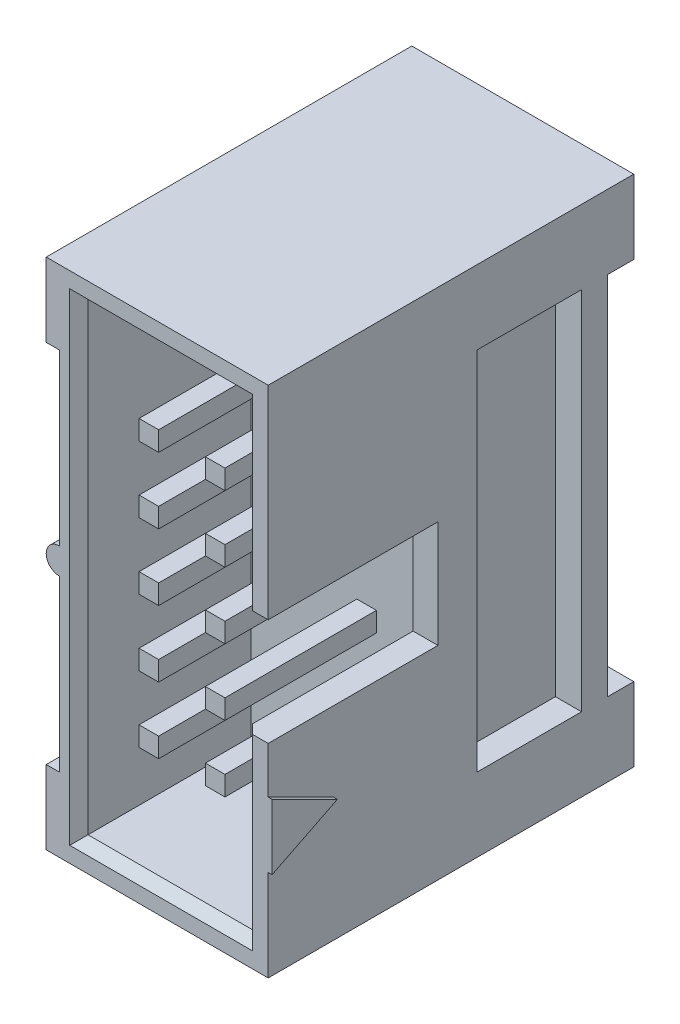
ISO-10303-21;
HEADER;
FILE_DESCRIPTION(('STEP AP214'),'2;1');
FILE_NAME('part.step','',(''),(''),'','','');
FILE_SCHEMA(('AUTOMOTIVE_DESIGN { 1 0 10303 214 1 1 1 1 }'));
ENDSEC;
DATA;
#1=APPLICATION_CONTEXT('core data for automotive mechanical design processes');
#2=APPLICATION_PROTOCOL_DEFINITION('international standard','automotive_design',2000,#1);
#3=PRODUCT_CONTEXT('',#1,'mechanical');
#4=PRODUCT('Part','Part','',(#3));
#5=PRODUCT_RELATED_PRODUCT_CATEGORY('part','',(#4));
#6=PRODUCT_DEFINITION_FORMATION('','',#4);
#7=PRODUCT_DEFINITION_CONTEXT('part definition',#1,'design');
#8=PRODUCT_DEFINITION('design','',#6,#7);
#9=PRODUCT_DEFINITION_SHAPE('','',#8);
#10=(LENGTH_UNIT() NAMED_UNIT(*) SI_UNIT(.MILLI.,.METRE.));
#11=(NAMED_UNIT(*) PLANE_ANGLE_UNIT() SI_UNIT($,.RADIAN.));
#12=(NAMED_UNIT(*) SI_UNIT($,.STERADIAN.) SOLID_ANGLE_UNIT());
#13=UNCERTAINTY_MEASURE_WITH_UNIT(LENGTH_MEASURE(1.E-05),#10,'distance_accuracy_value','');
#14=(GEOMETRIC_REPRESENTATION_CONTEXT(3) GLOBAL_UNCERTAINTY_ASSIGNED_CONTEXT((#13)) GLOBAL_UNIT_ASSIGNED_CONTEXT((#10,
#11,#12)) REPRESENTATION_CONTEXT('',''));
#15=CARTESIAN_POINT('',(0.,0.,0.));
#16=DIRECTION('',(0.,0.,1.));
#17=DIRECTION('',(1.,0.,0.));
#18=AXIS2_PLACEMENT_3D('',#15,#16,#17);
#19=CARTESIAN_POINT('',(3.23,-7.1656,0.5));
#20=DIRECTION('',(0.,0.,1.));
#21=DIRECTION('',(0.,1.,0.));
#22=AXIS2_PLACEMENT_3D('',#19,#20,#21);
#23=PLANE('',#22);
#24=DIRECTION('',(-1.,0.,0.));
#25=VECTOR('',#24,1.);
#26=CARTESIAN_POINT('',(-0.15,0.77,0.49999999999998));
#27=LINE('',#26,#25);
#28=CARTESIAN_POINT('',(3.1,0.770000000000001,0.499999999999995));
#29=VERTEX_POINT('',#28);
#30=CARTESIAN_POINT('',(-3.4,0.77,0.499999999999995));
#31=VERTEX_POINT('',#30);
#32=EDGE_CURVE('E2313',#29,#31,#27,.T.);
#33=ORIENTED_EDGE('',*,*,#32,.F.);
#34=DIRECTION('',(0.,1.,0.));
#35=VECTOR('',#34,1.);
#36=CARTESIAN_POINT('',(3.1,0.,0.5));
#37=LINE('',#36,#35);
#38=CARTESIAN_POINT('',(3.1,-0.769999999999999,0.5));
#39=VERTEX_POINT('',#38);
#40=EDGE_CURVE('E2317',#39,#29,#37,.T.);
#41=ORIENTED_EDGE('',*,*,#40,.F.);
#42=DIRECTION('',(1.,0.,0.));
#43=VECTOR('',#42,1.);
#44=CARTESIAN_POINT('',(-0.15,-0.77,0.5));
#45=LINE('',#44,#43);
#46=CARTESIAN_POINT('',(-3.4,-0.77,0.5));
#47=VERTEX_POINT('',#46);
#48=EDGE_CURVE('E3559',#47,#39,#45,.T.);
#49=ORIENTED_EDGE('',*,*,#48,.F.);
#50=DIRECTION('',(0.,-1.,0.));
#51=VECTOR('',#50,1.);
#52=CARTESIAN_POINT('',(-3.4,0.,0.5));
#53=LINE('',#52,#51);
#54=EDGE_CURVE('E2321',#31,#47,#53,.T.);
#55=ORIENTED_EDGE('',*,*,#54,.F.);
#56=EDGE_LOOP('',(#33,#41,#49,#55));
#57=FACE_BOUND('',#56,.T.);
#58=ADVANCED_FACE('F16',(#57),#23,.F.);
#59=CARTESIAN_POINT('',(-3.53,-0.77,-0.03242528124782));
#60=DIRECTION('',(0.,1.,0.));
#61=DIRECTION('',(0.,0.,1.));
#62=AXIS2_PLACEMENT_3D('',#59,#60,#61);
#63=PLANE('',#62);
#64=DIRECTION('',(1.,0.,0.));
#65=VECTOR('',#64,1.);
#66=CARTESIAN_POINT('',(-0.15,-0.770000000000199,0.));
#67=LINE('',#66,#65);
#68=CARTESIAN_POINT('',(-3.4,-0.770000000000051,0.));
#69=VERTEX_POINT('',#68);
#70=CARTESIAN_POINT('',(3.1,-0.770000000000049,0.));
#71=VERTEX_POINT('',#70);
#72=EDGE_CURVE('E2340',#69,#71,#67,.T.);
#73=ORIENTED_EDGE('',*,*,#72,.F.);
#74=DIRECTION('',(0.,0.,1.));
#75=VECTOR('',#74,1.);
#76=CARTESIAN_POINT('',(-3.4,-0.77,0.24999999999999));
#77=LINE('',#76,#75);
#78=EDGE_CURVE('E2327',#69,#47,#77,.T.);
#79=ORIENTED_EDGE('',*,*,#78,.T.);
#80=ORIENTED_EDGE('',*,*,#48,.T.);
#81=DIRECTION('',(0.,0.,-1.));
#82=VECTOR('',#81,1.);
#83=CARTESIAN_POINT('',(3.1,-0.77,0.24999999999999));
#84=LINE('',#83,#82);
#85=EDGE_CURVE('E2332',#39,#71,#84,.T.);
#86=ORIENTED_EDGE('',*,*,#85,.T.);
#87=EDGE_LOOP('',(#73,#79,#80,#86));
#88=FACE_BOUND('',#87,.T.);
#89=ADVANCED_FACE('F2291',(#88),#63,.T.);
#90=CARTESIAN_POINT('',(-3.53,0.77,0.5324252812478));
#91=DIRECTION('',(0.,-1.,0.));
#92=DIRECTION('',(0.,0.,-1.));
#93=AXIS2_PLACEMENT_3D('',#90,#91,#92);
#94=PLANE('',#93);
#95=DIRECTION('',(-1.,0.,0.));
#96=VECTOR('',#95,1.);
#97=CARTESIAN_POINT('',(-0.15,0.77000000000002,0.));
#98=LINE('',#97,#96);
#99=CARTESIAN_POINT('',(3.1,0.770000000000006,0.));
#100=VERTEX_POINT('',#99);
#101=CARTESIAN_POINT('',(-3.4,0.770000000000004,0.));
#102=VERTEX_POINT('',#101);
#103=EDGE_CURVE('E2346',#100,#102,#98,.T.);
#104=ORIENTED_EDGE('',*,*,#103,.F.);
#105=DIRECTION('',(0.,0.,1.));
#106=VECTOR('',#105,1.);
#107=CARTESIAN_POINT('',(3.1,0.77,0.24999999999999));
#108=LINE('',#107,#106);
#109=EDGE_CURVE('E2329',#100,#29,#108,.T.);
#110=ORIENTED_EDGE('',*,*,#109,.T.);
#111=ORIENTED_EDGE('',*,*,#32,.T.);
#112=DIRECTION('',(0.,0.,-1.));
#113=VECTOR('',#112,1.);
#114=CARTESIAN_POINT('',(-3.4,0.77,0.24999999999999));
#115=LINE('',#114,#113);
#116=EDGE_CURVE('E2326',#31,#102,#115,.T.);
#117=ORIENTED_EDGE('',*,*,#116,.T.);
#118=EDGE_LOOP('',(#104,#110,#111,#117));
#119=FACE_BOUND('',#118,.T.);
#120=ADVANCED_FACE('F2283',(#119),#94,.T.);
#121=CARTESIAN_POINT('',(-3.53,-1.802425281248,0.));
#122=DIRECTION('',(0.,0.,-1.));
#123=DIRECTION('',(0.,1.,0.));
#124=AXIS2_PLACEMENT_3D('',#121,#122,#123);
#125=PLANE('',#124);
#126=DIRECTION('',(0.,-1.,0.));
#127=VECTOR('',#126,1.);
#128=CARTESIAN_POINT('',(3.1,-1.2700000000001,0.));
#129=LINE('',#128,#127);
#130=CARTESIAN_POINT('',(3.1,-1.77000000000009,0.));
#131=VERTEX_POINT('',#130);
#132=EDGE_CURVE('E2336',#71,#131,#129,.T.);
#133=ORIENTED_EDGE('',*,*,#132,.T.);
#134=DIRECTION('',(1.,0.,0.));
#135=VECTOR('',#134,1.);
#136=CARTESIAN_POINT('',(-0.15,-1.77,0.));
#137=LINE('',#136,#135);
#138=CARTESIAN_POINT('',(-3.4,-1.77000000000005,0.));
#139=VERTEX_POINT('',#138);
#140=EDGE_CURVE('E2359',#139,#131,#137,.T.);
#141=ORIENTED_EDGE('',*,*,#140,.F.);
#142=DIRECTION('',(0.,1.,0.));
#143=VECTOR('',#142,1.);
#144=CARTESIAN_POINT('',(-3.4,-1.2700000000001,0.));
#145=LINE('',#144,#143);
#146=EDGE_CURVE('E2343',#139,#69,#145,.T.);
#147=ORIENTED_EDGE('',*,*,#146,.T.);
#148=ORIENTED_EDGE('',*,*,#72,.T.);
#149=EDGE_LOOP('',(#133,#141,#147,#148));
#150=FACE_BOUND('',#149,.T.);
#151=ADVANCED_FACE('F2275',(#150),#125,.T.);
#152=CARTESIAN_POINT('',(-3.53,0.7375747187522,0.));
#153=DIRECTION('',(0.,0.,-1.));
#154=DIRECTION('',(0.,1.,0.));
#155=AXIS2_PLACEMENT_3D('',#152,#153,#154);
#156=PLANE('',#155);
#157=DIRECTION('',(0.,-1.,0.));
#158=VECTOR('',#157,1.);
#159=CARTESIAN_POINT('',(3.1,1.2700000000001,0.));
#160=LINE('',#159,#158);
#161=CARTESIAN_POINT('',(3.1,1.77,0.));
#162=VERTEX_POINT('',#161);
#163=EDGE_CURVE('E2350',#162,#100,#160,.T.);
#164=ORIENTED_EDGE('',*,*,#163,.T.);
#165=ORIENTED_EDGE('',*,*,#103,.T.);
#166=DIRECTION('',(0.,1.,0.));
#167=VECTOR('',#166,1.);
#168=CARTESIAN_POINT('',(-3.4,1.2700000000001,0.));
#169=LINE('',#168,#167);
#170=CARTESIAN_POINT('',(-3.4,1.77,0.));
#171=VERTEX_POINT('',#170);
#172=EDGE_CURVE('E2339',#102,#171,#169,.T.);
#173=ORIENTED_EDGE('',*,*,#172,.T.);
#174=DIRECTION('',(-1.,0.,0.));
#175=VECTOR('',#174,1.);
#176=CARTESIAN_POINT('',(-0.15,1.77,0.));
#177=LINE('',#176,#175);
#178=EDGE_CURVE('E2368',#162,#171,#177,.T.);
#179=ORIENTED_EDGE('',*,*,#178,.F.);
#180=EDGE_LOOP('',(#164,#165,#173,#179));
#181=FACE_BOUND('',#180,.T.);
#182=ADVANCED_FACE('F2267',(#181),#156,.T.);
#183=CARTESIAN_POINT('',(-3.53,-1.77,0.5324252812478));
#184=DIRECTION('',(0.,-1.,0.));
#185=DIRECTION('',(0.,0.,-1.));
#186=AXIS2_PLACEMENT_3D('',#183,#184,#185);
#187=PLANE('',#186);
#188=ORIENTED_EDGE('',*,*,#140,.T.);
#189=DIRECTION('',(0.,0.,1.));
#190=VECTOR('',#189,1.);
#191=CARTESIAN_POINT('',(3.1,-1.77,0.24999999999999));
#192=LINE('',#191,#190);
#193=CARTESIAN_POINT('',(3.1,-1.77,0.499999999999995));
#194=VERTEX_POINT('',#193);
#195=EDGE_CURVE('E2355',#131,#194,#192,.T.);
#196=ORIENTED_EDGE('',*,*,#195,.T.);
#197=DIRECTION('',(-1.,0.,0.));
#198=VECTOR('',#197,1.);
#199=CARTESIAN_POINT('',(-0.15,-1.77,0.5));
#200=LINE('',#199,#198);
#201=CARTESIAN_POINT('',(-3.4,-1.77,0.49999999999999));
#202=VERTEX_POINT('',#201);
#203=EDGE_CURVE('E2377',#194,#202,#200,.T.);
#204=ORIENTED_EDGE('',*,*,#203,.T.);
#205=DIRECTION('',(0.,0.,-1.));
#206=VECTOR('',#205,1.);
#207=CARTESIAN_POINT('',(-3.4,-1.77,0.24999999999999));
#208=LINE('',#207,#206);
#209=EDGE_CURVE('E2349',#202,#139,#208,.T.);
#210=ORIENTED_EDGE('',*,*,#209,.T.);
#211=EDGE_LOOP('',(#188,#196,#204,#210));
#212=FACE_BOUND('',#211,.T.);
#213=ADVANCED_FACE('F2259',(#212),#187,.T.);
#214=CARTESIAN_POINT('',(-3.53,1.77,-0.03242528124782));
#215=DIRECTION('',(0.,1.,0.));
#216=DIRECTION('',(0.,0.,1.));
#217=AXIS2_PLACEMENT_3D('',#214,#215,#216);
#218=PLANE('',#217);
#219=ORIENTED_EDGE('',*,*,#178,.T.);
#220=DIRECTION('',(0.,0.,1.));
#221=VECTOR('',#220,1.);
#222=CARTESIAN_POINT('',(-3.4,1.77,0.24999999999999));
#223=LINE('',#222,#221);
#224=CARTESIAN_POINT('',(-3.4,1.77,0.5));
#225=VERTEX_POINT('',#224);
#226=EDGE_CURVE('E2364',#171,#225,#223,.T.);
#227=ORIENTED_EDGE('',*,*,#226,.T.);
#228=DIRECTION('',(1.,0.,0.));
#229=VECTOR('',#228,1.);
#230=CARTESIAN_POINT('',(-0.15,1.77,0.5));
#231=LINE('',#230,#229);
#232=CARTESIAN_POINT('',(3.1,1.77,0.5));
#233=VERTEX_POINT('',#232);
#234=EDGE_CURVE('E2376',#225,#233,#231,.T.);
#235=ORIENTED_EDGE('',*,*,#234,.T.);
#236=DIRECTION('',(0.,0.,-1.));
#237=VECTOR('',#236,1.);
#238=CARTESIAN_POINT('',(3.1,1.77,0.24999999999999));
#239=LINE('',#238,#237);
#240=EDGE_CURVE('E2358',#233,#162,#239,.T.);
#241=ORIENTED_EDGE('',*,*,#240,.T.);
#242=EDGE_LOOP('',(#219,#227,#235,#241));
#243=FACE_BOUND('',#242,.T.);
#244=ADVANCED_FACE('F2251',(#243),#218,.T.);
#245=CARTESIAN_POINT('',(3.23,-7.1656,0.5));
#246=DIRECTION('',(0.,0.,1.));
#247=DIRECTION('',(0.,1.,0.));
#248=AXIS2_PLACEMENT_3D('',#245,#246,#247);
#249=PLANE('',#248);
#250=ORIENTED_EDGE('',*,*,#203,.F.);
#251=DIRECTION('',(0.,1.,0.));
#252=VECTOR('',#251,1.);
#253=CARTESIAN_POINT('',(3.1,0.,0.5));
#254=LINE('',#253,#252);
#255=CARTESIAN_POINT('',(3.1,-3.31,0.5));
#256=VERTEX_POINT('',#255);
#257=EDGE_CURVE('E2367',#256,#194,#254,.T.);
#258=ORIENTED_EDGE('',*,*,#257,.F.);
#259=DIRECTION('',(1.,0.,0.));
#260=VECTOR('',#259,1.);
#261=CARTESIAN_POINT('',(-0.15,-3.31,0.5));
#262=LINE('',#261,#260);
#263=CARTESIAN_POINT('',(-3.4,-3.31,0.5));
#264=VERTEX_POINT('',#263);
#265=EDGE_CURVE('E2385',#264,#256,#262,.T.);
#266=ORIENTED_EDGE('',*,*,#265,.F.);
#267=DIRECTION('',(0.,-1.,0.));
#268=VECTOR('',#267,1.);
#269=CARTESIAN_POINT('',(-3.4,0.,0.5));
#270=LINE('',#269,#268);
#271=EDGE_CURVE('E2373',#202,#264,#270,.T.);
#272=ORIENTED_EDGE('',*,*,#271,.F.);
#273=EDGE_LOOP('',(#250,#258,#266,#272));
#274=FACE_BOUND('',#273,.T.);
#275=ADVANCED_FACE('F2243',(#274),#249,.F.);
#276=CARTESIAN_POINT('',(3.23,-7.1656,0.5));
#277=DIRECTION('',(0.,0.,1.));
#278=DIRECTION('',(0.,1.,0.));
#279=AXIS2_PLACEMENT_3D('',#276,#277,#278);
#280=PLANE('',#279);
#281=DIRECTION('',(-1.,0.,0.));
#282=VECTOR('',#281,1.);
#283=CARTESIAN_POINT('',(-0.15,3.31,0.49999999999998));
#284=LINE('',#283,#282);
#285=CARTESIAN_POINT('',(3.1,3.31,0.499999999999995));
#286=VERTEX_POINT('',#285);
#287=CARTESIAN_POINT('',(-3.4,3.31,0.499999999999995));
#288=VERTEX_POINT('',#287);
#289=EDGE_CURVE('E2394',#286,#288,#284,.T.);
#290=ORIENTED_EDGE('',*,*,#289,.F.);
#291=DIRECTION('',(0.,1.,0.));
#292=VECTOR('',#291,1.);
#293=CARTESIAN_POINT('',(3.1,0.,0.5));
#294=LINE('',#293,#292);
#295=EDGE_CURVE('E2386',#233,#286,#294,.T.);
#296=ORIENTED_EDGE('',*,*,#295,.F.);
#297=ORIENTED_EDGE('',*,*,#234,.F.);
#298=DIRECTION('',(0.,-1.,0.));
#299=VECTOR('',#298,1.);
#300=CARTESIAN_POINT('',(-3.4,0.,0.5));
#301=LINE('',#300,#299);
#302=EDGE_CURVE('E2382',#288,#225,#301,.T.);
#303=ORIENTED_EDGE('',*,*,#302,.F.);
#304=EDGE_LOOP('',(#290,#296,#297,#303));
#305=FACE_BOUND('',#304,.T.);
#306=ADVANCED_FACE('F2235',(#305),#280,.F.);
#307=CARTESIAN_POINT('',(-3.53,-3.31,-0.03242528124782));
#308=DIRECTION('',(0.,1.,0.));
#309=DIRECTION('',(0.,0.,1.));
#310=AXIS2_PLACEMENT_3D('',#307,#308,#309);
#311=PLANE('',#310);
#312=DIRECTION('',(1.,0.,0.));
#313=VECTOR('',#312,1.);
#314=CARTESIAN_POINT('',(-0.15,-3.31000000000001,0.));
#315=LINE('',#314,#313);
#316=CARTESIAN_POINT('',(-3.4,-3.31,0.));
#317=VERTEX_POINT('',#316);
#318=CARTESIAN_POINT('',(3.1,-3.31,0.));
#319=VERTEX_POINT('',#318);
#320=EDGE_CURVE('E2413',#317,#319,#315,.T.);
#321=ORIENTED_EDGE('',*,*,#320,.F.);
#322=DIRECTION('',(0.,0.,1.));
#323=VECTOR('',#322,1.);
#324=CARTESIAN_POINT('',(-3.4,-3.31,0.24999999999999));
#325=LINE('',#324,#323);
#326=EDGE_CURVE('E2391',#317,#264,#325,.T.);
#327=ORIENTED_EDGE('',*,*,#326,.T.);
#328=ORIENTED_EDGE('',*,*,#265,.T.);
#329=DIRECTION('',(0.,0.,-1.));
#330=VECTOR('',#329,1.);
#331=CARTESIAN_POINT('',(3.1,-3.31,0.24999999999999));
#332=LINE('',#331,#330);
#333=EDGE_CURVE('E2395',#256,#319,#332,.T.);
#334=ORIENTED_EDGE('',*,*,#333,.T.);
#335=EDGE_LOOP('',(#321,#327,#328,#334));
#336=FACE_BOUND('',#335,.T.);
#337=ADVANCED_FACE('F2227',(#336),#311,.T.);
#338=CARTESIAN_POINT('',(-3.53,3.31,0.5324252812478));
#339=DIRECTION('',(0.,-1.,0.));
#340=DIRECTION('',(0.,0.,-1.));
#341=AXIS2_PLACEMENT_3D('',#338,#339,#340);
#342=PLANE('',#341);
#343=DIRECTION('',(-1.,0.,0.));
#344=VECTOR('',#343,1.);
#345=CARTESIAN_POINT('',(-0.15,3.30999999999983,0.));
#346=LINE('',#345,#344);
#347=CARTESIAN_POINT('',(3.1,3.30999999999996,0.));
#348=VERTEX_POINT('',#347);
#349=CARTESIAN_POINT('',(-3.4,3.30999999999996,0.));
#350=VERTEX_POINT('',#349);
#351=EDGE_CURVE('E2418',#348,#350,#346,.T.);
#352=ORIENTED_EDGE('',*,*,#351,.F.);
#353=DIRECTION('',(0.,0.,1.));
#354=VECTOR('',#353,1.);
#355=CARTESIAN_POINT('',(3.1,3.31,0.24999999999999));
#356=LINE('',#355,#354);
#357=EDGE_CURVE('E2400',#348,#286,#356,.T.);
#358=ORIENTED_EDGE('',*,*,#357,.T.);
#359=ORIENTED_EDGE('',*,*,#289,.T.);
#360=DIRECTION('',(0.,0.,-1.));
#361=VECTOR('',#360,1.);
#362=CARTESIAN_POINT('',(-3.4,3.31,0.24999999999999));
#363=LINE('',#362,#361);
#364=EDGE_CURVE('E2404',#288,#350,#363,.T.);
#365=ORIENTED_EDGE('',*,*,#364,.T.);
#366=EDGE_LOOP('',(#352,#358,#359,#365));
#367=FACE_BOUND('',#366,.T.);
#368=ADVANCED_FACE('F2219',(#367),#342,.T.);
#369=CARTESIAN_POINT('',(-3.53,-4.342425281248,0.));
#370=DIRECTION('',(0.,0.,-1.));
#371=DIRECTION('',(0.,1.,0.));
#372=AXIS2_PLACEMENT_3D('',#369,#370,#371);
#373=PLANE('',#372);
#374=DIRECTION('',(0.,-1.,0.));
#375=VECTOR('',#374,1.);
#376=CARTESIAN_POINT('',(3.1,-3.81,0.));
#377=LINE('',#376,#375);
#378=CARTESIAN_POINT('',(3.1,-4.31000000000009,0.));
#379=VERTEX_POINT('',#378);
#380=EDGE_CURVE('E2409',#319,#379,#377,.T.);
#381=ORIENTED_EDGE('',*,*,#380,.T.);
#382=DIRECTION('',(1.,0.,0.));
#383=VECTOR('',#382,1.);
#384=CARTESIAN_POINT('',(-0.15,-4.31,0.));
#385=LINE('',#384,#383);
#386=CARTESIAN_POINT('',(-3.4,-4.31000000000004,0.));
#387=VERTEX_POINT('',#386);
#388=EDGE_CURVE('E2431',#387,#379,#385,.T.);
#389=ORIENTED_EDGE('',*,*,#388,.F.);
#390=DIRECTION('',(0.,1.,0.));
#391=VECTOR('',#390,1.);
#392=CARTESIAN_POINT('',(-3.4,-3.81,0.));
#393=LINE('',#392,#391);
#394=EDGE_CURVE('E2403',#387,#317,#393,.T.);
#395=ORIENTED_EDGE('',*,*,#394,.T.);
#396=ORIENTED_EDGE('',*,*,#320,.T.);
#397=EDGE_LOOP('',(#381,#389,#395,#396));
#398=FACE_BOUND('',#397,.T.);
#399=ADVANCED_FACE('F2211',(#398),#373,.T.);
#400=CARTESIAN_POINT('',(-3.53,3.277574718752,0.));
#401=DIRECTION('',(0.,0.,-1.));
#402=DIRECTION('',(0.,1.,0.));
#403=AXIS2_PLACEMENT_3D('',#400,#401,#402);
#404=PLANE('',#403);
#405=DIRECTION('',(0.,-1.,0.));
#406=VECTOR('',#405,1.);
#407=CARTESIAN_POINT('',(3.1,3.81,0.));
#408=LINE('',#407,#406);
#409=CARTESIAN_POINT('',(3.1,4.31,0.));
#410=VERTEX_POINT('',#409);
#411=EDGE_CURVE('E2422',#410,#348,#408,.T.);
#412=ORIENTED_EDGE('',*,*,#411,.T.);
#413=ORIENTED_EDGE('',*,*,#351,.T.);
#414=DIRECTION('',(0.,1.,0.));
#415=VECTOR('',#414,1.);
#416=CARTESIAN_POINT('',(-3.4,3.81,0.));
#417=LINE('',#416,#415);
#418=CARTESIAN_POINT('',(-3.4,4.31,0.));
#419=VERTEX_POINT('',#418);
#420=EDGE_CURVE('E2412',#350,#419,#417,.T.);
#421=ORIENTED_EDGE('',*,*,#420,.T.);
#422=DIRECTION('',(-1.,0.,0.));
#423=VECTOR('',#422,1.);
#424=CARTESIAN_POINT('',(-0.15,4.31,0.));
#425=LINE('',#424,#423);
#426=EDGE_CURVE('E2440',#410,#419,#425,.T.);
#427=ORIENTED_EDGE('',*,*,#426,.F.);
#428=EDGE_LOOP('',(#412,#413,#421,#427));
#429=FACE_BOUND('',#428,.T.);
#430=ADVANCED_FACE('F2203',(#429),#404,.T.);
#431=CARTESIAN_POINT('',(-3.53,-4.31,0.5324252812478));
#432=DIRECTION('',(0.,-1.,0.));
#433=DIRECTION('',(0.,0.,-1.));
#434=AXIS2_PLACEMENT_3D('',#431,#432,#433);
#435=PLANE('',#434);
#436=ORIENTED_EDGE('',*,*,#388,.T.);
#437=DIRECTION('',(0.,0.,1.));
#438=VECTOR('',#437,1.);
#439=CARTESIAN_POINT('',(3.1,-4.31,0.24999999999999));
#440=LINE('',#439,#438);
#441=CARTESIAN_POINT('',(3.1,-4.31,0.499999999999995));
#442=VERTEX_POINT('',#441);
#443=EDGE_CURVE('E2427',#379,#442,#440,.T.);
#444=ORIENTED_EDGE('',*,*,#443,.T.);
#445=DIRECTION('',(-1.,0.,0.));
#446=VECTOR('',#445,1.);
#447=CARTESIAN_POINT('',(-0.15,-4.31,0.5));
#448=LINE('',#447,#446);
#449=CARTESIAN_POINT('',(-3.4,-4.31,0.49999999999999));
#450=VERTEX_POINT('',#449);
#451=EDGE_CURVE('E2449',#442,#450,#448,.T.);
#452=ORIENTED_EDGE('',*,*,#451,.T.);
#453=DIRECTION('',(0.,0.,-1.));
#454=VECTOR('',#453,1.);
#455=CARTESIAN_POINT('',(-3.4,-4.31,0.24999999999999));
#456=LINE('',#455,#454);
#457=EDGE_CURVE('E2421',#450,#387,#456,.T.);
#458=ORIENTED_EDGE('',*,*,#457,.T.);
#459=EDGE_LOOP('',(#436,#444,#452,#458));
#460=FACE_BOUND('',#459,.T.);
#461=ADVANCED_FACE('F2195',(#460),#435,.T.);
#462=CARTESIAN_POINT('',(-3.53,4.31,-0.03242528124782));
#463=DIRECTION('',(0.,1.,0.));
#464=DIRECTION('',(0.,0.,1.));
#465=AXIS2_PLACEMENT_3D('',#462,#463,#464);
#466=PLANE('',#465);
#467=ORIENTED_EDGE('',*,*,#426,.T.);
#468=DIRECTION('',(0.,0.,1.));
#469=VECTOR('',#468,1.);
#470=CARTESIAN_POINT('',(-3.4,4.31,0.24999999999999));
#471=LINE('',#470,#469);
#472=CARTESIAN_POINT('',(-3.4,4.31,0.5));
#473=VERTEX_POINT('',#472);
#474=EDGE_CURVE('E2436',#419,#473,#471,.T.);
#475=ORIENTED_EDGE('',*,*,#474,.T.);
#476=DIRECTION('',(1.,0.,0.));
#477=VECTOR('',#476,1.);
#478=CARTESIAN_POINT('',(-0.15,4.31,0.5));
#479=LINE('',#478,#477);
#480=CARTESIAN_POINT('',(3.1,4.31,0.5));
#481=VERTEX_POINT('',#480);
#482=EDGE_CURVE('E2448',#473,#481,#479,.T.);
#483=ORIENTED_EDGE('',*,*,#482,.T.);
#484=DIRECTION('',(0.,0.,-1.));
#485=VECTOR('',#484,1.);
#486=CARTESIAN_POINT('',(3.1,4.31,0.24999999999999));
#487=LINE('',#486,#485);
#488=EDGE_CURVE('E2430',#481,#410,#487,.T.);
#489=ORIENTED_EDGE('',*,*,#488,.T.);
#490=EDGE_LOOP('',(#467,#475,#483,#489));
#491=FACE_BOUND('',#490,.T.);
#492=ADVANCED_FACE('F2187',(#491),#466,.T.);
#493=CARTESIAN_POINT('',(3.23,-7.1656,0.5));
#494=DIRECTION('',(0.,0.,1.));
#495=DIRECTION('',(0.,1.,0.));
#496=AXIS2_PLACEMENT_3D('',#493,#494,#495);
#497=PLANE('',#496);
#498=ORIENTED_EDGE('',*,*,#451,.F.);
#499=DIRECTION('',(0.,1.,0.));
#500=VECTOR('',#499,1.);
#501=CARTESIAN_POINT('',(3.1,0.,0.5));
#502=LINE('',#501,#500);
#503=CARTESIAN_POINT('',(3.1,-5.85,0.5));
#504=VERTEX_POINT('',#503);
#505=EDGE_CURVE('E2439',#504,#442,#502,.T.);
#506=ORIENTED_EDGE('',*,*,#505,.F.);
#507=DIRECTION('',(1.,0.,0.));
#508=VECTOR('',#507,1.);
#509=CARTESIAN_POINT('',(-0.15,-5.85,0.5));
#510=LINE('',#509,#508);
#511=CARTESIAN_POINT('',(-3.4,-5.85,0.5));
#512=VERTEX_POINT('',#511);
#513=EDGE_CURVE('E2457',#512,#504,#510,.T.);
#514=ORIENTED_EDGE('',*,*,#513,.F.);
#515=DIRECTION('',(0.,-1.,0.));
#516=VECTOR('',#515,1.);
#517=CARTESIAN_POINT('',(-3.4,0.,0.5));
#518=LINE('',#517,#516);
#519=EDGE_CURVE('E2445',#450,#512,#518,.T.);
#520=ORIENTED_EDGE('',*,*,#519,.F.);
#521=EDGE_LOOP('',(#498,#506,#514,#520));
#522=FACE_BOUND('',#521,.T.);
#523=ADVANCED_FACE('F2179',(#522),#497,.F.);
#524=CARTESIAN_POINT('',(3.23,-7.1656,0.5));
#525=DIRECTION('',(0.,0.,1.));
#526=DIRECTION('',(0.,1.,0.));
#527=AXIS2_PLACEMENT_3D('',#524,#525,#526);
#528=PLANE('',#527);
#529=DIRECTION('',(-1.,0.,0.));
#530=VECTOR('',#529,1.);
#531=CARTESIAN_POINT('',(-0.15,5.85,0.49999999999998));
#532=LINE('',#531,#530);
#533=CARTESIAN_POINT('',(3.1,5.85,0.499999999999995));
#534=VERTEX_POINT('',#533);
#535=CARTESIAN_POINT('',(-3.4,5.85,0.499999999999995));
#536=VERTEX_POINT('',#535);
#537=EDGE_CURVE('E2466',#534,#536,#532,.T.);
#538=ORIENTED_EDGE('',*,*,#537,.F.);
#539=DIRECTION('',(0.,1.,0.));
#540=VECTOR('',#539,1.);
#541=CARTESIAN_POINT('',(3.1,0.,0.5));
#542=LINE('',#541,#540);
#543=EDGE_CURVE('E2458',#481,#534,#542,.T.);
#544=ORIENTED_EDGE('',*,*,#543,.F.);
#545=ORIENTED_EDGE('',*,*,#482,.F.);
#546=DIRECTION('',(0.,-1.,0.));
#547=VECTOR('',#546,1.);
#548=CARTESIAN_POINT('',(-3.4,0.,0.5));
#549=LINE('',#548,#547);
#550=EDGE_CURVE('E2454',#536,#473,#549,.T.);
#551=ORIENTED_EDGE('',*,*,#550,.F.);
#552=EDGE_LOOP('',(#538,#544,#545,#551));
#553=FACE_BOUND('',#552,.T.);
#554=ADVANCED_FACE('F2171',(#553),#528,.F.);
#555=CARTESIAN_POINT('',(-3.53,-5.85,-0.03242528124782));
#556=DIRECTION('',(0.,1.,0.));
#557=DIRECTION('',(0.,0.,1.));
#558=AXIS2_PLACEMENT_3D('',#555,#556,#557);
#559=PLANE('',#558);
#560=DIRECTION('',(1.,0.,0.));
#561=VECTOR('',#560,1.);
#562=CARTESIAN_POINT('',(-0.15,-5.85,0.));
#563=LINE('',#562,#561);
#564=CARTESIAN_POINT('',(-3.4,-5.85,0.));
#565=VERTEX_POINT('',#564);
#566=CARTESIAN_POINT('',(3.1,-5.85,0.));
#567=VERTEX_POINT('',#566);
#568=EDGE_CURVE('E2545',#565,#567,#563,.T.);
#569=ORIENTED_EDGE('',*,*,#568,.F.);
#570=DIRECTION('',(0.,0.,1.));
#571=VECTOR('',#570,1.);
#572=CARTESIAN_POINT('',(-3.4,-5.85,0.24999999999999));
#573=LINE('',#572,#571);
#574=EDGE_CURVE('E2463',#565,#512,#573,.T.);
#575=ORIENTED_EDGE('',*,*,#574,.T.);
#576=ORIENTED_EDGE('',*,*,#513,.T.);
#577=DIRECTION('',(0.,0.,-1.));
#578=VECTOR('',#577,1.);
#579=CARTESIAN_POINT('',(3.1,-5.85,0.24999999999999));
#580=LINE('',#579,#578);
#581=EDGE_CURVE('E2467',#504,#567,#580,.T.);
#582=ORIENTED_EDGE('',*,*,#581,.T.);
#583=EDGE_LOOP('',(#569,#575,#576,#582));
#584=FACE_BOUND('',#583,.T.);
#585=ADVANCED_FACE('F2163',(#584),#559,.T.);
#586=CARTESIAN_POINT('',(-3.53,5.85,0.5324252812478));
#587=DIRECTION('',(0.,-1.,0.));
#588=DIRECTION('',(0.,0.,-1.));
#589=AXIS2_PLACEMENT_3D('',#586,#587,#588);
#590=PLANE('',#589);
#591=DIRECTION('',(-1.,0.,0.));
#592=VECTOR('',#591,1.);
#593=CARTESIAN_POINT('',(-0.15,5.84999999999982,0.));
#594=LINE('',#593,#592);
#595=CARTESIAN_POINT('',(3.1,5.84999999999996,0.));
#596=VERTEX_POINT('',#595);
#597=CARTESIAN_POINT('',(-3.4,5.84999999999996,0.));
#598=VERTEX_POINT('',#597);
#599=EDGE_CURVE('E2550',#596,#598,#594,.T.);
#600=ORIENTED_EDGE('',*,*,#599,.F.);
#601=DIRECTION('',(0.,0.,1.));
#602=VECTOR('',#601,1.);
#603=CARTESIAN_POINT('',(3.1,5.85,0.24999999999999));
#604=LINE('',#603,#602);
#605=EDGE_CURVE('E2472',#596,#534,#604,.T.);
#606=ORIENTED_EDGE('',*,*,#605,.T.);
#607=ORIENTED_EDGE('',*,*,#537,.T.);
#608=DIRECTION('',(0.,0.,-1.));
#609=VECTOR('',#608,1.);
#610=CARTESIAN_POINT('',(-3.4,5.85,0.24999999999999));
#611=LINE('',#610,#609);
#612=EDGE_CURVE('E2476',#536,#598,#611,.T.);
#613=ORIENTED_EDGE('',*,*,#612,.T.);
#614=EDGE_LOOP('',(#600,#606,#607,#613));
#615=FACE_BOUND('',#614,.T.);
#616=ADVANCED_FACE('F2155',(#615),#590,.T.);
#617=CARTESIAN_POINT('',(-8.0909,-4.705,0.3735));
#618=DIRECTION('',(0.,1.,0.));
#619=DIRECTION('',(0.,0.,1.));
#620=AXIS2_PLACEMENT_3D('',#617,#618,#619);
#621=PLANE('',#620);
#622=DIRECTION('',(0.,0.,1.));
#623=VECTOR('',#622,1.);
#624=CARTESIAN_POINT('',(1.645,-4.70499999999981,10.3));
#625=LINE('',#624,#623);
#626=CARTESIAN_POINT('',(1.645,-4.70499999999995,7.4));
#627=VERTEX_POINT('',#626);
#628=CARTESIAN_POINT('',(1.645,-4.70499999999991,13.2));
#629=VERTEX_POINT('',#628);
#630=EDGE_CURVE('E2562',#627,#629,#625,.T.);
#631=ORIENTED_EDGE('',*,*,#630,.F.);
#632=DIRECTION('',(-1.,0.,0.));
#633=VECTOR('',#632,1.);
#634=CARTESIAN_POINT('',(-3.1275,-4.705,7.4));
#635=LINE('',#634,#633);
#636=CARTESIAN_POINT('',(0.895,-4.70499999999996,7.4));
#637=VERTEX_POINT('',#636);
#638=EDGE_CURVE('E2481',#627,#637,#635,.T.);
#639=ORIENTED_EDGE('',*,*,#638,.T.);
#640=DIRECTION('',(0.,0.,-1.));
#641=VECTOR('',#640,1.);
#642=CARTESIAN_POINT('',(0.895,-4.70499999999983,10.3));
#643=LINE('',#642,#641);
#644=CARTESIAN_POINT('',(0.895,-4.70499999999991,13.2));
#645=VERTEX_POINT('',#644);
#646=EDGE_CURVE('E2558',#645,#637,#643,.T.);
#647=ORIENTED_EDGE('',*,*,#646,.F.);
#648=DIRECTION('',(1.,0.,0.));
#649=VECTOR('',#648,1.);
#650=CARTESIAN_POINT('',(-3.1275,-4.705,13.2));
#651=LINE('',#650,#649);
#652=EDGE_CURVE('E2475',#645,#629,#651,.T.);
#653=ORIENTED_EDGE('',*,*,#652,.T.);
#654=EDGE_LOOP('',(#631,#639,#647,#653));
#655=FACE_BOUND('',#654,.T.);
#656=ADVANCED_FACE('F2147',(#655),#621,.T.);
#657=CARTESIAN_POINT('',(-8.0401,-4.705,2.9643));
#658=DIRECTION('',(0.,1.,0.));
#659=DIRECTION('',(0.,0.,1.));
#660=AXIS2_PLACEMENT_3D('',#657,#658,#659);
#661=PLANE('',#660);
#662=DIRECTION('',(0.,0.,1.));
#663=VECTOR('',#662,1.);
#664=CARTESIAN_POINT('',(-0.895,-4.70499999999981,10.3));
#665=LINE('',#664,#663);
#666=CARTESIAN_POINT('',(-0.895,-4.70499999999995,7.4));
#667=VERTEX_POINT('',#666);
#668=CARTESIAN_POINT('',(-0.895,-4.70499999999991,13.2));
#669=VERTEX_POINT('',#668);
#670=EDGE_CURVE('E2578',#667,#669,#665,.T.);
#671=ORIENTED_EDGE('',*,*,#670,.F.);
#672=DIRECTION('',(-1.,0.,0.));
#673=VECTOR('',#672,1.);
#674=CARTESIAN_POINT('',(-4.3975,-4.705,7.4));
#675=LINE('',#674,#673);
#676=CARTESIAN_POINT('',(-1.645,-4.70499999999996,7.4));
#677=VERTEX_POINT('',#676);
#678=EDGE_CURVE('E2487',#667,#677,#675,.T.);
#679=ORIENTED_EDGE('',*,*,#678,.T.);
#680=DIRECTION('',(0.,0.,-1.));
#681=VECTOR('',#680,1.);
#682=CARTESIAN_POINT('',(-1.645,-4.70499999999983,10.3));
#683=LINE('',#682,#681);
#684=CARTESIAN_POINT('',(-1.645,-4.70499999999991,13.2));
#685=VERTEX_POINT('',#684);
#686=EDGE_CURVE('E2573',#685,#677,#683,.T.);
#687=ORIENTED_EDGE('',*,*,#686,.F.);
#688=DIRECTION('',(1.,0.,0.));
#689=VECTOR('',#688,1.);
#690=CARTESIAN_POINT('',(-4.3975,-4.705,13.2));
#691=LINE('',#690,#689);
#692=EDGE_CURVE('E2484',#685,#669,#691,.T.);
#693=ORIENTED_EDGE('',*,*,#692,.T.);
#694=EDGE_LOOP('',(#671,#679,#687,#693));
#695=FACE_BOUND('',#694,.T.);
#696=ADVANCED_FACE('F2139',(#695),#661,.T.);
#697=CARTESIAN_POINT('',(-8.0909,-2.165,0.3735));
#698=DIRECTION('',(0.,1.,0.));
#699=DIRECTION('',(0.,0.,1.));
#700=AXIS2_PLACEMENT_3D('',#697,#698,#699);
#701=PLANE('',#700);
#702=DIRECTION('',(0.,0.,1.));
#703=VECTOR('',#702,1.);
#704=CARTESIAN_POINT('',(1.645,-2.16499999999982,10.3));
#705=LINE('',#704,#703);
#706=CARTESIAN_POINT('',(1.645,-2.16499999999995,7.4));
#707=VERTEX_POINT('',#706);
#708=CARTESIAN_POINT('',(1.645,-2.16499999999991,13.2));
#709=VERTEX_POINT('',#708);
#710=EDGE_CURVE('E2596',#707,#709,#705,.T.);
#711=ORIENTED_EDGE('',*,*,#710,.F.);
#712=DIRECTION('',(-1.,0.,0.));
#713=VECTOR('',#712,1.);
#714=CARTESIAN_POINT('',(-3.1275,-2.165,7.4));
#715=LINE('',#714,#713);
#716=CARTESIAN_POINT('',(0.895,-2.16499999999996,7.4));
#717=VERTEX_POINT('',#716);
#718=EDGE_CURVE('E2493',#707,#717,#715,.T.);
#719=ORIENTED_EDGE('',*,*,#718,.T.);
#720=DIRECTION('',(0.,0.,-1.));
#721=VECTOR('',#720,1.);
#722=CARTESIAN_POINT('',(0.895,-2.16499999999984,10.3));
#723=LINE('',#722,#721);
#724=CARTESIAN_POINT('',(0.895,-2.16499999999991,13.2));
#725=VERTEX_POINT('',#724);
#726=EDGE_CURVE('E2590',#725,#717,#723,.T.);
#727=ORIENTED_EDGE('',*,*,#726,.F.);
#728=DIRECTION('',(1.,0.,0.));
#729=VECTOR('',#728,1.);
#730=CARTESIAN_POINT('',(-3.1275,-2.165,13.2));
#731=LINE('',#730,#729);
#732=EDGE_CURVE('E2490',#725,#709,#731,.T.);
#733=ORIENTED_EDGE('',*,*,#732,.T.);
#734=EDGE_LOOP('',(#711,#719,#727,#733));
#735=FACE_BOUND('',#734,.T.);
#736=ADVANCED_FACE('F2131',(#735),#701,.T.);
#737=CARTESIAN_POINT('',(-8.0401,-2.165,2.9643));
#738=DIRECTION('',(0.,1.,0.));
#739=DIRECTION('',(0.,0.,1.));
#740=AXIS2_PLACEMENT_3D('',#737,#738,#739);
#741=PLANE('',#740);
#742=DIRECTION('',(0.,0.,1.));
#743=VECTOR('',#742,1.);
#744=CARTESIAN_POINT('',(-0.895,-2.16499999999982,10.3));
#745=LINE('',#744,#743);
#746=CARTESIAN_POINT('',(-0.895,-2.16499999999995,7.4));
#747=VERTEX_POINT('',#746);
#748=CARTESIAN_POINT('',(-0.895,-2.16499999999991,13.2));
#749=VERTEX_POINT('',#748);
#750=EDGE_CURVE('E2614',#747,#749,#745,.T.);
#751=ORIENTED_EDGE('',*,*,#750,.F.);
#752=DIRECTION('',(-1.,0.,0.));
#753=VECTOR('',#752,1.);
#754=CARTESIAN_POINT('',(-4.3975,-2.165,7.4));
#755=LINE('',#754,#753);
#756=CARTESIAN_POINT('',(-1.645,-2.16499999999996,7.4));
#757=VERTEX_POINT('',#756);
#758=EDGE_CURVE('E2499',#747,#757,#755,.T.);
#759=ORIENTED_EDGE('',*,*,#758,.T.);
#760=DIRECTION('',(0.,0.,-1.));
#761=VECTOR('',#760,1.);
#762=CARTESIAN_POINT('',(-1.645,-2.16499999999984,10.3));
#763=LINE('',#762,#761);
#764=CARTESIAN_POINT('',(-1.645,-2.16499999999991,13.2));
#765=VERTEX_POINT('',#764);
#766=EDGE_CURVE('E2608',#765,#757,#763,.T.);
#767=ORIENTED_EDGE('',*,*,#766,.F.);
#768=DIRECTION('',(1.,0.,0.));
#769=VECTOR('',#768,1.);
#770=CARTESIAN_POINT('',(-4.3975,-2.165,13.2));
#771=LINE('',#770,#769);
#772=EDGE_CURVE('E2496',#765,#749,#771,.T.);
#773=ORIENTED_EDGE('',*,*,#772,.T.);
#774=EDGE_LOOP('',(#751,#759,#767,#773));
#775=FACE_BOUND('',#774,.T.);
#776=ADVANCED_FACE('F2123',(#775),#741,.T.);
#777=CARTESIAN_POINT('',(-8.0909,0.375,0.3735));
#778=DIRECTION('',(0.,1.,0.));
#779=DIRECTION('',(0.,0.,1.));
#780=AXIS2_PLACEMENT_3D('',#777,#778,#779);
#781=PLANE('',#780);
#782=DIRECTION('',(0.,0.,1.));
#783=VECTOR('',#782,1.);
#784=CARTESIAN_POINT('',(1.645,0.375000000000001,10.3));
#785=LINE('',#784,#783);
#786=CARTESIAN_POINT('',(1.645,0.375,7.4));
#787=VERTEX_POINT('',#786);
#788=CARTESIAN_POINT('',(1.645,0.375,13.2));
#789=VERTEX_POINT('',#788);
#790=EDGE_CURVE('E2632',#787,#789,#785,.T.);
#791=ORIENTED_EDGE('',*,*,#790,.F.);
#792=DIRECTION('',(-1.,0.,0.));
#793=VECTOR('',#792,1.);
#794=CARTESIAN_POINT('',(-3.1275,0.375,7.4));
#795=LINE('',#794,#793);
#796=CARTESIAN_POINT('',(0.895,0.374999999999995,7.4));
#797=VERTEX_POINT('',#796);
#798=EDGE_CURVE('E2505',#787,#797,#795,.T.);
#799=ORIENTED_EDGE('',*,*,#798,.T.);
#800=DIRECTION('',(0.,0.,-1.));
#801=VECTOR('',#800,1.);
#802=CARTESIAN_POINT('',(0.895,0.374999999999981,10.3));
#803=LINE('',#802,#801);
#804=CARTESIAN_POINT('',(0.895,0.374999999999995,13.2));
#805=VERTEX_POINT('',#804);
#806=EDGE_CURVE('E2626',#805,#797,#803,.T.);
#807=ORIENTED_EDGE('',*,*,#806,.F.);
#808=DIRECTION('',(1.,0.,0.));
#809=VECTOR('',#808,1.);
#810=CARTESIAN_POINT('',(-3.1275,0.375,13.2));
#811=LINE('',#810,#809);
#812=EDGE_CURVE('E2502',#805,#789,#811,.T.);
#813=ORIENTED_EDGE('',*,*,#812,.T.);
#814=EDGE_LOOP('',(#791,#799,#807,#813));
#815=FACE_BOUND('',#814,.T.);
#816=ADVANCED_FACE('F2115',(#815),#781,.T.);
#817=CARTESIAN_POINT('',(-8.0401,0.375,2.9643));
#818=DIRECTION('',(0.,1.,0.));
#819=DIRECTION('',(0.,0.,1.));
#820=AXIS2_PLACEMENT_3D('',#817,#818,#819);
#821=PLANE('',#820);
#822=DIRECTION('',(0.,0.,1.));
#823=VECTOR('',#822,1.);
#824=CARTESIAN_POINT('',(-0.895,0.375000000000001,10.3));
#825=LINE('',#824,#823);
#826=CARTESIAN_POINT('',(-0.895,0.375,7.4));
#827=VERTEX_POINT('',#826);
#828=CARTESIAN_POINT('',(-0.895,0.375,13.2));
#829=VERTEX_POINT('',#828);
#830=EDGE_CURVE('E2650',#827,#829,#825,.T.);
#831=ORIENTED_EDGE('',*,*,#830,.F.);
#832=DIRECTION('',(-1.,0.,0.));
#833=VECTOR('',#832,1.);
#834=CARTESIAN_POINT('',(-4.3975,0.375,7.4));
#835=LINE('',#834,#833);
#836=CARTESIAN_POINT('',(-1.645,0.374999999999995,7.4));
#837=VERTEX_POINT('',#836);
#838=EDGE_CURVE('E2511',#827,#837,#835,.T.);
#839=ORIENTED_EDGE('',*,*,#838,.T.);
#840=DIRECTION('',(0.,0.,-1.));
#841=VECTOR('',#840,1.);
#842=CARTESIAN_POINT('',(-1.645,0.374999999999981,10.3));
#843=LINE('',#842,#841);
#844=CARTESIAN_POINT('',(-1.645,0.374999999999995,13.2));
#845=VERTEX_POINT('',#844);
#846=EDGE_CURVE('E2644',#845,#837,#843,.T.);
#847=ORIENTED_EDGE('',*,*,#846,.F.);
#848=DIRECTION('',(1.,0.,0.));
#849=VECTOR('',#848,1.);
#850=CARTESIAN_POINT('',(-4.3975,0.375,13.2));
#851=LINE('',#850,#849);
#852=EDGE_CURVE('E2508',#845,#829,#851,.T.);
#853=ORIENTED_EDGE('',*,*,#852,.T.);
#854=EDGE_LOOP('',(#831,#839,#847,#853));
#855=FACE_BOUND('',#854,.T.);
#856=ADVANCED_FACE('F2107',(#855),#821,.T.);
#857=CARTESIAN_POINT('',(-8.0909,2.915,0.3735));
#858=DIRECTION('',(0.,1.,0.));
#859=DIRECTION('',(0.,0.,1.));
#860=AXIS2_PLACEMENT_3D('',#857,#858,#859);
#861=PLANE('',#860);
#862=DIRECTION('',(0.,0.,1.));
#863=VECTOR('',#862,1.);
#864=CARTESIAN_POINT('',(1.645,2.91500000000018,10.3));
#865=LINE('',#864,#863);
#866=CARTESIAN_POINT('',(1.645,2.91500000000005,7.4));
#867=VERTEX_POINT('',#866);
#868=CARTESIAN_POINT('',(1.645,2.91500000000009,13.2));
#869=VERTEX_POINT('',#868);
#870=EDGE_CURVE('E2668',#867,#869,#865,.T.);
#871=ORIENTED_EDGE('',*,*,#870,.F.);
#872=DIRECTION('',(-1.,0.,0.));
#873=VECTOR('',#872,1.);
#874=CARTESIAN_POINT('',(-3.1275,2.915,7.4));
#875=LINE('',#874,#873);
#876=CARTESIAN_POINT('',(0.895,2.91500000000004,7.4));
#877=VERTEX_POINT('',#876);
#878=EDGE_CURVE('E2517',#867,#877,#875,.T.);
#879=ORIENTED_EDGE('',*,*,#878,.T.);
#880=DIRECTION('',(0.,0.,-1.));
#881=VECTOR('',#880,1.);
#882=CARTESIAN_POINT('',(0.895,2.91500000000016,10.3));
#883=LINE('',#882,#881);
#884=CARTESIAN_POINT('',(0.895,2.91500000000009,13.2));
#885=VERTEX_POINT('',#884);
#886=EDGE_CURVE('E2662',#885,#877,#883,.T.);
#887=ORIENTED_EDGE('',*,*,#886,.F.);
#888=DIRECTION('',(1.,0.,0.));
#889=VECTOR('',#888,1.);
#890=CARTESIAN_POINT('',(-3.1275,2.915,13.2));
#891=LINE('',#890,#889);
#892=EDGE_CURVE('E2514',#885,#869,#891,.T.);
#893=ORIENTED_EDGE('',*,*,#892,.T.);
#894=EDGE_LOOP('',(#871,#879,#887,#893));
#895=FACE_BOUND('',#894,.T.);
#896=ADVANCED_FACE('F2099',(#895),#861,.T.);
#897=CARTESIAN_POINT('',(-8.0401,2.915,2.9643));
#898=DIRECTION('',(0.,1.,0.));
#899=DIRECTION('',(0.,0.,1.));
#900=AXIS2_PLACEMENT_3D('',#897,#898,#899);
#901=PLANE('',#900);
#902=DIRECTION('',(0.,0.,1.));
#903=VECTOR('',#902,1.);
#904=CARTESIAN_POINT('',(-0.895,2.91500000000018,10.3));
#905=LINE('',#904,#903);
#906=CARTESIAN_POINT('',(-0.895,2.91500000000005,7.4));
#907=VERTEX_POINT('',#906);
#908=CARTESIAN_POINT('',(-0.895,2.91500000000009,13.2));
#909=VERTEX_POINT('',#908);
#910=EDGE_CURVE('E2686',#907,#909,#905,.T.);
#911=ORIENTED_EDGE('',*,*,#910,.F.);
#912=DIRECTION('',(-1.,0.,0.));
#913=VECTOR('',#912,1.);
#914=CARTESIAN_POINT('',(-4.3975,2.915,7.4));
#915=LINE('',#914,#913);
#916=CARTESIAN_POINT('',(-1.645,2.91500000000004,7.4));
#917=VERTEX_POINT('',#916);
#918=EDGE_CURVE('E2523',#907,#917,#915,.T.);
#919=ORIENTED_EDGE('',*,*,#918,.T.);
#920=DIRECTION('',(0.,0.,-1.));
#921=VECTOR('',#920,1.);
#922=CARTESIAN_POINT('',(-1.645,2.91500000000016,10.3));
#923=LINE('',#922,#921);
#924=CARTESIAN_POINT('',(-1.645,2.91500000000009,13.2));
#925=VERTEX_POINT('',#924);
#926=EDGE_CURVE('E2680',#925,#917,#923,.T.);
#927=ORIENTED_EDGE('',*,*,#926,.F.);
#928=DIRECTION('',(1.,0.,0.));
#929=VECTOR('',#928,1.);
#930=CARTESIAN_POINT('',(-4.3975,2.915,13.2));
#931=LINE('',#930,#929);
#932=EDGE_CURVE('E2520',#925,#909,#931,.T.);
#933=ORIENTED_EDGE('',*,*,#932,.T.);
#934=EDGE_LOOP('',(#911,#919,#927,#933));
#935=FACE_BOUND('',#934,.T.);
#936=ADVANCED_FACE('F2091',(#935),#901,.T.);
#937=CARTESIAN_POINT('',(-8.0909,5.455,0.3735));
#938=DIRECTION('',(0.,1.,0.));
#939=DIRECTION('',(0.,0.,1.));
#940=AXIS2_PLACEMENT_3D('',#937,#938,#939);
#941=PLANE('',#940);
#942=DIRECTION('',(0.,0.,1.));
#943=VECTOR('',#942,1.);
#944=CARTESIAN_POINT('',(1.645,5.45500000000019,10.3));
#945=LINE('',#944,#943);
#946=CARTESIAN_POINT('',(1.645,5.45500000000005,7.4));
#947=VERTEX_POINT('',#946);
#948=CARTESIAN_POINT('',(1.645,5.45500000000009,13.2));
#949=VERTEX_POINT('',#948);
#950=EDGE_CURVE('E2704',#947,#949,#945,.T.);
#951=ORIENTED_EDGE('',*,*,#950,.F.);
#952=DIRECTION('',(-1.,0.,0.));
#953=VECTOR('',#952,1.);
#954=CARTESIAN_POINT('',(-3.1275,5.455,7.4));
#955=LINE('',#954,#953);
#956=CARTESIAN_POINT('',(0.895,5.45500000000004,7.4));
#957=VERTEX_POINT('',#956);
#958=EDGE_CURVE('E2529',#947,#957,#955,.T.);
#959=ORIENTED_EDGE('',*,*,#958,.T.);
#960=DIRECTION('',(0.,0.,-1.));
#961=VECTOR('',#960,1.);
#962=CARTESIAN_POINT('',(0.895,5.45500000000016,10.3));
#963=LINE('',#962,#961);
#964=CARTESIAN_POINT('',(0.895,5.45500000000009,13.2));
#965=VERTEX_POINT('',#964);
#966=EDGE_CURVE('E2698',#965,#957,#963,.T.);
#967=ORIENTED_EDGE('',*,*,#966,.F.);
#968=DIRECTION('',(1.,0.,0.));
#969=VECTOR('',#968,1.);
#970=CARTESIAN_POINT('',(-3.1275,5.455,13.2));
#971=LINE('',#970,#969);
#972=EDGE_CURVE('E2526',#965,#949,#971,.T.);
#973=ORIENTED_EDGE('',*,*,#972,.T.);
#974=EDGE_LOOP('',(#951,#959,#967,#973));
#975=FACE_BOUND('',#974,.T.);
#976=ADVANCED_FACE('F2083',(#975),#941,.T.);
#977=CARTESIAN_POINT('',(-8.0401,5.455,2.9643));
#978=DIRECTION('',(0.,1.,0.));
#979=DIRECTION('',(0.,0.,1.));
#980=AXIS2_PLACEMENT_3D('',#977,#978,#979);
#981=PLANE('',#980);
#982=DIRECTION('',(0.,0.,1.));
#983=VECTOR('',#982,1.);
#984=CARTESIAN_POINT('',(-0.895,5.45500000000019,10.3));
#985=LINE('',#984,#983);
#986=CARTESIAN_POINT('',(-0.895,5.45500000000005,7.4));
#987=VERTEX_POINT('',#986);
#988=CARTESIAN_POINT('',(-0.895,5.45500000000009,13.2));
#989=VERTEX_POINT('',#988);
#990=EDGE_CURVE('E2722',#987,#989,#985,.T.);
#991=ORIENTED_EDGE('',*,*,#990,.F.);
#992=DIRECTION('',(-1.,0.,0.));
#993=VECTOR('',#992,1.);
#994=CARTESIAN_POINT('',(-4.3975,5.455,7.4));
#995=LINE('',#994,#993);
#996=CARTESIAN_POINT('',(-1.645,5.45500000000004,7.4));
#997=VERTEX_POINT('',#996);
#998=EDGE_CURVE('E2535',#987,#997,#995,.T.);
#999=ORIENTED_EDGE('',*,*,#998,.T.);
#1000=DIRECTION('',(0.,0.,-1.));
#1001=VECTOR('',#1000,1.);
#1002=CARTESIAN_POINT('',(-1.645,5.45500000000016,10.3));
#1003=LINE('',#1002,#1001);
#1004=CARTESIAN_POINT('',(-1.645,5.45500000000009,13.2));
#1005=VERTEX_POINT('',#1004);
#1006=EDGE_CURVE('E2716',#1005,#997,#1003,.T.);
#1007=ORIENTED_EDGE('',*,*,#1006,.F.);
#1008=DIRECTION('',(1.,0.,0.));
#1009=VECTOR('',#1008,1.);
#1010=CARTESIAN_POINT('',(-4.3975,5.455,13.2));
#1011=LINE('',#1010,#1009);
#1012=EDGE_CURVE('E2532',#1005,#989,#1011,.T.);
#1013=ORIENTED_EDGE('',*,*,#1012,.T.);
#1014=EDGE_LOOP('',(#991,#999,#1007,#1013));
#1015=FACE_BOUND('',#1014,.T.);
#1016=ADVANCED_FACE('F2075',(#1015),#981,.T.);
#1017=CARTESIAN_POINT('',(-3.53,-6.882425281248,0.));
#1018=DIRECTION('',(0.,0.,-1.));
#1019=DIRECTION('',(0.,1.,0.));
#1020=AXIS2_PLACEMENT_3D('',#1017,#1018,#1019);
#1021=PLANE('',#1020);
#1022=DIRECTION('',(0.,-1.,0.));
#1023=VECTOR('',#1022,1.);
#1024=CARTESIAN_POINT('',(3.1,-6.35,0.));
#1025=LINE('',#1024,#1023);
#1026=CARTESIAN_POINT('',(3.1,-6.85000000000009,0.));
#1027=VERTEX_POINT('',#1026);
#1028=EDGE_CURVE('E2541',#567,#1027,#1025,.T.);
#1029=ORIENTED_EDGE('',*,*,#1028,.T.);
#1030=DIRECTION('',(1.,0.,0.));
#1031=VECTOR('',#1030,1.);
#1032=CARTESIAN_POINT('',(-0.15,-6.85,0.));
#1033=LINE('',#1032,#1031);
#1034=CARTESIAN_POINT('',(-3.4,-6.85000000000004,0.));
#1035=VERTEX_POINT('',#1034);
#1036=EDGE_CURVE('E2766',#1035,#1027,#1033,.T.);
#1037=ORIENTED_EDGE('',*,*,#1036,.F.);
#1038=DIRECTION('',(0.,1.,0.));
#1039=VECTOR('',#1038,1.);
#1040=CARTESIAN_POINT('',(-3.4,-6.35,0.));
#1041=LINE('',#1040,#1039);
#1042=EDGE_CURVE('E2538',#1035,#565,#1041,.T.);
#1043=ORIENTED_EDGE('',*,*,#1042,.T.);
#1044=ORIENTED_EDGE('',*,*,#568,.T.);
#1045=EDGE_LOOP('',(#1029,#1037,#1043,#1044));
#1046=FACE_BOUND('',#1045,.T.);
#1047=ADVANCED_FACE('F2067',(#1046),#1021,.T.);
#1048=CARTESIAN_POINT('',(-3.53,5.817574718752,0.));
#1049=DIRECTION('',(0.,0.,-1.));
#1050=DIRECTION('',(0.,1.,0.));
#1051=AXIS2_PLACEMENT_3D('',#1048,#1049,#1050);
#1052=PLANE('',#1051);
#1053=DIRECTION('',(0.,-1.,0.));
#1054=VECTOR('',#1053,1.);
#1055=CARTESIAN_POINT('',(3.1,6.35,0.));
#1056=LINE('',#1055,#1054);
#1057=CARTESIAN_POINT('',(3.1,6.85,0.));
#1058=VERTEX_POINT('',#1057);
#1059=EDGE_CURVE('E2553',#1058,#596,#1056,.T.);
#1060=ORIENTED_EDGE('',*,*,#1059,.T.);
#1061=ORIENTED_EDGE('',*,*,#599,.T.);
#1062=DIRECTION('',(0.,1.,0.));
#1063=VECTOR('',#1062,1.);
#1064=CARTESIAN_POINT('',(-3.4,6.35,0.));
#1065=LINE('',#1064,#1063);
#1066=CARTESIAN_POINT('',(-3.4,6.85,0.));
#1067=VERTEX_POINT('',#1066);
#1068=EDGE_CURVE('E2544',#598,#1067,#1065,.T.);
#1069=ORIENTED_EDGE('',*,*,#1068,.T.);
#1070=DIRECTION('',(-1.,0.,0.));
#1071=VECTOR('',#1070,1.);
#1072=CARTESIAN_POINT('',(-0.15,6.85,0.));
#1073=LINE('',#1072,#1071);
#1074=EDGE_CURVE('E2774',#1058,#1067,#1073,.T.);
#1075=ORIENTED_EDGE('',*,*,#1074,.F.);
#1076=EDGE_LOOP('',(#1060,#1061,#1069,#1075));
#1077=FACE_BOUND('',#1076,.T.);
#1078=ADVANCED_FACE('F2059',(#1077),#1052,.T.);
#1079=CARTESIAN_POINT('',(0.895,-4.672574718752,7.284));
#1080=DIRECTION('',(-1.,0.,0.));
#1081=DIRECTION('',(0.,-1.,0.));
#1082=AXIS2_PLACEMENT_3D('',#1079,#1080,#1081);
#1083=PLANE('',#1082);
#1084=DIRECTION('',(0.,-1.,0.));
#1085=VECTOR('',#1084,1.);
#1086=CARTESIAN_POINT('',(0.895,-5.08,13.2));
#1087=LINE('',#1086,#1085);
#1088=CARTESIAN_POINT('',(0.895,-5.45500000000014,13.2));
#1089=VERTEX_POINT('',#1088);
#1090=EDGE_CURVE('E2565',#645,#1089,#1087,.T.);
#1091=ORIENTED_EDGE('',*,*,#1090,.F.);
#1092=ORIENTED_EDGE('',*,*,#646,.T.);
#1093=DIRECTION('',(0.,-1.,0.));
#1094=VECTOR('',#1093,1.);
#1095=CARTESIAN_POINT('',(0.895,-5.08,7.4));
#1096=LINE('',#1095,#1094);
#1097=CARTESIAN_POINT('',(0.895,-5.45500000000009,7.4));
#1098=VERTEX_POINT('',#1097);
#1099=EDGE_CURVE('E878',#637,#1098,#1096,.T.);
#1100=ORIENTED_EDGE('',*,*,#1099,.T.);
#1101=DIRECTION('',(0.,0.,-1.));
#1102=VECTOR('',#1101,1.);
#1103=CARTESIAN_POINT('',(0.895000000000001,-5.455,6.9125));
#1104=LINE('',#1103,#1102);
#1105=EDGE_CURVE('E894',#1089,#1098,#1104,.T.);
#1106=ORIENTED_EDGE('',*,*,#1105,.F.);
#1107=EDGE_LOOP('',(#1091,#1092,#1100,#1106));
#1108=FACE_BOUND('',#1107,.T.);
#1109=ADVANCED_FACE('F2051',(#1108),#1083,.T.);
#1110=CARTESIAN_POINT('',(1.645,-5.487425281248,7.284));
#1111=DIRECTION('',(1.,0.,0.));
#1112=DIRECTION('',(0.,1.,0.));
#1113=AXIS2_PLACEMENT_3D('',#1110,#1111,#1112);
#1114=PLANE('',#1113);
#1115=DIRECTION('',(0.,1.,0.));
#1116=VECTOR('',#1115,1.);
#1117=CARTESIAN_POINT('',(1.645,-5.08,13.2));
#1118=LINE('',#1117,#1116);
#1119=CARTESIAN_POINT('',(1.645,-5.45500000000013,13.2));
#1120=VERTEX_POINT('',#1119);
#1121=EDGE_CURVE('E2567',#1120,#629,#1118,.T.);
#1122=ORIENTED_EDGE('',*,*,#1121,.F.);
#1123=DIRECTION('',(0.,0.,1.));
#1124=VECTOR('',#1123,1.);
#1125=CARTESIAN_POINT('',(1.645,-5.455,6.9125));
#1126=LINE('',#1125,#1124);
#1127=CARTESIAN_POINT('',(1.645,-5.45500000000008,7.4));
#1128=VERTEX_POINT('',#1127);
#1129=EDGE_CURVE('E891',#1128,#1120,#1126,.T.);
#1130=ORIENTED_EDGE('',*,*,#1129,.F.);
#1131=DIRECTION('',(0.,1.,0.));
#1132=VECTOR('',#1131,1.);
#1133=CARTESIAN_POINT('',(1.645,-5.08,7.4));
#1134=LINE('',#1133,#1132);
#1135=EDGE_CURVE('E881',#1128,#627,#1134,.T.);
#1136=ORIENTED_EDGE('',*,*,#1135,.T.);
#1137=ORIENTED_EDGE('',*,*,#630,.T.);
#1138=EDGE_LOOP('',(#1122,#1130,#1136,#1137));
#1139=FACE_BOUND('',#1138,.T.);
#1140=ADVANCED_FACE('F2043',(#1139),#1114,.T.);
#1141=CARTESIAN_POINT('',(-1.7108,-5.487425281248,13.2));
#1142=DIRECTION('',(0.,0.,1.));
#1143=DIRECTION('',(1.,0.,0.));
#1144=AXIS2_PLACEMENT_3D('',#1141,#1142,#1143);
#1145=PLANE('',#1144);
#1146=ORIENTED_EDGE('',*,*,#1121,.T.);
#1147=ORIENTED_EDGE('',*,*,#652,.F.);
#1148=ORIENTED_EDGE('',*,*,#1090,.T.);
#1149=DIRECTION('',(-1.,0.,0.));
#1150=VECTOR('',#1149,1.);
#1151=CARTESIAN_POINT('',(-3.1275,-5.455,13.2));
#1152=LINE('',#1151,#1150);
#1153=EDGE_CURVE('E2779',#1120,#1089,#1152,.T.);
#1154=ORIENTED_EDGE('',*,*,#1153,.F.);
#1155=EDGE_LOOP('',(#1146,#1147,#1148,#1154));
#1156=FACE_BOUND('',#1155,.T.);
#1157=ADVANCED_FACE('F2035',(#1156),#1145,.T.);
#1158=CARTESIAN_POINT('',(-1.645,-4.672574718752,7.284));
#1159=DIRECTION('',(-1.,0.,0.));
#1160=DIRECTION('',(0.,-1.,0.));
#1161=AXIS2_PLACEMENT_3D('',#1158,#1159,#1160);
#1162=PLANE('',#1161);
#1163=DIRECTION('',(0.,-1.,0.));
#1164=VECTOR('',#1163,1.);
#1165=CARTESIAN_POINT('',(-1.645,-5.08,13.2));
#1166=LINE('',#1165,#1164);
#1167=CARTESIAN_POINT('',(-1.645,-5.45500000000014,13.2));
#1168=VERTEX_POINT('',#1167);
#1169=EDGE_CURVE('E2581',#685,#1168,#1166,.T.);
#1170=ORIENTED_EDGE('',*,*,#1169,.F.);
#1171=ORIENTED_EDGE('',*,*,#686,.T.);
#1172=DIRECTION('',(0.,-1.,0.));
#1173=VECTOR('',#1172,1.);
#1174=CARTESIAN_POINT('',(-1.645,-5.08,7.4));
#1175=LINE('',#1174,#1173);
#1176=CARTESIAN_POINT('',(-1.645,-5.45500000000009,7.4));
#1177=VERTEX_POINT('',#1176);
#1178=EDGE_CURVE('E2570',#677,#1177,#1175,.T.);
#1179=ORIENTED_EDGE('',*,*,#1178,.T.);
#1180=DIRECTION('',(0.,0.,-1.));
#1181=VECTOR('',#1180,1.);
#1182=CARTESIAN_POINT('',(-1.645,-5.455,8.1825));
#1183=LINE('',#1182,#1181);
#1184=EDGE_CURVE('E2781',#1168,#1177,#1183,.T.);
#1185=ORIENTED_EDGE('',*,*,#1184,.F.);
#1186=EDGE_LOOP('',(#1170,#1171,#1179,#1185));
#1187=FACE_BOUND('',#1186,.T.);
#1188=ADVANCED_FACE('F2027',(#1187),#1162,.T.);
#1189=CARTESIAN_POINT('',(-0.895,-5.487425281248,7.284));
#1190=DIRECTION('',(1.,0.,0.));
#1191=DIRECTION('',(0.,1.,0.));
#1192=AXIS2_PLACEMENT_3D('',#1189,#1190,#1191);
#1193=PLANE('',#1192);
#1194=DIRECTION('',(0.,1.,0.));
#1195=VECTOR('',#1194,1.);
#1196=CARTESIAN_POINT('',(-0.895,-5.08,13.2));
#1197=LINE('',#1196,#1195);
#1198=CARTESIAN_POINT('',(-0.895,-5.45500000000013,13.2));
#1199=VERTEX_POINT('',#1198);
#1200=EDGE_CURVE('E2584',#1199,#669,#1197,.T.);
#1201=ORIENTED_EDGE('',*,*,#1200,.F.);
#1202=DIRECTION('',(0.,0.,1.));
#1203=VECTOR('',#1202,1.);
#1204=CARTESIAN_POINT('',(-0.895,-5.455,8.1825));
#1205=LINE('',#1204,#1203);
#1206=CARTESIAN_POINT('',(-0.895,-5.45500000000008,7.4));
#1207=VERTEX_POINT('',#1206);
#1208=EDGE_CURVE('E2788',#1207,#1199,#1205,.T.);
#1209=ORIENTED_EDGE('',*,*,#1208,.F.);
#1210=DIRECTION('',(0.,1.,0.));
#1211=VECTOR('',#1210,1.);
#1212=CARTESIAN_POINT('',(-0.895,-5.08,7.4));
#1213=LINE('',#1212,#1211);
#1214=EDGE_CURVE('E2576',#1207,#667,#1213,.T.);
#1215=ORIENTED_EDGE('',*,*,#1214,.T.);
#1216=ORIENTED_EDGE('',*,*,#670,.T.);
#1217=EDGE_LOOP('',(#1201,#1209,#1215,#1216));
#1218=FACE_BOUND('',#1217,.T.);
#1219=ADVANCED_FACE('F2019',(#1218),#1193,.T.);
#1220=CARTESIAN_POINT('',(-1.7108,-5.487425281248,13.2));
#1221=DIRECTION('',(0.,0.,1.));
#1222=DIRECTION('',(1.,0.,0.));
#1223=AXIS2_PLACEMENT_3D('',#1220,#1221,#1222);
#1224=PLANE('',#1223);
#1225=ORIENTED_EDGE('',*,*,#1200,.T.);
#1226=ORIENTED_EDGE('',*,*,#692,.F.);
#1227=ORIENTED_EDGE('',*,*,#1169,.T.);
#1228=DIRECTION('',(-1.,0.,0.));
#1229=VECTOR('',#1228,1.);
#1230=CARTESIAN_POINT('',(-4.3975,-5.455,13.2));
#1231=LINE('',#1230,#1229);
#1232=EDGE_CURVE('E2784',#1199,#1168,#1231,.T.);
#1233=ORIENTED_EDGE('',*,*,#1232,.F.);
#1234=EDGE_LOOP('',(#1225,#1226,#1227,#1233));
#1235=FACE_BOUND('',#1234,.T.);
#1236=ADVANCED_FACE('F2011',(#1235),#1224,.T.);
#1237=CARTESIAN_POINT('',(0.895,-2.132574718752,7.284));
#1238=DIRECTION('',(-1.,0.,0.));
#1239=DIRECTION('',(0.,-1.,0.));
#1240=AXIS2_PLACEMENT_3D('',#1237,#1238,#1239);
#1241=PLANE('',#1240);
#1242=DIRECTION('',(0.,-1.,0.));
#1243=VECTOR('',#1242,1.);
#1244=CARTESIAN_POINT('',(0.895,-2.54,13.2));
#1245=LINE('',#1244,#1243);
#1246=CARTESIAN_POINT('',(0.895,-2.91500000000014,13.2));
#1247=VERTEX_POINT('',#1246);
#1248=EDGE_CURVE('E2599',#725,#1247,#1245,.T.);
#1249=ORIENTED_EDGE('',*,*,#1248,.F.);
#1250=ORIENTED_EDGE('',*,*,#726,.T.);
#1251=DIRECTION('',(0.,-1.,0.));
#1252=VECTOR('',#1251,1.);
#1253=CARTESIAN_POINT('',(0.895,-2.54,7.4));
#1254=LINE('',#1253,#1252);
#1255=CARTESIAN_POINT('',(0.895,-2.91500000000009,7.4));
#1256=VERTEX_POINT('',#1255);
#1257=EDGE_CURVE('E2587',#717,#1256,#1254,.T.);
#1258=ORIENTED_EDGE('',*,*,#1257,.T.);
#1259=DIRECTION('',(0.,0.,-1.));
#1260=VECTOR('',#1259,1.);
#1261=CARTESIAN_POINT('',(0.895000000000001,-2.915,6.9125));
#1262=LINE('',#1261,#1260);
#1263=EDGE_CURVE('E2787',#1247,#1256,#1262,.T.);
#1264=ORIENTED_EDGE('',*,*,#1263,.F.);
#1265=EDGE_LOOP('',(#1249,#1250,#1258,#1264));
#1266=FACE_BOUND('',#1265,.T.);
#1267=ADVANCED_FACE('F2003',(#1266),#1241,.T.);
#1268=CARTESIAN_POINT('',(1.645,-2.947425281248,7.284));
#1269=DIRECTION('',(1.,0.,0.));
#1270=DIRECTION('',(0.,1.,0.));
#1271=AXIS2_PLACEMENT_3D('',#1268,#1269,#1270);
#1272=PLANE('',#1271);
#1273=DIRECTION('',(0.,1.,0.));
#1274=VECTOR('',#1273,1.);
#1275=CARTESIAN_POINT('',(1.645,-2.54,13.2));
#1276=LINE('',#1275,#1274);
#1277=CARTESIAN_POINT('',(1.645,-2.91500000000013,13.2));
#1278=VERTEX_POINT('',#1277);
#1279=EDGE_CURVE('E2602',#1278,#709,#1276,.T.);
#1280=ORIENTED_EDGE('',*,*,#1279,.F.);
#1281=DIRECTION('',(0.,0.,1.));
#1282=VECTOR('',#1281,1.);
#1283=CARTESIAN_POINT('',(1.645,-2.915,6.9125));
#1284=LINE('',#1283,#1282);
#1285=CARTESIAN_POINT('',(1.645,-2.91500000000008,7.4));
#1286=VERTEX_POINT('',#1285);
#1287=EDGE_CURVE('E2797',#1286,#1278,#1284,.T.);
#1288=ORIENTED_EDGE('',*,*,#1287,.F.);
#1289=DIRECTION('',(0.,1.,0.));
#1290=VECTOR('',#1289,1.);
#1291=CARTESIAN_POINT('',(1.645,-2.54,7.4));
#1292=LINE('',#1291,#1290);
#1293=EDGE_CURVE('E2593',#1286,#707,#1292,.T.);
#1294=ORIENTED_EDGE('',*,*,#1293,.T.);
#1295=ORIENTED_EDGE('',*,*,#710,.T.);
#1296=EDGE_LOOP('',(#1280,#1288,#1294,#1295));
#1297=FACE_BOUND('',#1296,.T.);
#1298=ADVANCED_FACE('F1995',(#1297),#1272,.T.);
#1299=CARTESIAN_POINT('',(-1.7108,-2.947425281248,13.2));
#1300=DIRECTION('',(0.,0.,1.));
#1301=DIRECTION('',(1.,0.,0.));
#1302=AXIS2_PLACEMENT_3D('',#1299,#1300,#1301);
#1303=PLANE('',#1302);
#1304=ORIENTED_EDGE('',*,*,#1279,.T.);
#1305=ORIENTED_EDGE('',*,*,#732,.F.);
#1306=ORIENTED_EDGE('',*,*,#1248,.T.);
#1307=DIRECTION('',(-1.,0.,0.));
#1308=VECTOR('',#1307,1.);
#1309=CARTESIAN_POINT('',(-3.1275,-2.915,13.2));
#1310=LINE('',#1309,#1308);
#1311=EDGE_CURVE('E2793',#1278,#1247,#1310,.T.);
#1312=ORIENTED_EDGE('',*,*,#1311,.F.);
#1313=EDGE_LOOP('',(#1304,#1305,#1306,#1312));
#1314=FACE_BOUND('',#1313,.T.);
#1315=ADVANCED_FACE('F1987',(#1314),#1303,.T.);
#1316=CARTESIAN_POINT('',(-1.645,-2.132574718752,7.284));
#1317=DIRECTION('',(-1.,0.,0.));
#1318=DIRECTION('',(0.,-1.,0.));
#1319=AXIS2_PLACEMENT_3D('',#1316,#1317,#1318);
#1320=PLANE('',#1319);
#1321=DIRECTION('',(0.,-1.,0.));
#1322=VECTOR('',#1321,1.);
#1323=CARTESIAN_POINT('',(-1.645,-2.54,13.2));
#1324=LINE('',#1323,#1322);
#1325=CARTESIAN_POINT('',(-1.645,-2.91500000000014,13.2));
#1326=VERTEX_POINT('',#1325);
#1327=EDGE_CURVE('E2617',#765,#1326,#1324,.T.);
#1328=ORIENTED_EDGE('',*,*,#1327,.F.);
#1329=ORIENTED_EDGE('',*,*,#766,.T.);
#1330=DIRECTION('',(0.,-1.,0.));
#1331=VECTOR('',#1330,1.);
#1332=CARTESIAN_POINT('',(-1.645,-2.54,7.4));
#1333=LINE('',#1332,#1331);
#1334=CARTESIAN_POINT('',(-1.645,-2.91500000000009,7.4));
#1335=VERTEX_POINT('',#1334);
#1336=EDGE_CURVE('E2605',#757,#1335,#1333,.T.);
#1337=ORIENTED_EDGE('',*,*,#1336,.T.);
#1338=DIRECTION('',(0.,0.,-1.));
#1339=VECTOR('',#1338,1.);
#1340=CARTESIAN_POINT('',(-1.645,-2.915,8.1825));
#1341=LINE('',#1340,#1339);
#1342=EDGE_CURVE('E2796',#1326,#1335,#1341,.T.);
#1343=ORIENTED_EDGE('',*,*,#1342,.F.);
#1344=EDGE_LOOP('',(#1328,#1329,#1337,#1343));
#1345=FACE_BOUND('',#1344,.T.);
#1346=ADVANCED_FACE('F1979',(#1345),#1320,.T.);
#1347=CARTESIAN_POINT('',(-0.895,-2.947425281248,7.284));
#1348=DIRECTION('',(1.,0.,0.));
#1349=DIRECTION('',(0.,1.,0.));
#1350=AXIS2_PLACEMENT_3D('',#1347,#1348,#1349);
#1351=PLANE('',#1350);
#1352=DIRECTION('',(0.,1.,0.));
#1353=VECTOR('',#1352,1.);
#1354=CARTESIAN_POINT('',(-0.895,-2.54,13.2));
#1355=LINE('',#1354,#1353);
#1356=CARTESIAN_POINT('',(-0.895,-2.91500000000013,13.2));
#1357=VERTEX_POINT('',#1356);
#1358=EDGE_CURVE('E2620',#1357,#749,#1355,.T.);
#1359=ORIENTED_EDGE('',*,*,#1358,.F.);
#1360=DIRECTION('',(0.,0.,1.));
#1361=VECTOR('',#1360,1.);
#1362=CARTESIAN_POINT('',(-0.895,-2.915,8.1825));
#1363=LINE('',#1362,#1361);
#1364=CARTESIAN_POINT('',(-0.895,-2.91500000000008,7.4));
#1365=VERTEX_POINT('',#1364);
#1366=EDGE_CURVE('E2806',#1365,#1357,#1363,.T.);
#1367=ORIENTED_EDGE('',*,*,#1366,.F.);
#1368=DIRECTION('',(0.,1.,0.));
#1369=VECTOR('',#1368,1.);
#1370=CARTESIAN_POINT('',(-0.895,-2.54,7.4));
#1371=LINE('',#1370,#1369);
#1372=EDGE_CURVE('E2611',#1365,#747,#1371,.T.);
#1373=ORIENTED_EDGE('',*,*,#1372,.T.);
#1374=ORIENTED_EDGE('',*,*,#750,.T.);
#1375=EDGE_LOOP('',(#1359,#1367,#1373,#1374));
#1376=FACE_BOUND('',#1375,.T.);
#1377=ADVANCED_FACE('F1971',(#1376),#1351,.T.);
#1378=CARTESIAN_POINT('',(-1.7108,-2.947425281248,13.2));
#1379=DIRECTION('',(0.,0.,1.));
#1380=DIRECTION('',(1.,0.,0.));
#1381=AXIS2_PLACEMENT_3D('',#1378,#1379,#1380);
#1382=PLANE('',#1381);
#1383=ORIENTED_EDGE('',*,*,#1358,.T.);
#1384=ORIENTED_EDGE('',*,*,#772,.F.);
#1385=ORIENTED_EDGE('',*,*,#1327,.T.);
#1386=DIRECTION('',(-1.,0.,0.));
#1387=VECTOR('',#1386,1.);
#1388=CARTESIAN_POINT('',(-4.3975,-2.915,13.2));
#1389=LINE('',#1388,#1387);
#1390=EDGE_CURVE('E2802',#1357,#1326,#1389,.T.);
#1391=ORIENTED_EDGE('',*,*,#1390,.F.);
#1392=EDGE_LOOP('',(#1383,#1384,#1385,#1391));
#1393=FACE_BOUND('',#1392,.T.);
#1394=ADVANCED_FACE('F1963',(#1393),#1382,.T.);
#1395=CARTESIAN_POINT('',(0.895,0.4074252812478,7.284));
#1396=DIRECTION('',(-1.,0.,0.));
#1397=DIRECTION('',(0.,-1.,0.));
#1398=AXIS2_PLACEMENT_3D('',#1395,#1396,#1397);
#1399=PLANE('',#1398);
#1400=DIRECTION('',(0.,-1.,0.));
#1401=VECTOR('',#1400,1.);
#1402=CARTESIAN_POINT('',(0.895,0.,13.2));
#1403=LINE('',#1402,#1401);
#1404=CARTESIAN_POINT('',(0.895,-0.375,13.2));
#1405=VERTEX_POINT('',#1404);
#1406=EDGE_CURVE('E2635',#805,#1405,#1403,.T.);
#1407=ORIENTED_EDGE('',*,*,#1406,.F.);
#1408=ORIENTED_EDGE('',*,*,#806,.T.);
#1409=DIRECTION('',(0.,-1.,0.));
#1410=VECTOR('',#1409,1.);
#1411=CARTESIAN_POINT('',(0.895,0.,7.4));
#1412=LINE('',#1411,#1410);
#1413=CARTESIAN_POINT('',(0.895,-0.375,7.4));
#1414=VERTEX_POINT('',#1413);
#1415=EDGE_CURVE('E2623',#797,#1414,#1412,.T.);
#1416=ORIENTED_EDGE('',*,*,#1415,.T.);
#1417=DIRECTION('',(0.,0.,-1.));
#1418=VECTOR('',#1417,1.);
#1419=CARTESIAN_POINT('',(0.895000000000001,-0.375,6.9125));
#1420=LINE('',#1419,#1418);
#1421=EDGE_CURVE('E2805',#1405,#1414,#1420,.T.);
#1422=ORIENTED_EDGE('',*,*,#1421,.F.);
#1423=EDGE_LOOP('',(#1407,#1408,#1416,#1422));
#1424=FACE_BOUND('',#1423,.T.);
#1425=ADVANCED_FACE('F1955',(#1424),#1399,.T.);
#1426=CARTESIAN_POINT('',(1.645,-0.4074252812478,7.284));
#1427=DIRECTION('',(1.,0.,0.));
#1428=DIRECTION('',(0.,1.,0.));
#1429=AXIS2_PLACEMENT_3D('',#1426,#1427,#1428);
#1430=PLANE('',#1429);
#1431=DIRECTION('',(0.,1.,0.));
#1432=VECTOR('',#1431,1.);
#1433=CARTESIAN_POINT('',(1.645,0.,13.2));
#1434=LINE('',#1433,#1432);
#1435=CARTESIAN_POINT('',(1.645,-0.37499999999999,13.2));
#1436=VERTEX_POINT('',#1435);
#1437=EDGE_CURVE('E2638',#1436,#789,#1434,.T.);
#1438=ORIENTED_EDGE('',*,*,#1437,.F.);
#1439=DIRECTION('',(0.,0.,1.));
#1440=VECTOR('',#1439,1.);
#1441=CARTESIAN_POINT('',(1.645,-0.375,6.9125));
#1442=LINE('',#1441,#1440);
#1443=CARTESIAN_POINT('',(1.645,-0.374999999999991,7.4));
#1444=VERTEX_POINT('',#1443);
#1445=EDGE_CURVE('E2815',#1444,#1436,#1442,.T.);
#1446=ORIENTED_EDGE('',*,*,#1445,.F.);
#1447=DIRECTION('',(0.,1.,0.));
#1448=VECTOR('',#1447,1.);
#1449=CARTESIAN_POINT('',(1.645,0.,7.4));
#1450=LINE('',#1449,#1448);
#1451=EDGE_CURVE('E2629',#1444,#787,#1450,.T.);
#1452=ORIENTED_EDGE('',*,*,#1451,.T.);
#1453=ORIENTED_EDGE('',*,*,#790,.T.);
#1454=EDGE_LOOP('',(#1438,#1446,#1452,#1453));
#1455=FACE_BOUND('',#1454,.T.);
#1456=ADVANCED_FACE('F1947',(#1455),#1430,.T.);
#1457=CARTESIAN_POINT('',(-1.7108,-0.4074252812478,13.2));
#1458=DIRECTION('',(0.,0.,1.));
#1459=DIRECTION('',(1.,0.,0.));
#1460=AXIS2_PLACEMENT_3D('',#1457,#1458,#1459);
#1461=PLANE('',#1460);
#1462=ORIENTED_EDGE('',*,*,#1437,.T.);
#1463=ORIENTED_EDGE('',*,*,#812,.F.);
#1464=ORIENTED_EDGE('',*,*,#1406,.T.);
#1465=DIRECTION('',(-1.,0.,0.));
#1466=VECTOR('',#1465,1.);
#1467=CARTESIAN_POINT('',(-3.1275,-0.375,13.2));
#1468=LINE('',#1467,#1466);
#1469=EDGE_CURVE('E2811',#1436,#1405,#1468,.T.);
#1470=ORIENTED_EDGE('',*,*,#1469,.F.);
#1471=EDGE_LOOP('',(#1462,#1463,#1464,#1470));
#1472=FACE_BOUND('',#1471,.T.);
#1473=ADVANCED_FACE('F1939',(#1472),#1461,.T.);
#1474=CARTESIAN_POINT('',(-1.645,0.4074252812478,7.284));
#1475=DIRECTION('',(-1.,0.,0.));
#1476=DIRECTION('',(0.,-1.,0.));
#1477=AXIS2_PLACEMENT_3D('',#1474,#1475,#1476);
#1478=PLANE('',#1477);
#1479=DIRECTION('',(0.,-1.,0.));
#1480=VECTOR('',#1479,1.);
#1481=CARTESIAN_POINT('',(-1.645,0.,13.2));
#1482=LINE('',#1481,#1480);
#1483=CARTESIAN_POINT('',(-1.645,-0.375,13.2));
#1484=VERTEX_POINT('',#1483);
#1485=EDGE_CURVE('E2653',#845,#1484,#1482,.T.);
#1486=ORIENTED_EDGE('',*,*,#1485,.F.);
#1487=ORIENTED_EDGE('',*,*,#846,.T.);
#1488=DIRECTION('',(0.,-1.,0.));
#1489=VECTOR('',#1488,1.);
#1490=CARTESIAN_POINT('',(-1.645,0.,7.4));
#1491=LINE('',#1490,#1489);
#1492=CARTESIAN_POINT('',(-1.645,-0.375,7.4));
#1493=VERTEX_POINT('',#1492);
#1494=EDGE_CURVE('E2641',#837,#1493,#1491,.T.);
#1495=ORIENTED_EDGE('',*,*,#1494,.T.);
#1496=DIRECTION('',(0.,0.,-1.));
#1497=VECTOR('',#1496,1.);
#1498=CARTESIAN_POINT('',(-1.645,-0.375,8.1825));
#1499=LINE('',#1498,#1497);
#1500=EDGE_CURVE('E2814',#1484,#1493,#1499,.T.);
#1501=ORIENTED_EDGE('',*,*,#1500,.F.);
#1502=EDGE_LOOP('',(#1486,#1487,#1495,#1501));
#1503=FACE_BOUND('',#1502,.T.);
#1504=ADVANCED_FACE('F1931',(#1503),#1478,.T.);
#1505=CARTESIAN_POINT('',(-0.895,-0.4074252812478,7.284));
#1506=DIRECTION('',(1.,0.,0.));
#1507=DIRECTION('',(0.,1.,0.));
#1508=AXIS2_PLACEMENT_3D('',#1505,#1506,#1507);
#1509=PLANE('',#1508);
#1510=DIRECTION('',(0.,1.,0.));
#1511=VECTOR('',#1510,1.);
#1512=CARTESIAN_POINT('',(-0.895,0.,13.2));
#1513=LINE('',#1512,#1511);
#1514=CARTESIAN_POINT('',(-0.895,-0.37499999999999,13.2));
#1515=VERTEX_POINT('',#1514);
#1516=EDGE_CURVE('E2656',#1515,#829,#1513,.T.);
#1517=ORIENTED_EDGE('',*,*,#1516,.F.);
#1518=DIRECTION('',(0.,0.,1.));
#1519=VECTOR('',#1518,1.);
#1520=CARTESIAN_POINT('',(-0.895,-0.375,8.1825));
#1521=LINE('',#1520,#1519);
#1522=CARTESIAN_POINT('',(-0.895,-0.374999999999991,7.4));
#1523=VERTEX_POINT('',#1522);
#1524=EDGE_CURVE('E2824',#1523,#1515,#1521,.T.);
#1525=ORIENTED_EDGE('',*,*,#1524,.F.);
#1526=DIRECTION('',(0.,1.,0.));
#1527=VECTOR('',#1526,1.);
#1528=CARTESIAN_POINT('',(-0.895,0.,7.4));
#1529=LINE('',#1528,#1527);
#1530=EDGE_CURVE('E2647',#1523,#827,#1529,.T.);
#1531=ORIENTED_EDGE('',*,*,#1530,.T.);
#1532=ORIENTED_EDGE('',*,*,#830,.T.);
#1533=EDGE_LOOP('',(#1517,#1525,#1531,#1532));
#1534=FACE_BOUND('',#1533,.T.);
#1535=ADVANCED_FACE('F1923',(#1534),#1509,.T.);
#1536=CARTESIAN_POINT('',(-1.7108,-0.4074252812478,13.2));
#1537=DIRECTION('',(0.,0.,1.));
#1538=DIRECTION('',(1.,0.,0.));
#1539=AXIS2_PLACEMENT_3D('',#1536,#1537,#1538);
#1540=PLANE('',#1539);
#1541=ORIENTED_EDGE('',*,*,#1516,.T.);
#1542=ORIENTED_EDGE('',*,*,#852,.F.);
#1543=ORIENTED_EDGE('',*,*,#1485,.T.);
#1544=DIRECTION('',(-1.,0.,0.));
#1545=VECTOR('',#1544,1.);
#1546=CARTESIAN_POINT('',(-4.3975,-0.375,13.2));
#1547=LINE('',#1546,#1545);
#1548=EDGE_CURVE('E2820',#1515,#1484,#1547,.T.);
#1549=ORIENTED_EDGE('',*,*,#1548,.F.);
#1550=EDGE_LOOP('',(#1541,#1542,#1543,#1549));
#1551=FACE_BOUND('',#1550,.T.);
#1552=ADVANCED_FACE('F1915',(#1551),#1540,.T.);
#1553=CARTESIAN_POINT('',(0.895,2.947425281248,7.284));
#1554=DIRECTION('',(-1.,0.,0.));
#1555=DIRECTION('',(0.,-1.,0.));
#1556=AXIS2_PLACEMENT_3D('',#1553,#1554,#1555);
#1557=PLANE('',#1556);
#1558=DIRECTION('',(0.,-1.,0.));
#1559=VECTOR('',#1558,1.);
#1560=CARTESIAN_POINT('',(0.895,2.54,13.2));
#1561=LINE('',#1560,#1559);
#1562=CARTESIAN_POINT('',(0.895,2.16499999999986,13.2));
#1563=VERTEX_POINT('',#1562);
#1564=EDGE_CURVE('E2671',#885,#1563,#1561,.T.);
#1565=ORIENTED_EDGE('',*,*,#1564,.F.);
#1566=ORIENTED_EDGE('',*,*,#886,.T.);
#1567=DIRECTION('',(0.,-1.,0.));
#1568=VECTOR('',#1567,1.);
#1569=CARTESIAN_POINT('',(0.895,2.54,7.4));
#1570=LINE('',#1569,#1568);
#1571=CARTESIAN_POINT('',(0.895,2.16499999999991,7.4));
#1572=VERTEX_POINT('',#1571);
#1573=EDGE_CURVE('E2659',#877,#1572,#1570,.T.);
#1574=ORIENTED_EDGE('',*,*,#1573,.T.);
#1575=DIRECTION('',(0.,0.,-1.));
#1576=VECTOR('',#1575,1.);
#1577=CARTESIAN_POINT('',(0.895000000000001,2.165,6.9125));
#1578=LINE('',#1577,#1576);
#1579=EDGE_CURVE('E2823',#1563,#1572,#1578,.T.);
#1580=ORIENTED_EDGE('',*,*,#1579,.F.);
#1581=EDGE_LOOP('',(#1565,#1566,#1574,#1580));
#1582=FACE_BOUND('',#1581,.T.);
#1583=ADVANCED_FACE('F1907',(#1582),#1557,.T.);
#1584=CARTESIAN_POINT('',(1.645,2.132574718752,7.284));
#1585=DIRECTION('',(1.,0.,0.));
#1586=DIRECTION('',(0.,1.,0.));
#1587=AXIS2_PLACEMENT_3D('',#1584,#1585,#1586);
#1588=PLANE('',#1587);
#1589=DIRECTION('',(0.,1.,0.));
#1590=VECTOR('',#1589,1.);
#1591=CARTESIAN_POINT('',(1.645,2.54,13.2));
#1592=LINE('',#1591,#1590);
#1593=CARTESIAN_POINT('',(1.645,2.16499999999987,13.2));
#1594=VERTEX_POINT('',#1593);
#1595=EDGE_CURVE('E2674',#1594,#869,#1592,.T.);
#1596=ORIENTED_EDGE('',*,*,#1595,.F.);
#1597=DIRECTION('',(0.,0.,1.));
#1598=VECTOR('',#1597,1.);
#1599=CARTESIAN_POINT('',(1.645,2.165,6.9125));
#1600=LINE('',#1599,#1598);
#1601=CARTESIAN_POINT('',(1.645,2.16499999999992,7.4));
#1602=VERTEX_POINT('',#1601);
#1603=EDGE_CURVE('E2833',#1602,#1594,#1600,.T.);
#1604=ORIENTED_EDGE('',*,*,#1603,.F.);
#1605=DIRECTION('',(0.,1.,0.));
#1606=VECTOR('',#1605,1.);
#1607=CARTESIAN_POINT('',(1.645,2.54,7.4));
#1608=LINE('',#1607,#1606);
#1609=EDGE_CURVE('E2665',#1602,#867,#1608,.T.);
#1610=ORIENTED_EDGE('',*,*,#1609,.T.);
#1611=ORIENTED_EDGE('',*,*,#870,.T.);
#1612=EDGE_LOOP('',(#1596,#1604,#1610,#1611));
#1613=FACE_BOUND('',#1612,.T.);
#1614=ADVANCED_FACE('F1899',(#1613),#1588,.T.);
#1615=CARTESIAN_POINT('',(-1.7108,2.132574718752,13.2));
#1616=DIRECTION('',(0.,0.,1.));
#1617=DIRECTION('',(1.,0.,0.));
#1618=AXIS2_PLACEMENT_3D('',#1615,#1616,#1617);
#1619=PLANE('',#1618);
#1620=ORIENTED_EDGE('',*,*,#1595,.T.);
#1621=ORIENTED_EDGE('',*,*,#892,.F.);
#1622=ORIENTED_EDGE('',*,*,#1564,.T.);
#1623=DIRECTION('',(-1.,0.,0.));
#1624=VECTOR('',#1623,1.);
#1625=CARTESIAN_POINT('',(-3.1275,2.165,13.2));
#1626=LINE('',#1625,#1624);
#1627=EDGE_CURVE('E2829',#1594,#1563,#1626,.T.);
#1628=ORIENTED_EDGE('',*,*,#1627,.F.);
#1629=EDGE_LOOP('',(#1620,#1621,#1622,#1628));
#1630=FACE_BOUND('',#1629,.T.);
#1631=ADVANCED_FACE('F1891',(#1630),#1619,.T.);
#1632=CARTESIAN_POINT('',(-1.645,2.947425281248,7.284));
#1633=DIRECTION('',(-1.,0.,0.));
#1634=DIRECTION('',(0.,-1.,0.));
#1635=AXIS2_PLACEMENT_3D('',#1632,#1633,#1634);
#1636=PLANE('',#1635);
#1637=DIRECTION('',(0.,-1.,0.));
#1638=VECTOR('',#1637,1.);
#1639=CARTESIAN_POINT('',(-1.645,2.54,13.2));
#1640=LINE('',#1639,#1638);
#1641=CARTESIAN_POINT('',(-1.645,2.16499999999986,13.2));
#1642=VERTEX_POINT('',#1641);
#1643=EDGE_CURVE('E2689',#925,#1642,#1640,.T.);
#1644=ORIENTED_EDGE('',*,*,#1643,.F.);
#1645=ORIENTED_EDGE('',*,*,#926,.T.);
#1646=DIRECTION('',(0.,-1.,0.));
#1647=VECTOR('',#1646,1.);
#1648=CARTESIAN_POINT('',(-1.645,2.54,7.4));
#1649=LINE('',#1648,#1647);
#1650=CARTESIAN_POINT('',(-1.645,2.16499999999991,7.4));
#1651=VERTEX_POINT('',#1650);
#1652=EDGE_CURVE('E2677',#917,#1651,#1649,.T.);
#1653=ORIENTED_EDGE('',*,*,#1652,.T.);
#1654=DIRECTION('',(0.,0.,-1.));
#1655=VECTOR('',#1654,1.);
#1656=CARTESIAN_POINT('',(-1.645,2.165,8.1825));
#1657=LINE('',#1656,#1655);
#1658=EDGE_CURVE('E2832',#1642,#1651,#1657,.T.);
#1659=ORIENTED_EDGE('',*,*,#1658,.F.);
#1660=EDGE_LOOP('',(#1644,#1645,#1653,#1659));
#1661=FACE_BOUND('',#1660,.T.);
#1662=ADVANCED_FACE('F1883',(#1661),#1636,.T.);
#1663=CARTESIAN_POINT('',(-0.895,2.132574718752,7.284));
#1664=DIRECTION('',(1.,0.,0.));
#1665=DIRECTION('',(0.,1.,0.));
#1666=AXIS2_PLACEMENT_3D('',#1663,#1664,#1665);
#1667=PLANE('',#1666);
#1668=DIRECTION('',(0.,1.,0.));
#1669=VECTOR('',#1668,1.);
#1670=CARTESIAN_POINT('',(-0.895,2.54,13.2));
#1671=LINE('',#1670,#1669);
#1672=CARTESIAN_POINT('',(-0.895,2.16499999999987,13.2));
#1673=VERTEX_POINT('',#1672);
#1674=EDGE_CURVE('E2692',#1673,#909,#1671,.T.);
#1675=ORIENTED_EDGE('',*,*,#1674,.F.);
#1676=DIRECTION('',(0.,0.,1.));
#1677=VECTOR('',#1676,1.);
#1678=CARTESIAN_POINT('',(-0.895,2.165,8.1825));
#1679=LINE('',#1678,#1677);
#1680=CARTESIAN_POINT('',(-0.895,2.16499999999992,7.4));
#1681=VERTEX_POINT('',#1680);
#1682=EDGE_CURVE('E2842',#1681,#1673,#1679,.T.);
#1683=ORIENTED_EDGE('',*,*,#1682,.F.);
#1684=DIRECTION('',(0.,1.,0.));
#1685=VECTOR('',#1684,1.);
#1686=CARTESIAN_POINT('',(-0.895,2.54,7.4));
#1687=LINE('',#1686,#1685);
#1688=EDGE_CURVE('E2683',#1681,#907,#1687,.T.);
#1689=ORIENTED_EDGE('',*,*,#1688,.T.);
#1690=ORIENTED_EDGE('',*,*,#910,.T.);
#1691=EDGE_LOOP('',(#1675,#1683,#1689,#1690));
#1692=FACE_BOUND('',#1691,.T.);
#1693=ADVANCED_FACE('F1875',(#1692),#1667,.T.);
#1694=CARTESIAN_POINT('',(-1.7108,2.132574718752,13.2));
#1695=DIRECTION('',(0.,0.,1.));
#1696=DIRECTION('',(1.,0.,0.));
#1697=AXIS2_PLACEMENT_3D('',#1694,#1695,#1696);
#1698=PLANE('',#1697);
#1699=ORIENTED_EDGE('',*,*,#1674,.T.);
#1700=ORIENTED_EDGE('',*,*,#932,.F.);
#1701=ORIENTED_EDGE('',*,*,#1643,.T.);
#1702=DIRECTION('',(-1.,0.,0.));
#1703=VECTOR('',#1702,1.);
#1704=CARTESIAN_POINT('',(-4.3975,2.165,13.2));
#1705=LINE('',#1704,#1703);
#1706=EDGE_CURVE('E2838',#1673,#1642,#1705,.T.);
#1707=ORIENTED_EDGE('',*,*,#1706,.F.);
#1708=EDGE_LOOP('',(#1699,#1700,#1701,#1707));
#1709=FACE_BOUND('',#1708,.T.);
#1710=ADVANCED_FACE('F1867',(#1709),#1698,.T.);
#1711=CARTESIAN_POINT('',(0.895,5.487425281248,7.284));
#1712=DIRECTION('',(-1.,0.,0.));
#1713=DIRECTION('',(0.,-1.,0.));
#1714=AXIS2_PLACEMENT_3D('',#1711,#1712,#1713);
#1715=PLANE('',#1714);
#1716=DIRECTION('',(0.,-1.,0.));
#1717=VECTOR('',#1716,1.);
#1718=CARTESIAN_POINT('',(0.895,5.08,13.2));
#1719=LINE('',#1718,#1717);
#1720=CARTESIAN_POINT('',(0.895,4.70499999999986,13.2));
#1721=VERTEX_POINT('',#1720);
#1722=EDGE_CURVE('E2707',#965,#1721,#1719,.T.);
#1723=ORIENTED_EDGE('',*,*,#1722,.F.);
#1724=ORIENTED_EDGE('',*,*,#966,.T.);
#1725=DIRECTION('',(0.,-1.,0.));
#1726=VECTOR('',#1725,1.);
#1727=CARTESIAN_POINT('',(0.895,5.08,7.4));
#1728=LINE('',#1727,#1726);
#1729=CARTESIAN_POINT('',(0.895,4.70499999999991,7.4));
#1730=VERTEX_POINT('',#1729);
#1731=EDGE_CURVE('E2695',#957,#1730,#1728,.T.);
#1732=ORIENTED_EDGE('',*,*,#1731,.T.);
#1733=DIRECTION('',(0.,0.,-1.));
#1734=VECTOR('',#1733,1.);
#1735=CARTESIAN_POINT('',(0.895000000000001,4.705,6.9125));
#1736=LINE('',#1735,#1734);
#1737=EDGE_CURVE('E2841',#1721,#1730,#1736,.T.);
#1738=ORIENTED_EDGE('',*,*,#1737,.F.);
#1739=EDGE_LOOP('',(#1723,#1724,#1732,#1738));
#1740=FACE_BOUND('',#1739,.T.);
#1741=ADVANCED_FACE('F1859',(#1740),#1715,.T.);
#1742=CARTESIAN_POINT('',(1.645,4.672574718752,7.284));
#1743=DIRECTION('',(1.,0.,0.));
#1744=DIRECTION('',(0.,1.,0.));
#1745=AXIS2_PLACEMENT_3D('',#1742,#1743,#1744);
#1746=PLANE('',#1745);
#1747=DIRECTION('',(0.,1.,0.));
#1748=VECTOR('',#1747,1.);
#1749=CARTESIAN_POINT('',(1.645,5.08,13.2));
#1750=LINE('',#1749,#1748);
#1751=CARTESIAN_POINT('',(1.645,4.70499999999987,13.2));
#1752=VERTEX_POINT('',#1751);
#1753=EDGE_CURVE('E2710',#1752,#949,#1750,.T.);
#1754=ORIENTED_EDGE('',*,*,#1753,.F.);
#1755=DIRECTION('',(0.,0.,1.));
#1756=VECTOR('',#1755,1.);
#1757=CARTESIAN_POINT('',(1.645,4.705,6.9125));
#1758=LINE('',#1757,#1756);
#1759=CARTESIAN_POINT('',(1.645,4.70499999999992,7.4));
#1760=VERTEX_POINT('',#1759);
#1761=EDGE_CURVE('E2851',#1760,#1752,#1758,.T.);
#1762=ORIENTED_EDGE('',*,*,#1761,.F.);
#1763=DIRECTION('',(0.,1.,0.));
#1764=VECTOR('',#1763,1.);
#1765=CARTESIAN_POINT('',(1.645,5.08,7.4));
#1766=LINE('',#1765,#1764);
#1767=EDGE_CURVE('E2701',#1760,#947,#1766,.T.);
#1768=ORIENTED_EDGE('',*,*,#1767,.T.);
#1769=ORIENTED_EDGE('',*,*,#950,.T.);
#1770=EDGE_LOOP('',(#1754,#1762,#1768,#1769));
#1771=FACE_BOUND('',#1770,.T.);
#1772=ADVANCED_FACE('F1851',(#1771),#1746,.T.);
#1773=CARTESIAN_POINT('',(-1.7108,4.672574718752,13.2));
#1774=DIRECTION('',(0.,0.,1.));
#1775=DIRECTION('',(1.,0.,0.));
#1776=AXIS2_PLACEMENT_3D('',#1773,#1774,#1775);
#1777=PLANE('',#1776);
#1778=ORIENTED_EDGE('',*,*,#1753,.T.);
#1779=ORIENTED_EDGE('',*,*,#972,.F.);
#1780=ORIENTED_EDGE('',*,*,#1722,.T.);
#1781=DIRECTION('',(-1.,0.,0.));
#1782=VECTOR('',#1781,1.);
#1783=CARTESIAN_POINT('',(-3.1275,4.705,13.2));
#1784=LINE('',#1783,#1782);
#1785=EDGE_CURVE('E2847',#1752,#1721,#1784,.T.);
#1786=ORIENTED_EDGE('',*,*,#1785,.F.);
#1787=EDGE_LOOP('',(#1778,#1779,#1780,#1786));
#1788=FACE_BOUND('',#1787,.T.);
#1789=ADVANCED_FACE('F1843',(#1788),#1777,.T.);
#1790=CARTESIAN_POINT('',(-1.645,5.487425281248,7.284));
#1791=DIRECTION('',(-1.,0.,0.));
#1792=DIRECTION('',(0.,-1.,0.));
#1793=AXIS2_PLACEMENT_3D('',#1790,#1791,#1792);
#1794=PLANE('',#1793);
#1795=DIRECTION('',(0.,-1.,0.));
#1796=VECTOR('',#1795,1.);
#1797=CARTESIAN_POINT('',(-1.645,5.08,13.2));
#1798=LINE('',#1797,#1796);
#1799=CARTESIAN_POINT('',(-1.645,4.70499999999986,13.2));
#1800=VERTEX_POINT('',#1799);
#1801=EDGE_CURVE('E2725',#1005,#1800,#1798,.T.);
#1802=ORIENTED_EDGE('',*,*,#1801,.F.);
#1803=ORIENTED_EDGE('',*,*,#1006,.T.);
#1804=DIRECTION('',(0.,-1.,0.));
#1805=VECTOR('',#1804,1.);
#1806=CARTESIAN_POINT('',(-1.645,5.08,7.4));
#1807=LINE('',#1806,#1805);
#1808=CARTESIAN_POINT('',(-1.645,4.70499999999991,7.4));
#1809=VERTEX_POINT('',#1808);
#1810=EDGE_CURVE('E2713',#997,#1809,#1807,.T.);
#1811=ORIENTED_EDGE('',*,*,#1810,.T.);
#1812=DIRECTION('',(0.,0.,-1.));
#1813=VECTOR('',#1812,1.);
#1814=CARTESIAN_POINT('',(-1.645,4.705,8.1825));
#1815=LINE('',#1814,#1813);
#1816=EDGE_CURVE('E2850',#1800,#1809,#1815,.T.);
#1817=ORIENTED_EDGE('',*,*,#1816,.F.);
#1818=EDGE_LOOP('',(#1802,#1803,#1811,#1817));
#1819=FACE_BOUND('',#1818,.T.);
#1820=ADVANCED_FACE('F1835',(#1819),#1794,.T.);
#1821=CARTESIAN_POINT('',(-0.895,4.672574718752,7.284));
#1822=DIRECTION('',(1.,0.,0.));
#1823=DIRECTION('',(0.,1.,0.));
#1824=AXIS2_PLACEMENT_3D('',#1821,#1822,#1823);
#1825=PLANE('',#1824);
#1826=DIRECTION('',(0.,1.,0.));
#1827=VECTOR('',#1826,1.);
#1828=CARTESIAN_POINT('',(-0.895,5.08,13.2));
#1829=LINE('',#1828,#1827);
#1830=CARTESIAN_POINT('',(-0.895,4.70499999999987,13.2));
#1831=VERTEX_POINT('',#1830);
#1832=EDGE_CURVE('E2728',#1831,#989,#1829,.T.);
#1833=ORIENTED_EDGE('',*,*,#1832,.F.);
#1834=DIRECTION('',(0.,0.,1.));
#1835=VECTOR('',#1834,1.);
#1836=CARTESIAN_POINT('',(-0.895,4.705,8.1825));
#1837=LINE('',#1836,#1835);
#1838=CARTESIAN_POINT('',(-0.895,4.70499999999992,7.4));
#1839=VERTEX_POINT('',#1838);
#1840=EDGE_CURVE('E2860',#1839,#1831,#1837,.T.);
#1841=ORIENTED_EDGE('',*,*,#1840,.F.);
#1842=DIRECTION('',(0.,1.,0.));
#1843=VECTOR('',#1842,1.);
#1844=CARTESIAN_POINT('',(-0.895,5.08,7.4));
#1845=LINE('',#1844,#1843);
#1846=EDGE_CURVE('E2719',#1839,#987,#1845,.T.);
#1847=ORIENTED_EDGE('',*,*,#1846,.T.);
#1848=ORIENTED_EDGE('',*,*,#990,.T.);
#1849=EDGE_LOOP('',(#1833,#1841,#1847,#1848));
#1850=FACE_BOUND('',#1849,.T.);
#1851=ADVANCED_FACE('F1827',(#1850),#1825,.T.);
#1852=CARTESIAN_POINT('',(-1.7108,4.672574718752,13.2));
#1853=DIRECTION('',(0.,0.,1.));
#1854=DIRECTION('',(1.,0.,0.));
#1855=AXIS2_PLACEMENT_3D('',#1852,#1853,#1854);
#1856=PLANE('',#1855);
#1857=ORIENTED_EDGE('',*,*,#1832,.T.);
#1858=ORIENTED_EDGE('',*,*,#1012,.F.);
#1859=ORIENTED_EDGE('',*,*,#1801,.T.);
#1860=DIRECTION('',(-1.,0.,0.));
#1861=VECTOR('',#1860,1.);
#1862=CARTESIAN_POINT('',(-4.3975,4.705,13.2));
#1863=LINE('',#1862,#1861);
#1864=EDGE_CURVE('E2856',#1831,#1800,#1863,.T.);
#1865=ORIENTED_EDGE('',*,*,#1864,.F.);
#1866=EDGE_LOOP('',(#1857,#1858,#1859,#1865));
#1867=FACE_BOUND('',#1866,.T.);
#1868=ADVANCED_FACE('F1819',(#1867),#1856,.T.);
#1869=CARTESIAN_POINT('',(-8.0909,-4.705,0.3735));
#1870=DIRECTION('',(0.,1.,0.));
#1871=DIRECTION('',(0.,0.,1.));
#1872=AXIS2_PLACEMENT_3D('',#1869,#1870,#1871);
#1873=PLANE('',#1872);
#1874=DIRECTION('',(0.,0.,1.));
#1875=VECTOR('',#1874,1.);
#1876=CARTESIAN_POINT('',(-7.9,-4.70499999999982,2.27));
#1877=LINE('',#1876,#1875);
#1878=CARTESIAN_POINT('',(-7.9,-4.70499999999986,0.625));
#1879=VERTEX_POINT('',#1878);
#1880=CARTESIAN_POINT('',(-7.9,-4.70499999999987,1.375));
#1881=VERTEX_POINT('',#1880);
#1882=EDGE_CURVE('E2871',#1879,#1881,#1877,.T.);
#1883=ORIENTED_EDGE('',*,*,#1882,.T.);
#1884=DIRECTION('',(-1.,0.,0.));
#1885=VECTOR('',#1884,1.);
#1886=CARTESIAN_POINT('',(-5.65,-4.70499999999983,1.375));
#1887=LINE('',#1886,#1885);
#1888=CARTESIAN_POINT('',(-3.4,-4.70499999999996,1.375));
#1889=VERTEX_POINT('',#1888);
#1890=EDGE_CURVE('E2865',#1889,#1881,#1887,.T.);
#1891=ORIENTED_EDGE('',*,*,#1890,.F.);
#1892=DIRECTION('',(0.,0.,-1.));
#1893=VECTOR('',#1892,1.);
#1894=CARTESIAN_POINT('',(-3.4,-4.705,6.9125));
#1895=LINE('',#1894,#1893);
#1896=CARTESIAN_POINT('',(-3.4,-4.70499999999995,0.625));
#1897=VERTEX_POINT('',#1896);
#1898=EDGE_CURVE('E2731',#1889,#1897,#1895,.T.);
#1899=ORIENTED_EDGE('',*,*,#1898,.T.);
#1900=DIRECTION('',(1.,0.,0.));
#1901=VECTOR('',#1900,1.);
#1902=CARTESIAN_POINT('',(-5.65,-4.70499999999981,0.625));
#1903=LINE('',#1902,#1901);
#1904=EDGE_CURVE('E2877',#1879,#1897,#1903,.T.);
#1905=ORIENTED_EDGE('',*,*,#1904,.F.);
#1906=EDGE_LOOP('',(#1883,#1891,#1899,#1905));
#1907=FACE_BOUND('',#1906,.T.);
#1908=ADVANCED_FACE('F1811',(#1907),#1873,.T.);
#1909=CARTESIAN_POINT('',(-8.0401,-4.705,2.9643));
#1910=DIRECTION('',(0.,1.,0.));
#1911=DIRECTION('',(0.,0.,1.));
#1912=AXIS2_PLACEMENT_3D('',#1909,#1910,#1911);
#1913=PLANE('',#1912);
#1914=DIRECTION('',(0.,0.,1.));
#1915=VECTOR('',#1914,1.);
#1916=CARTESIAN_POINT('',(-7.9,-4.70499999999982,2.27));
#1917=LINE('',#1916,#1915);
#1918=CARTESIAN_POINT('',(-7.9,-4.70499999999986,3.165));
#1919=VERTEX_POINT('',#1918);
#1920=CARTESIAN_POINT('',(-7.9,-4.70499999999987,3.915));
#1921=VERTEX_POINT('',#1920);
#1922=EDGE_CURVE('E2891',#1919,#1921,#1917,.T.);
#1923=ORIENTED_EDGE('',*,*,#1922,.T.);
#1924=DIRECTION('',(-1.,0.,0.));
#1925=VECTOR('',#1924,1.);
#1926=CARTESIAN_POINT('',(-5.65,-4.70499999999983,3.915));
#1927=LINE('',#1926,#1925);
#1928=CARTESIAN_POINT('',(-3.4,-4.70499999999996,3.915));
#1929=VERTEX_POINT('',#1928);
#1930=EDGE_CURVE('E2885',#1929,#1921,#1927,.T.);
#1931=ORIENTED_EDGE('',*,*,#1930,.F.);
#1932=DIRECTION('',(0.,0.,-1.));
#1933=VECTOR('',#1932,1.);
#1934=CARTESIAN_POINT('',(-3.4,-4.705,8.1825));
#1935=LINE('',#1934,#1933);
#1936=CARTESIAN_POINT('',(-3.4,-4.70499999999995,3.165));
#1937=VERTEX_POINT('',#1936);
#1938=EDGE_CURVE('E2736',#1929,#1937,#1935,.T.);
#1939=ORIENTED_EDGE('',*,*,#1938,.T.);
#1940=DIRECTION('',(1.,0.,0.));
#1941=VECTOR('',#1940,1.);
#1942=CARTESIAN_POINT('',(-5.65,-4.70499999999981,3.165));
#1943=LINE('',#1942,#1941);
#1944=EDGE_CURVE('E2897',#1919,#1937,#1943,.T.);
#1945=ORIENTED_EDGE('',*,*,#1944,.F.);
#1946=EDGE_LOOP('',(#1923,#1931,#1939,#1945));
#1947=FACE_BOUND('',#1946,.T.);
#1948=ADVANCED_FACE('F1803',(#1947),#1913,.T.);
#1949=CARTESIAN_POINT('',(-8.0909,-2.165,0.3735));
#1950=DIRECTION('',(0.,1.,0.));
#1951=DIRECTION('',(0.,0.,1.));
#1952=AXIS2_PLACEMENT_3D('',#1949,#1950,#1951);
#1953=PLANE('',#1952);
#1954=DIRECTION('',(0.,0.,1.));
#1955=VECTOR('',#1954,1.);
#1956=CARTESIAN_POINT('',(-7.9,-2.16499999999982,2.27));
#1957=LINE('',#1956,#1955);
#1958=CARTESIAN_POINT('',(-7.9,-2.16499999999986,0.625));
#1959=VERTEX_POINT('',#1958);
#1960=CARTESIAN_POINT('',(-7.9,-2.16499999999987,1.375));
#1961=VERTEX_POINT('',#1960);
#1962=EDGE_CURVE('E2911',#1959,#1961,#1957,.T.);
#1963=ORIENTED_EDGE('',*,*,#1962,.T.);
#1964=DIRECTION('',(-1.,0.,0.));
#1965=VECTOR('',#1964,1.);
#1966=CARTESIAN_POINT('',(-5.65,-2.16499999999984,1.375));
#1967=LINE('',#1966,#1965);
#1968=CARTESIAN_POINT('',(-3.4,-2.16499999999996,1.375));
#1969=VERTEX_POINT('',#1968);
#1970=EDGE_CURVE('E2905',#1969,#1961,#1967,.T.);
#1971=ORIENTED_EDGE('',*,*,#1970,.F.);
#1972=DIRECTION('',(0.,0.,-1.));
#1973=VECTOR('',#1972,1.);
#1974=CARTESIAN_POINT('',(-3.4,-2.165,6.9125));
#1975=LINE('',#1974,#1973);
#1976=CARTESIAN_POINT('',(-3.4,-2.16499999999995,0.625));
#1977=VERTEX_POINT('',#1976);
#1978=EDGE_CURVE('E2739',#1969,#1977,#1975,.T.);
#1979=ORIENTED_EDGE('',*,*,#1978,.T.);
#1980=DIRECTION('',(1.,0.,0.));
#1981=VECTOR('',#1980,1.);
#1982=CARTESIAN_POINT('',(-5.65,-2.16499999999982,0.625));
#1983=LINE('',#1982,#1981);
#1984=EDGE_CURVE('E2917',#1959,#1977,#1983,.T.);
#1985=ORIENTED_EDGE('',*,*,#1984,.F.);
#1986=EDGE_LOOP('',(#1963,#1971,#1979,#1985));
#1987=FACE_BOUND('',#1986,.T.);
#1988=ADVANCED_FACE('F1795',(#1987),#1953,.T.);
#1989=CARTESIAN_POINT('',(-8.0401,-2.165,2.9643));
#1990=DIRECTION('',(0.,1.,0.));
#1991=DIRECTION('',(0.,0.,1.));
#1992=AXIS2_PLACEMENT_3D('',#1989,#1990,#1991);
#1993=PLANE('',#1992);
#1994=DIRECTION('',(0.,0.,1.));
#1995=VECTOR('',#1994,1.);
#1996=CARTESIAN_POINT('',(-7.9,-2.16499999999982,2.27));
#1997=LINE('',#1996,#1995);
#1998=CARTESIAN_POINT('',(-7.9,-2.16499999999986,3.165));
#1999=VERTEX_POINT('',#1998);
#2000=CARTESIAN_POINT('',(-7.9,-2.16499999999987,3.915));
#2001=VERTEX_POINT('',#2000);
#2002=EDGE_CURVE('E2931',#1999,#2001,#1997,.T.);
#2003=ORIENTED_EDGE('',*,*,#2002,.T.);
#2004=DIRECTION('',(-1.,0.,0.));
#2005=VECTOR('',#2004,1.);
#2006=CARTESIAN_POINT('',(-5.65,-2.16499999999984,3.915));
#2007=LINE('',#2006,#2005);
#2008=CARTESIAN_POINT('',(-3.4,-2.16499999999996,3.915));
#2009=VERTEX_POINT('',#2008);
#2010=EDGE_CURVE('E2925',#2009,#2001,#2007,.T.);
#2011=ORIENTED_EDGE('',*,*,#2010,.F.);
#2012=DIRECTION('',(0.,0.,-1.));
#2013=VECTOR('',#2012,1.);
#2014=CARTESIAN_POINT('',(-3.4,-2.165,8.1825));
#2015=LINE('',#2014,#2013);
#2016=CARTESIAN_POINT('',(-3.4,-2.16499999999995,3.165));
#2017=VERTEX_POINT('',#2016);
#2018=EDGE_CURVE('E2742',#2009,#2017,#2015,.T.);
#2019=ORIENTED_EDGE('',*,*,#2018,.T.);
#2020=DIRECTION('',(1.,0.,0.));
#2021=VECTOR('',#2020,1.);
#2022=CARTESIAN_POINT('',(-5.65,-2.16499999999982,3.165));
#2023=LINE('',#2022,#2021);
#2024=EDGE_CURVE('E2937',#1999,#2017,#2023,.T.);
#2025=ORIENTED_EDGE('',*,*,#2024,.F.);
#2026=EDGE_LOOP('',(#2003,#2011,#2019,#2025));
#2027=FACE_BOUND('',#2026,.T.);
#2028=ADVANCED_FACE('F1787',(#2027),#1993,.T.);
#2029=CARTESIAN_POINT('',(-8.0909,0.375,0.3735));
#2030=DIRECTION('',(0.,1.,0.));
#2031=DIRECTION('',(0.,0.,1.));
#2032=AXIS2_PLACEMENT_3D('',#2029,#2030,#2031);
#2033=PLANE('',#2032);
#2034=DIRECTION('',(0.,0.,1.));
#2035=VECTOR('',#2034,1.);
#2036=CARTESIAN_POINT('',(-7.9,0.375,2.27));
#2037=LINE('',#2036,#2035);
#2038=CARTESIAN_POINT('',(-7.9,0.375,0.625));
#2039=VERTEX_POINT('',#2038);
#2040=CARTESIAN_POINT('',(-7.9,0.37499999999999,1.375));
#2041=VERTEX_POINT('',#2040);
#2042=EDGE_CURVE('E2951',#2039,#2041,#2037,.T.);
#2043=ORIENTED_EDGE('',*,*,#2042,.T.);
#2044=DIRECTION('',(-1.,0.,0.));
#2045=VECTOR('',#2044,1.);
#2046=CARTESIAN_POINT('',(-5.65,0.374999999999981,1.375));
#2047=LINE('',#2046,#2045);
#2048=CARTESIAN_POINT('',(-3.4,0.374999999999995,1.375));
#2049=VERTEX_POINT('',#2048);
#2050=EDGE_CURVE('E2945',#2049,#2041,#2047,.T.);
#2051=ORIENTED_EDGE('',*,*,#2050,.F.);
#2052=DIRECTION('',(0.,0.,-1.));
#2053=VECTOR('',#2052,1.);
#2054=CARTESIAN_POINT('',(-3.4,0.375,6.9125));
#2055=LINE('',#2054,#2053);
#2056=CARTESIAN_POINT('',(-3.4,0.375,0.625));
#2057=VERTEX_POINT('',#2056);
#2058=EDGE_CURVE('E2745',#2049,#2057,#2055,.T.);
#2059=ORIENTED_EDGE('',*,*,#2058,.T.);
#2060=DIRECTION('',(1.,0.,0.));
#2061=VECTOR('',#2060,1.);
#2062=CARTESIAN_POINT('',(-5.65,0.375000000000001,0.625));
#2063=LINE('',#2062,#2061);
#2064=EDGE_CURVE('E2957',#2039,#2057,#2063,.T.);
#2065=ORIENTED_EDGE('',*,*,#2064,.F.);
#2066=EDGE_LOOP('',(#2043,#2051,#2059,#2065));
#2067=FACE_BOUND('',#2066,.T.);
#2068=ADVANCED_FACE('F1779',(#2067),#2033,.T.);
#2069=CARTESIAN_POINT('',(-8.0401,0.375,2.9643));
#2070=DIRECTION('',(0.,1.,0.));
#2071=DIRECTION('',(0.,0.,1.));
#2072=AXIS2_PLACEMENT_3D('',#2069,#2070,#2071);
#2073=PLANE('',#2072);
#2074=DIRECTION('',(0.,0.,1.));
#2075=VECTOR('',#2074,1.);
#2076=CARTESIAN_POINT('',(-7.9,0.375,2.27));
#2077=LINE('',#2076,#2075);
#2078=CARTESIAN_POINT('',(-7.9,0.375,3.165));
#2079=VERTEX_POINT('',#2078);
#2080=CARTESIAN_POINT('',(-7.9,0.37499999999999,3.915));
#2081=VERTEX_POINT('',#2080);
#2082=EDGE_CURVE('E2971',#2079,#2081,#2077,.T.);
#2083=ORIENTED_EDGE('',*,*,#2082,.T.);
#2084=DIRECTION('',(-1.,0.,0.));
#2085=VECTOR('',#2084,1.);
#2086=CARTESIAN_POINT('',(-5.65,0.374999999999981,3.915));
#2087=LINE('',#2086,#2085);
#2088=CARTESIAN_POINT('',(-3.4,0.374999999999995,3.915));
#2089=VERTEX_POINT('',#2088);
#2090=EDGE_CURVE('E2965',#2089,#2081,#2087,.T.);
#2091=ORIENTED_EDGE('',*,*,#2090,.F.);
#2092=DIRECTION('',(0.,0.,-1.));
#2093=VECTOR('',#2092,1.);
#2094=CARTESIAN_POINT('',(-3.4,0.375,8.1825));
#2095=LINE('',#2094,#2093);
#2096=CARTESIAN_POINT('',(-3.4,0.375,3.165));
#2097=VERTEX_POINT('',#2096);
#2098=EDGE_CURVE('E2748',#2089,#2097,#2095,.T.);
#2099=ORIENTED_EDGE('',*,*,#2098,.T.);
#2100=DIRECTION('',(1.,0.,0.));
#2101=VECTOR('',#2100,1.);
#2102=CARTESIAN_POINT('',(-5.65,0.375000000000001,3.165));
#2103=LINE('',#2102,#2101);
#2104=EDGE_CURVE('E2977',#2079,#2097,#2103,.T.);
#2105=ORIENTED_EDGE('',*,*,#2104,.F.);
#2106=EDGE_LOOP('',(#2083,#2091,#2099,#2105));
#2107=FACE_BOUND('',#2106,.T.);
#2108=ADVANCED_FACE('F1771',(#2107),#2073,.T.);
#2109=CARTESIAN_POINT('',(-8.0909,2.915,0.3735));
#2110=DIRECTION('',(0.,1.,0.));
#2111=DIRECTION('',(0.,0.,1.));
#2112=AXIS2_PLACEMENT_3D('',#2109,#2110,#2111);
#2113=PLANE('',#2112);
#2114=DIRECTION('',(0.,0.,1.));
#2115=VECTOR('',#2114,1.);
#2116=CARTESIAN_POINT('',(-7.9,2.91500000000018,2.27));
#2117=LINE('',#2116,#2115);
#2118=CARTESIAN_POINT('',(-7.9,2.91500000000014,0.625));
#2119=VERTEX_POINT('',#2118);
#2120=CARTESIAN_POINT('',(-7.9,2.91500000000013,1.375));
#2121=VERTEX_POINT('',#2120);
#2122=EDGE_CURVE('E2991',#2119,#2121,#2117,.T.);
#2123=ORIENTED_EDGE('',*,*,#2122,.T.);
#2124=DIRECTION('',(-1.,0.,0.));
#2125=VECTOR('',#2124,1.);
#2126=CARTESIAN_POINT('',(-5.65,2.91500000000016,1.375));
#2127=LINE('',#2126,#2125);
#2128=CARTESIAN_POINT('',(-3.4,2.91500000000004,1.375));
#2129=VERTEX_POINT('',#2128);
#2130=EDGE_CURVE('E2985',#2129,#2121,#2127,.T.);
#2131=ORIENTED_EDGE('',*,*,#2130,.F.);
#2132=DIRECTION('',(0.,0.,-1.));
#2133=VECTOR('',#2132,1.);
#2134=CARTESIAN_POINT('',(-3.4,2.915,6.9125));
#2135=LINE('',#2134,#2133);
#2136=CARTESIAN_POINT('',(-3.4,2.91500000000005,0.625));
#2137=VERTEX_POINT('',#2136);
#2138=EDGE_CURVE('E2751',#2129,#2137,#2135,.T.);
#2139=ORIENTED_EDGE('',*,*,#2138,.T.);
#2140=DIRECTION('',(1.,0.,0.));
#2141=VECTOR('',#2140,1.);
#2142=CARTESIAN_POINT('',(-5.65,2.91500000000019,0.625));
#2143=LINE('',#2142,#2141);
#2144=EDGE_CURVE('E2997',#2119,#2137,#2143,.T.);
#2145=ORIENTED_EDGE('',*,*,#2144,.F.);
#2146=EDGE_LOOP('',(#2123,#2131,#2139,#2145));
#2147=FACE_BOUND('',#2146,.T.);
#2148=ADVANCED_FACE('F1763',(#2147),#2113,.T.);
#2149=CARTESIAN_POINT('',(-8.0401,2.915,2.9643));
#2150=DIRECTION('',(0.,1.,0.));
#2151=DIRECTION('',(0.,0.,1.));
#2152=AXIS2_PLACEMENT_3D('',#2149,#2150,#2151);
#2153=PLANE('',#2152);
#2154=DIRECTION('',(0.,0.,1.));
#2155=VECTOR('',#2154,1.);
#2156=CARTESIAN_POINT('',(-7.9,2.91500000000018,2.27));
#2157=LINE('',#2156,#2155);
#2158=CARTESIAN_POINT('',(-7.9,2.91500000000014,3.165));
#2159=VERTEX_POINT('',#2158);
#2160=CARTESIAN_POINT('',(-7.9,2.91500000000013,3.915));
#2161=VERTEX_POINT('',#2160);
#2162=EDGE_CURVE('E3011',#2159,#2161,#2157,.T.);
#2163=ORIENTED_EDGE('',*,*,#2162,.T.);
#2164=DIRECTION('',(-1.,0.,0.));
#2165=VECTOR('',#2164,1.);
#2166=CARTESIAN_POINT('',(-5.65,2.91500000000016,3.915));
#2167=LINE('',#2166,#2165);
#2168=CARTESIAN_POINT('',(-3.4,2.91500000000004,3.915));
#2169=VERTEX_POINT('',#2168);
#2170=EDGE_CURVE('E3005',#2169,#2161,#2167,.T.);
#2171=ORIENTED_EDGE('',*,*,#2170,.F.);
#2172=DIRECTION('',(0.,0.,-1.));
#2173=VECTOR('',#2172,1.);
#2174=CARTESIAN_POINT('',(-3.4,2.915,8.1825));
#2175=LINE('',#2174,#2173);
#2176=CARTESIAN_POINT('',(-3.4,2.91500000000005,3.165));
#2177=VERTEX_POINT('',#2176);
#2178=EDGE_CURVE('E2754',#2169,#2177,#2175,.T.);
#2179=ORIENTED_EDGE('',*,*,#2178,.T.);
#2180=DIRECTION('',(1.,0.,0.));
#2181=VECTOR('',#2180,1.);
#2182=CARTESIAN_POINT('',(-5.65,2.91500000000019,3.165));
#2183=LINE('',#2182,#2181);
#2184=EDGE_CURVE('E796',#2159,#2177,#2183,.T.);
#2185=ORIENTED_EDGE('',*,*,#2184,.F.);
#2186=EDGE_LOOP('',(#2163,#2171,#2179,#2185));
#2187=FACE_BOUND('',#2186,.T.);
#2188=ADVANCED_FACE('F1755',(#2187),#2153,.T.);
#2189=CARTESIAN_POINT('',(-8.0909,5.455,0.3735));
#2190=DIRECTION('',(0.,1.,0.));
#2191=DIRECTION('',(0.,0.,1.));
#2192=AXIS2_PLACEMENT_3D('',#2189,#2190,#2191);
#2193=PLANE('',#2192);
#2194=DIRECTION('',(0.,0.,1.));
#2195=VECTOR('',#2194,1.);
#2196=CARTESIAN_POINT('',(-7.9,5.45500000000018,2.27));
#2197=LINE('',#2196,#2195);
#2198=CARTESIAN_POINT('',(-7.9,5.45500000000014,0.625));
#2199=VERTEX_POINT('',#2198);
#2200=CARTESIAN_POINT('',(-7.9,5.45500000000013,1.375));
#2201=VERTEX_POINT('',#2200);
#2202=EDGE_CURVE('E763',#2199,#2201,#2197,.T.);
#2203=ORIENTED_EDGE('',*,*,#2202,.T.);
#2204=DIRECTION('',(-1.,0.,0.));
#2205=VECTOR('',#2204,1.);
#2206=CARTESIAN_POINT('',(-5.65,5.45500000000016,1.375));
#2207=LINE('',#2206,#2205);
#2208=CARTESIAN_POINT('',(-3.4,5.45500000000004,1.375));
#2209=VERTEX_POINT('',#2208);
#2210=EDGE_CURVE('E759',#2209,#2201,#2207,.T.);
#2211=ORIENTED_EDGE('',*,*,#2210,.F.);
#2212=DIRECTION('',(0.,0.,-1.));
#2213=VECTOR('',#2212,1.);
#2214=CARTESIAN_POINT('',(-3.4,5.455,6.9125));
#2215=LINE('',#2214,#2213);
#2216=CARTESIAN_POINT('',(-3.4,5.45500000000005,0.625));
#2217=VERTEX_POINT('',#2216);
#2218=EDGE_CURVE('E793',#2209,#2217,#2215,.T.);
#2219=ORIENTED_EDGE('',*,*,#2218,.T.);
#2220=DIRECTION('',(1.,0.,0.));
#2221=VECTOR('',#2220,1.);
#2222=CARTESIAN_POINT('',(-5.65,5.45500000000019,0.625));
#2223=LINE('',#2222,#2221);
#2224=EDGE_CURVE('E775',#2199,#2217,#2223,.T.);
#2225=ORIENTED_EDGE('',*,*,#2224,.F.);
#2226=EDGE_LOOP('',(#2203,#2211,#2219,#2225));
#2227=FACE_BOUND('',#2226,.T.);
#2228=ADVANCED_FACE('F1747',(#2227),#2193,.T.);
#2229=CARTESIAN_POINT('',(-8.0401,5.455,2.9643));
#2230=DIRECTION('',(0.,1.,0.));
#2231=DIRECTION('',(0.,0.,1.));
#2232=AXIS2_PLACEMENT_3D('',#2229,#2230,#2231);
#2233=PLANE('',#2232);
#2234=DIRECTION('',(0.,0.,1.));
#2235=VECTOR('',#2234,1.);
#2236=CARTESIAN_POINT('',(-7.9,5.45500000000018,2.27));
#2237=LINE('',#2236,#2235);
#2238=CARTESIAN_POINT('',(-7.9,5.45500000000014,3.165));
#2239=VERTEX_POINT('',#2238);
#2240=CARTESIAN_POINT('',(-7.9,5.45500000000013,3.915));
#2241=VERTEX_POINT('',#2240);
#2242=EDGE_CURVE('E814',#2239,#2241,#2237,.T.);
#2243=ORIENTED_EDGE('',*,*,#2242,.T.);
#2244=DIRECTION('',(-1.,0.,0.));
#2245=VECTOR('',#2244,1.);
#2246=CARTESIAN_POINT('',(-5.65,5.45500000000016,3.915));
#2247=LINE('',#2246,#2245);
#2248=CARTESIAN_POINT('',(-3.4,5.45500000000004,3.915));
#2249=VERTEX_POINT('',#2248);
#2250=EDGE_CURVE('E808',#2249,#2241,#2247,.T.);
#2251=ORIENTED_EDGE('',*,*,#2250,.F.);
#2252=DIRECTION('',(0.,0.,-1.));
#2253=VECTOR('',#2252,1.);
#2254=CARTESIAN_POINT('',(-3.4,5.455,8.1825));
#2255=LINE('',#2254,#2253);
#2256=CARTESIAN_POINT('',(-3.4,5.45500000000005,3.165));
#2257=VERTEX_POINT('',#2256);
#2258=EDGE_CURVE('E2758',#2249,#2257,#2255,.T.);
#2259=ORIENTED_EDGE('',*,*,#2258,.T.);
#2260=DIRECTION('',(1.,0.,0.));
#2261=VECTOR('',#2260,1.);
#2262=CARTESIAN_POINT('',(-5.65,5.45500000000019,3.165));
#2263=LINE('',#2262,#2261);
#2264=EDGE_CURVE('E820',#2239,#2257,#2263,.T.);
#2265=ORIENTED_EDGE('',*,*,#2264,.F.);
#2266=EDGE_LOOP('',(#2243,#2251,#2259,#2265));
#2267=FACE_BOUND('',#2266,.T.);
#2268=ADVANCED_FACE('F1739',(#2267),#2233,.T.);
#2269=CARTESIAN_POINT('',(-3.53,-6.85,0.5324252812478));
#2270=DIRECTION('',(0.,-1.,0.));
#2271=DIRECTION('',(0.,0.,-1.));
#2272=AXIS2_PLACEMENT_3D('',#2269,#2270,#2271);
#2273=PLANE('',#2272);
#2274=ORIENTED_EDGE('',*,*,#1036,.T.);
#2275=DIRECTION('',(0.,0.,1.));
#2276=VECTOR('',#2275,1.);
#2277=CARTESIAN_POINT('',(3.1,-6.85,0.24999999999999));
#2278=LINE('',#2277,#2276);
#2279=CARTESIAN_POINT('',(3.1,-6.85,0.49999999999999));
#2280=VERTEX_POINT('',#2279);
#2281=EDGE_CURVE('E2762',#1027,#2280,#2278,.T.);
#2282=ORIENTED_EDGE('',*,*,#2281,.T.);
#2283=DIRECTION('',(-1.,0.,0.));
#2284=VECTOR('',#2283,1.);
#2285=CARTESIAN_POINT('',(-0.15,-6.85,0.5));
#2286=LINE('',#2285,#2284);
#2287=CARTESIAN_POINT('',(-3.4,-6.85,0.49999999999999));
#2288=VERTEX_POINT('',#2287);
#2289=EDGE_CURVE('E823',#2280,#2288,#2286,.T.);
#2290=ORIENTED_EDGE('',*,*,#2289,.T.);
#2291=DIRECTION('',(0.,0.,-1.));
#2292=VECTOR('',#2291,1.);
#2293=CARTESIAN_POINT('',(-3.4,-6.85,0.24999999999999));
#2294=LINE('',#2293,#2292);
#2295=EDGE_CURVE('E2761',#2288,#1035,#2294,.T.);
#2296=ORIENTED_EDGE('',*,*,#2295,.T.);
#2297=EDGE_LOOP('',(#2274,#2282,#2290,#2296));
#2298=FACE_BOUND('',#2297,.T.);
#2299=ADVANCED_FACE('F1731',(#2298),#2273,.T.);
#2300=CARTESIAN_POINT('',(-3.53,6.85,-0.03242528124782));
#2301=DIRECTION('',(0.,1.,0.));
#2302=DIRECTION('',(0.,0.,1.));
#2303=AXIS2_PLACEMENT_3D('',#2300,#2301,#2302);
#2304=PLANE('',#2303);
#2305=ORIENTED_EDGE('',*,*,#1074,.T.);
#2306=DIRECTION('',(0.,0.,1.));
#2307=VECTOR('',#2306,1.);
#2308=CARTESIAN_POINT('',(-3.4,6.85,0.24999999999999));
#2309=LINE('',#2308,#2307);
#2310=CARTESIAN_POINT('',(-3.4,6.85,0.5));
#2311=VERTEX_POINT('',#2310);
#2312=EDGE_CURVE('E2771',#1067,#2311,#2309,.T.);
#2313=ORIENTED_EDGE('',*,*,#2312,.T.);
#2314=DIRECTION('',(1.,0.,0.));
#2315=VECTOR('',#2314,1.);
#2316=CARTESIAN_POINT('',(-0.15,6.85,0.5));
#2317=LINE('',#2316,#2315);
#2318=CARTESIAN_POINT('',(3.1,6.85,0.5));
#2319=VERTEX_POINT('',#2318);
#2320=EDGE_CURVE('E832',#2311,#2319,#2317,.T.);
#2321=ORIENTED_EDGE('',*,*,#2320,.T.);
#2322=DIRECTION('',(0.,0.,-1.));
#2323=VECTOR('',#2322,1.);
#2324=CARTESIAN_POINT('',(3.1,6.85,0.24999999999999));
#2325=LINE('',#2324,#2323);
#2326=EDGE_CURVE('E2765',#2319,#1058,#2325,.T.);
#2327=ORIENTED_EDGE('',*,*,#2326,.T.);
#2328=EDGE_LOOP('',(#2305,#2313,#2321,#2327));
#2329=FACE_BOUND('',#2328,.T.);
#2330=ADVANCED_FACE('F1724',(#2329),#2304,.T.);
#2331=CARTESIAN_POINT('',(-8.0909,-5.455,13.4515));
#2332=DIRECTION('',(0.,-1.,0.));
#2333=DIRECTION('',(0.,0.,-1.));
#2334=AXIS2_PLACEMENT_3D('',#2331,#2332,#2333);
#2335=PLANE('',#2334);
#2336=ORIENTED_EDGE('',*,*,#1129,.T.);
#2337=ORIENTED_EDGE('',*,*,#1153,.T.);
#2338=ORIENTED_EDGE('',*,*,#1105,.T.);
#2339=DIRECTION('',(-1.,0.,0.));
#2340=VECTOR('',#2339,1.);
#2341=CARTESIAN_POINT('',(0.,-5.455,7.4));
#2342=LINE('',#2341,#2340);
#2343=EDGE_CURVE('E660',#1128,#1098,#2342,.T.);
#2344=ORIENTED_EDGE('',*,*,#2343,.F.);
#2345=EDGE_LOOP('',(#2336,#2337,#2338,#2344));
#2346=FACE_BOUND('',#2345,.T.);
#2347=ADVANCED_FACE('F888',(#2346),#2335,.T.);
#2348=CARTESIAN_POINT('',(-8.0401,-5.455,13.4007));
#2349=DIRECTION('',(0.,-1.,0.));
#2350=DIRECTION('',(0.,0.,-1.));
#2351=AXIS2_PLACEMENT_3D('',#2348,#2349,#2350);
#2352=PLANE('',#2351);
#2353=ORIENTED_EDGE('',*,*,#1208,.T.);
#2354=ORIENTED_EDGE('',*,*,#1232,.T.);
#2355=ORIENTED_EDGE('',*,*,#1184,.T.);
#2356=DIRECTION('',(-1.,0.,0.));
#2357=VECTOR('',#2356,1.);
#2358=CARTESIAN_POINT('',(0.,-5.455,7.4));
#2359=LINE('',#2358,#2357);
#2360=EDGE_CURVE('E862',#1207,#1177,#2359,.T.);
#2361=ORIENTED_EDGE('',*,*,#2360,.F.);
#2362=EDGE_LOOP('',(#2353,#2354,#2355,#2361));
#2363=FACE_BOUND('',#2362,.T.);
#2364=ADVANCED_FACE('F1709',(#2363),#2352,.T.);
#2365=CARTESIAN_POINT('',(-8.0909,-2.915,13.4515));
#2366=DIRECTION('',(0.,-1.,0.));
#2367=DIRECTION('',(0.,0.,-1.));
#2368=AXIS2_PLACEMENT_3D('',#2365,#2366,#2367);
#2369=PLANE('',#2368);
#2370=ORIENTED_EDGE('',*,*,#1287,.T.);
#2371=ORIENTED_EDGE('',*,*,#1311,.T.);
#2372=ORIENTED_EDGE('',*,*,#1263,.T.);
#2373=DIRECTION('',(-1.,0.,0.));
#2374=VECTOR('',#2373,1.);
#2375=CARTESIAN_POINT('',(0.,-2.915,7.4));
#2376=LINE('',#2375,#2374);
#2377=EDGE_CURVE('E860',#1286,#1256,#2376,.T.);
#2378=ORIENTED_EDGE('',*,*,#2377,.F.);
#2379=EDGE_LOOP('',(#2370,#2371,#2372,#2378));
#2380=FACE_BOUND('',#2379,.T.);
#2381=ADVANCED_FACE('F1701',(#2380),#2369,.T.);
#2382=CARTESIAN_POINT('',(-8.0401,-2.915,13.4007));
#2383=DIRECTION('',(0.,-1.,0.));
#2384=DIRECTION('',(0.,0.,-1.));
#2385=AXIS2_PLACEMENT_3D('',#2382,#2383,#2384);
#2386=PLANE('',#2385);
#2387=ORIENTED_EDGE('',*,*,#1366,.T.);
#2388=ORIENTED_EDGE('',*,*,#1390,.T.);
#2389=ORIENTED_EDGE('',*,*,#1342,.T.);
#2390=DIRECTION('',(-1.,0.,0.));
#2391=VECTOR('',#2390,1.);
#2392=CARTESIAN_POINT('',(0.,-2.915,7.4));
#2393=LINE('',#2392,#2391);
#2394=EDGE_CURVE('E857',#1365,#1335,#2393,.T.);
#2395=ORIENTED_EDGE('',*,*,#2394,.F.);
#2396=EDGE_LOOP('',(#2387,#2388,#2389,#2395));
#2397=FACE_BOUND('',#2396,.T.);
#2398=ADVANCED_FACE('F1693',(#2397),#2386,.T.);
#2399=CARTESIAN_POINT('',(-8.0909,-0.375,13.4515));
#2400=DIRECTION('',(0.,-1.,0.));
#2401=DIRECTION('',(0.,0.,-1.));
#2402=AXIS2_PLACEMENT_3D('',#2399,#2400,#2401);
#2403=PLANE('',#2402);
#2404=ORIENTED_EDGE('',*,*,#1445,.T.);
#2405=ORIENTED_EDGE('',*,*,#1469,.T.);
#2406=ORIENTED_EDGE('',*,*,#1421,.T.);
#2407=DIRECTION('',(-1.,0.,0.));
#2408=VECTOR('',#2407,1.);
#2409=CARTESIAN_POINT('',(0.,-0.375,7.4));
#2410=LINE('',#2409,#2408);
#2411=EDGE_CURVE('E854',#1444,#1414,#2410,.T.);
#2412=ORIENTED_EDGE('',*,*,#2411,.F.);
#2413=EDGE_LOOP('',(#2404,#2405,#2406,#2412));
#2414=FACE_BOUND('',#2413,.T.);
#2415=ADVANCED_FACE('F1685',(#2414),#2403,.T.);
#2416=CARTESIAN_POINT('',(-8.0401,-0.375,13.4007));
#2417=DIRECTION('',(0.,-1.,0.));
#2418=DIRECTION('',(0.,0.,-1.));
#2419=AXIS2_PLACEMENT_3D('',#2416,#2417,#2418);
#2420=PLANE('',#2419);
#2421=ORIENTED_EDGE('',*,*,#1524,.T.);
#2422=ORIENTED_EDGE('',*,*,#1548,.T.);
#2423=ORIENTED_EDGE('',*,*,#1500,.T.);
#2424=DIRECTION('',(-1.,0.,0.));
#2425=VECTOR('',#2424,1.);
#2426=CARTESIAN_POINT('',(0.,-0.375,7.4));
#2427=LINE('',#2426,#2425);
#2428=EDGE_CURVE('E851',#1523,#1493,#2427,.T.);
#2429=ORIENTED_EDGE('',*,*,#2428,.F.);
#2430=EDGE_LOOP('',(#2421,#2422,#2423,#2429));
#2431=FACE_BOUND('',#2430,.T.);
#2432=ADVANCED_FACE('F1677',(#2431),#2420,.T.);
#2433=CARTESIAN_POINT('',(-8.0909,2.165,13.4515));
#2434=DIRECTION('',(0.,-1.,0.));
#2435=DIRECTION('',(0.,0.,-1.));
#2436=AXIS2_PLACEMENT_3D('',#2433,#2434,#2435);
#2437=PLANE('',#2436);
#2438=ORIENTED_EDGE('',*,*,#1603,.T.);
#2439=ORIENTED_EDGE('',*,*,#1627,.T.);
#2440=ORIENTED_EDGE('',*,*,#1579,.T.);
#2441=DIRECTION('',(-1.,0.,0.));
#2442=VECTOR('',#2441,1.);
#2443=CARTESIAN_POINT('',(0.,2.165,7.4));
#2444=LINE('',#2443,#2442);
#2445=EDGE_CURVE('E848',#1602,#1572,#2444,.T.);
#2446=ORIENTED_EDGE('',*,*,#2445,.F.);
#2447=EDGE_LOOP('',(#2438,#2439,#2440,#2446));
#2448=FACE_BOUND('',#2447,.T.);
#2449=ADVANCED_FACE('F1669',(#2448),#2437,.T.);
#2450=CARTESIAN_POINT('',(-8.0401,2.165,13.4007));
#2451=DIRECTION('',(0.,-1.,0.));
#2452=DIRECTION('',(0.,0.,-1.));
#2453=AXIS2_PLACEMENT_3D('',#2450,#2451,#2452);
#2454=PLANE('',#2453);
#2455=ORIENTED_EDGE('',*,*,#1682,.T.);
#2456=ORIENTED_EDGE('',*,*,#1706,.T.);
#2457=ORIENTED_EDGE('',*,*,#1658,.T.);
#2458=DIRECTION('',(-1.,0.,0.));
#2459=VECTOR('',#2458,1.);
#2460=CARTESIAN_POINT('',(0.,2.165,7.4));
#2461=LINE('',#2460,#2459);
#2462=EDGE_CURVE('E845',#1681,#1651,#2461,.T.);
#2463=ORIENTED_EDGE('',*,*,#2462,.F.);
#2464=EDGE_LOOP('',(#2455,#2456,#2457,#2463));
#2465=FACE_BOUND('',#2464,.T.);
#2466=ADVANCED_FACE('F1661',(#2465),#2454,.T.);
#2467=CARTESIAN_POINT('',(-8.0909,4.705,13.4515));
#2468=DIRECTION('',(0.,-1.,0.));
#2469=DIRECTION('',(0.,0.,-1.));
#2470=AXIS2_PLACEMENT_3D('',#2467,#2468,#2469);
#2471=PLANE('',#2470);
#2472=ORIENTED_EDGE('',*,*,#1761,.T.);
#2473=ORIENTED_EDGE('',*,*,#1785,.T.);
#2474=ORIENTED_EDGE('',*,*,#1737,.T.);
#2475=DIRECTION('',(-1.,0.,0.));
#2476=VECTOR('',#2475,1.);
#2477=CARTESIAN_POINT('',(0.,4.705,7.4));
#2478=LINE('',#2477,#2476);
#2479=EDGE_CURVE('E657',#1760,#1730,#2478,.T.);
#2480=ORIENTED_EDGE('',*,*,#2479,.F.);
#2481=EDGE_LOOP('',(#2472,#2473,#2474,#2480));
#2482=FACE_BOUND('',#2481,.T.);
#2483=ADVANCED_FACE('F1653',(#2482),#2471,.T.);
#2484=CARTESIAN_POINT('',(-8.0401,4.705,13.4007));
#2485=DIRECTION('',(0.,-1.,0.));
#2486=DIRECTION('',(0.,0.,-1.));
#2487=AXIS2_PLACEMENT_3D('',#2484,#2485,#2486);
#2488=PLANE('',#2487);
#2489=ORIENTED_EDGE('',*,*,#1840,.T.);
#2490=ORIENTED_EDGE('',*,*,#1864,.T.);
#2491=ORIENTED_EDGE('',*,*,#1816,.T.);
#2492=DIRECTION('',(-1.,0.,0.));
#2493=VECTOR('',#2492,1.);
#2494=CARTESIAN_POINT('',(0.,4.705,7.4));
#2495=LINE('',#2494,#2493);
#2496=EDGE_CURVE('E653',#1839,#1809,#2495,.T.);
#2497=ORIENTED_EDGE('',*,*,#2496,.F.);
#2498=EDGE_LOOP('',(#2489,#2490,#2491,#2497));
#2499=FACE_BOUND('',#2498,.T.);
#2500=ADVANCED_FACE('F1645',(#2499),#2488,.T.);
#2501=CARTESIAN_POINT('',(-7.99,-4.672574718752,1.375));
#2502=DIRECTION('',(0.,0.,1.));
#2503=DIRECTION('',(0.,-1.,0.));
#2504=AXIS2_PLACEMENT_3D('',#2501,#2502,#2503);
#2505=PLANE('',#2504);
#2506=DIRECTION('',(0.,-1.,0.));
#2507=VECTOR('',#2506,1.);
#2508=CARTESIAN_POINT('',(-7.9,-5.08,1.375));
#2509=LINE('',#2508,#2507);
#2510=CARTESIAN_POINT('',(-7.9,-5.45500000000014,1.375));
#2511=VERTEX_POINT('',#2510);
#2512=EDGE_CURVE('E2868',#1881,#2511,#2509,.T.);
#2513=ORIENTED_EDGE('',*,*,#2512,.T.);
#2514=DIRECTION('',(-1.,0.,0.));
#2515=VECTOR('',#2514,1.);
#2516=CARTESIAN_POINT('',(-3.1275,-5.455,1.375));
#2517=LINE('',#2516,#2515);
#2518=CARTESIAN_POINT('',(-3.4,-5.45500000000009,1.375));
#2519=VERTEX_POINT('',#2518);
#2520=EDGE_CURVE('E365',#2519,#2511,#2517,.T.);
#2521=ORIENTED_EDGE('',*,*,#2520,.F.);
#2522=DIRECTION('',(0.,1.,0.));
#2523=VECTOR('',#2522,1.);
#2524=CARTESIAN_POINT('',(-3.4,-5.08,1.375));
#2525=LINE('',#2524,#2523);
#2526=EDGE_CURVE('E2859',#2519,#1889,#2525,.T.);
#2527=ORIENTED_EDGE('',*,*,#2526,.T.);
#2528=ORIENTED_EDGE('',*,*,#1890,.T.);
#2529=EDGE_LOOP('',(#2513,#2521,#2527,#2528));
#2530=FACE_BOUND('',#2529,.T.);
#2531=ADVANCED_FACE('F1637',(#2530),#2505,.T.);
#2532=CARTESIAN_POINT('',(-7.9,-5.487425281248,3.9808));
#2533=DIRECTION('',(1.,0.,0.));
#2534=DIRECTION('',(0.,0.,-1.));
#2535=AXIS2_PLACEMENT_3D('',#2532,#2533,#2534);
#2536=PLANE('',#2535);
#2537=DIRECTION('',(0.,1.,0.));
#2538=VECTOR('',#2537,1.);
#2539=CARTESIAN_POINT('',(-7.9,-5.08,0.625));
#2540=LINE('',#2539,#2538);
#2541=CARTESIAN_POINT('',(-7.9,-5.45500000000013,0.625));
#2542=VERTEX_POINT('',#2541);
#2543=EDGE_CURVE('E2881',#2542,#1879,#2540,.T.);
#2544=ORIENTED_EDGE('',*,*,#2543,.F.);
#2545=DIRECTION('',(0.,0.,-1.));
#2546=VECTOR('',#2545,1.);
#2547=CARTESIAN_POINT('',(-7.9,-5.455,6.9125));
#2548=LINE('',#2547,#2546);
#2549=EDGE_CURVE('E668',#2511,#2542,#2548,.T.);
#2550=ORIENTED_EDGE('',*,*,#2549,.F.);
#2551=ORIENTED_EDGE('',*,*,#2512,.F.);
#2552=ORIENTED_EDGE('',*,*,#1882,.F.);
#2553=EDGE_LOOP('',(#2544,#2550,#2551,#2552));
#2554=FACE_BOUND('',#2553,.T.);
#2555=ADVANCED_FACE('F1629',(#2554),#2536,.F.);
#2556=CARTESIAN_POINT('',(-7.99,-5.487425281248,0.625));
#2557=DIRECTION('',(0.,0.,-1.));
#2558=DIRECTION('',(0.,1.,0.));
#2559=AXIS2_PLACEMENT_3D('',#2556,#2557,#2558);
#2560=PLANE('',#2559);
#2561=ORIENTED_EDGE('',*,*,#2543,.T.);
#2562=ORIENTED_EDGE('',*,*,#1904,.T.);
#2563=DIRECTION('',(0.,-1.,0.));
#2564=VECTOR('',#2563,1.);
#2565=CARTESIAN_POINT('',(-3.4,-5.08,0.625));
#2566=LINE('',#2565,#2564);
#2567=CARTESIAN_POINT('',(-3.4,-5.45500000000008,0.625));
#2568=VERTEX_POINT('',#2567);
#2569=EDGE_CURVE('E2874',#1897,#2568,#2566,.T.);
#2570=ORIENTED_EDGE('',*,*,#2569,.T.);
#2571=DIRECTION('',(1.,0.,0.));
#2572=VECTOR('',#2571,1.);
#2573=CARTESIAN_POINT('',(-3.1275,-5.455,0.625000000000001));
#2574=LINE('',#2573,#2572);
#2575=EDGE_CURVE('E664',#2542,#2568,#2574,.T.);
#2576=ORIENTED_EDGE('',*,*,#2575,.F.);
#2577=EDGE_LOOP('',(#2561,#2562,#2570,#2576));
#2578=FACE_BOUND('',#2577,.T.);
#2579=ADVANCED_FACE('F1621',(#2578),#2560,.T.);
#2580=CARTESIAN_POINT('',(-7.99,-4.672574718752,3.915));
#2581=DIRECTION('',(0.,0.,1.));
#2582=DIRECTION('',(0.,-1.,0.));
#2583=AXIS2_PLACEMENT_3D('',#2580,#2581,#2582);
#2584=PLANE('',#2583);
#2585=DIRECTION('',(0.,-1.,0.));
#2586=VECTOR('',#2585,1.);
#2587=CARTESIAN_POINT('',(-7.9,-5.08,3.915));
#2588=LINE('',#2587,#2586);
#2589=CARTESIAN_POINT('',(-7.9,-5.45500000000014,3.915));
#2590=VERTEX_POINT('',#2589);
#2591=EDGE_CURVE('E2888',#1921,#2590,#2588,.T.);
#2592=ORIENTED_EDGE('',*,*,#2591,.T.);
#2593=DIRECTION('',(-1.,0.,0.));
#2594=VECTOR('',#2593,1.);
#2595=CARTESIAN_POINT('',(-4.3975,-5.455,3.915));
#2596=LINE('',#2595,#2594);
#2597=CARTESIAN_POINT('',(-3.4,-5.45500000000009,3.915));
#2598=VERTEX_POINT('',#2597);
#2599=EDGE_CURVE('E667',#2598,#2590,#2596,.T.);
#2600=ORIENTED_EDGE('',*,*,#2599,.F.);
#2601=DIRECTION('',(0.,1.,0.));
#2602=VECTOR('',#2601,1.);
#2603=CARTESIAN_POINT('',(-3.4,-5.08,3.915));
#2604=LINE('',#2603,#2602);
#2605=EDGE_CURVE('E2880',#2598,#1929,#2604,.T.);
#2606=ORIENTED_EDGE('',*,*,#2605,.T.);
#2607=ORIENTED_EDGE('',*,*,#1930,.T.);
#2608=EDGE_LOOP('',(#2592,#2600,#2606,#2607));
#2609=FACE_BOUND('',#2608,.T.);
#2610=ADVANCED_FACE('F1613',(#2609),#2584,.T.);
#2611=CARTESIAN_POINT('',(-7.9,-5.487425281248,3.9808));
#2612=DIRECTION('',(1.,0.,0.));
#2613=DIRECTION('',(0.,0.,-1.));
#2614=AXIS2_PLACEMENT_3D('',#2611,#2612,#2613);
#2615=PLANE('',#2614);
#2616=DIRECTION('',(0.,1.,0.));
#2617=VECTOR('',#2616,1.);
#2618=CARTESIAN_POINT('',(-7.9,-5.08,3.165));
#2619=LINE('',#2618,#2617);
#2620=CARTESIAN_POINT('',(-7.9,-5.45500000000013,3.165));
#2621=VERTEX_POINT('',#2620);
#2622=EDGE_CURVE('E2901',#2621,#1919,#2619,.T.);
#2623=ORIENTED_EDGE('',*,*,#2622,.F.);
#2624=DIRECTION('',(0.,0.,-1.));
#2625=VECTOR('',#2624,1.);
#2626=CARTESIAN_POINT('',(-7.9,-5.455,8.1825));
#2627=LINE('',#2626,#2625);
#2628=EDGE_CURVE('E677',#2590,#2621,#2627,.T.);
#2629=ORIENTED_EDGE('',*,*,#2628,.F.);
#2630=ORIENTED_EDGE('',*,*,#2591,.F.);
#2631=ORIENTED_EDGE('',*,*,#1922,.F.);
#2632=EDGE_LOOP('',(#2623,#2629,#2630,#2631));
#2633=FACE_BOUND('',#2632,.T.);
#2634=ADVANCED_FACE('F1605',(#2633),#2615,.F.);
#2635=CARTESIAN_POINT('',(-7.99,-5.487425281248,3.165));
#2636=DIRECTION('',(0.,0.,-1.));
#2637=DIRECTION('',(0.,1.,0.));
#2638=AXIS2_PLACEMENT_3D('',#2635,#2636,#2637);
#2639=PLANE('',#2638);
#2640=ORIENTED_EDGE('',*,*,#2622,.T.);
#2641=ORIENTED_EDGE('',*,*,#1944,.T.);
#2642=DIRECTION('',(0.,-1.,0.));
#2643=VECTOR('',#2642,1.);
#2644=CARTESIAN_POINT('',(-3.4,-5.08,3.165));
#2645=LINE('',#2644,#2643);
#2646=CARTESIAN_POINT('',(-3.4,-5.45500000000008,3.165));
#2647=VERTEX_POINT('',#2646);
#2648=EDGE_CURVE('E2894',#1937,#2647,#2645,.T.);
#2649=ORIENTED_EDGE('',*,*,#2648,.T.);
#2650=DIRECTION('',(1.,0.,0.));
#2651=VECTOR('',#2650,1.);
#2652=CARTESIAN_POINT('',(-4.3975,-5.455,3.165));
#2653=LINE('',#2652,#2651);
#2654=EDGE_CURVE('E673',#2621,#2647,#2653,.T.);
#2655=ORIENTED_EDGE('',*,*,#2654,.F.);
#2656=EDGE_LOOP('',(#2640,#2641,#2649,#2655));
#2657=FACE_BOUND('',#2656,.T.);
#2658=ADVANCED_FACE('F1597',(#2657),#2639,.T.);
#2659=CARTESIAN_POINT('',(-7.99,-2.132574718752,1.375));
#2660=DIRECTION('',(0.,0.,1.));
#2661=DIRECTION('',(0.,-1.,0.));
#2662=AXIS2_PLACEMENT_3D('',#2659,#2660,#2661);
#2663=PLANE('',#2662);
#2664=DIRECTION('',(0.,-1.,0.));
#2665=VECTOR('',#2664,1.);
#2666=CARTESIAN_POINT('',(-7.9,-2.54,1.375));
#2667=LINE('',#2666,#2665);
#2668=CARTESIAN_POINT('',(-7.9,-2.91500000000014,1.375));
#2669=VERTEX_POINT('',#2668);
#2670=EDGE_CURVE('E2908',#1961,#2669,#2667,.T.);
#2671=ORIENTED_EDGE('',*,*,#2670,.T.);
#2672=DIRECTION('',(-1.,0.,0.));
#2673=VECTOR('',#2672,1.);
#2674=CARTESIAN_POINT('',(-3.1275,-2.915,1.375));
#2675=LINE('',#2674,#2673);
#2676=CARTESIAN_POINT('',(-3.4,-2.91500000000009,1.375));
#2677=VERTEX_POINT('',#2676);
#2678=EDGE_CURVE('E676',#2677,#2669,#2675,.T.);
#2679=ORIENTED_EDGE('',*,*,#2678,.F.);
#2680=DIRECTION('',(0.,1.,0.));
#2681=VECTOR('',#2680,1.);
#2682=CARTESIAN_POINT('',(-3.4,-2.54,1.375));
#2683=LINE('',#2682,#2681);
#2684=EDGE_CURVE('E2900',#2677,#1969,#2683,.T.);
#2685=ORIENTED_EDGE('',*,*,#2684,.T.);
#2686=ORIENTED_EDGE('',*,*,#1970,.T.);
#2687=EDGE_LOOP('',(#2671,#2679,#2685,#2686));
#2688=FACE_BOUND('',#2687,.T.);
#2689=ADVANCED_FACE('F1589',(#2688),#2663,.T.);
#2690=CARTESIAN_POINT('',(-7.9,-2.947425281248,3.9808));
#2691=DIRECTION('',(1.,0.,0.));
#2692=DIRECTION('',(0.,0.,-1.));
#2693=AXIS2_PLACEMENT_3D('',#2690,#2691,#2692);
#2694=PLANE('',#2693);
#2695=DIRECTION('',(0.,1.,0.));
#2696=VECTOR('',#2695,1.);
#2697=CARTESIAN_POINT('',(-7.9,-2.54,0.625));
#2698=LINE('',#2697,#2696);
#2699=CARTESIAN_POINT('',(-7.9,-2.91500000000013,0.625));
#2700=VERTEX_POINT('',#2699);
#2701=EDGE_CURVE('E2921',#2700,#1959,#2698,.T.);
#2702=ORIENTED_EDGE('',*,*,#2701,.F.);
#2703=DIRECTION('',(0.,0.,-1.));
#2704=VECTOR('',#2703,1.);
#2705=CARTESIAN_POINT('',(-7.9,-2.915,6.9125));
#2706=LINE('',#2705,#2704);
#2707=EDGE_CURVE('E686',#2669,#2700,#2706,.T.);
#2708=ORIENTED_EDGE('',*,*,#2707,.F.);
#2709=ORIENTED_EDGE('',*,*,#2670,.F.);
#2710=ORIENTED_EDGE('',*,*,#1962,.F.);
#2711=EDGE_LOOP('',(#2702,#2708,#2709,#2710));
#2712=FACE_BOUND('',#2711,.T.);
#2713=ADVANCED_FACE('F1581',(#2712),#2694,.F.);
#2714=CARTESIAN_POINT('',(-7.99,-2.947425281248,0.625));
#2715=DIRECTION('',(0.,0.,-1.));
#2716=DIRECTION('',(0.,1.,0.));
#2717=AXIS2_PLACEMENT_3D('',#2714,#2715,#2716);
#2718=PLANE('',#2717);
#2719=ORIENTED_EDGE('',*,*,#2701,.T.);
#2720=ORIENTED_EDGE('',*,*,#1984,.T.);
#2721=DIRECTION('',(0.,-1.,0.));
#2722=VECTOR('',#2721,1.);
#2723=CARTESIAN_POINT('',(-3.4,-2.54,0.625));
#2724=LINE('',#2723,#2722);
#2725=CARTESIAN_POINT('',(-3.4,-2.91500000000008,0.625));
#2726=VERTEX_POINT('',#2725);
#2727=EDGE_CURVE('E2914',#1977,#2726,#2724,.T.);
#2728=ORIENTED_EDGE('',*,*,#2727,.T.);
#2729=DIRECTION('',(1.,0.,0.));
#2730=VECTOR('',#2729,1.);
#2731=CARTESIAN_POINT('',(-3.1275,-2.915,0.625000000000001));
#2732=LINE('',#2731,#2730);
#2733=EDGE_CURVE('E682',#2700,#2726,#2732,.T.);
#2734=ORIENTED_EDGE('',*,*,#2733,.F.);
#2735=EDGE_LOOP('',(#2719,#2720,#2728,#2734));
#2736=FACE_BOUND('',#2735,.T.);
#2737=ADVANCED_FACE('F1573',(#2736),#2718,.T.);
#2738=CARTESIAN_POINT('',(-7.99,-2.132574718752,3.915));
#2739=DIRECTION('',(0.,0.,1.));
#2740=DIRECTION('',(0.,-1.,0.));
#2741=AXIS2_PLACEMENT_3D('',#2738,#2739,#2740);
#2742=PLANE('',#2741);
#2743=DIRECTION('',(0.,-1.,0.));
#2744=VECTOR('',#2743,1.);
#2745=CARTESIAN_POINT('',(-7.9,-2.54,3.915));
#2746=LINE('',#2745,#2744);
#2747=CARTESIAN_POINT('',(-7.9,-2.91500000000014,3.915));
#2748=VERTEX_POINT('',#2747);
#2749=EDGE_CURVE('E2928',#2001,#2748,#2746,.T.);
#2750=ORIENTED_EDGE('',*,*,#2749,.T.);
#2751=DIRECTION('',(-1.,0.,0.));
#2752=VECTOR('',#2751,1.);
#2753=CARTESIAN_POINT('',(-4.3975,-2.915,3.915));
#2754=LINE('',#2753,#2752);
#2755=CARTESIAN_POINT('',(-3.4,-2.91500000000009,3.915));
#2756=VERTEX_POINT('',#2755);
#2757=EDGE_CURVE('E685',#2756,#2748,#2754,.T.);
#2758=ORIENTED_EDGE('',*,*,#2757,.F.);
#2759=DIRECTION('',(0.,1.,0.));
#2760=VECTOR('',#2759,1.);
#2761=CARTESIAN_POINT('',(-3.4,-2.54,3.915));
#2762=LINE('',#2761,#2760);
#2763=EDGE_CURVE('E2920',#2756,#2009,#2762,.T.);
#2764=ORIENTED_EDGE('',*,*,#2763,.T.);
#2765=ORIENTED_EDGE('',*,*,#2010,.T.);
#2766=EDGE_LOOP('',(#2750,#2758,#2764,#2765));
#2767=FACE_BOUND('',#2766,.T.);
#2768=ADVANCED_FACE('F1565',(#2767),#2742,.T.);
#2769=CARTESIAN_POINT('',(-7.9,-2.947425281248,3.9808));
#2770=DIRECTION('',(1.,0.,0.));
#2771=DIRECTION('',(0.,0.,-1.));
#2772=AXIS2_PLACEMENT_3D('',#2769,#2770,#2771);
#2773=PLANE('',#2772);
#2774=DIRECTION('',(0.,1.,0.));
#2775=VECTOR('',#2774,1.);
#2776=CARTESIAN_POINT('',(-7.9,-2.54,3.165));
#2777=LINE('',#2776,#2775);
#2778=CARTESIAN_POINT('',(-7.9,-2.91500000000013,3.165));
#2779=VERTEX_POINT('',#2778);
#2780=EDGE_CURVE('E2941',#2779,#1999,#2777,.T.);
#2781=ORIENTED_EDGE('',*,*,#2780,.F.);
#2782=DIRECTION('',(0.,0.,-1.));
#2783=VECTOR('',#2782,1.);
#2784=CARTESIAN_POINT('',(-7.9,-2.915,8.1825));
#2785=LINE('',#2784,#2783);
#2786=EDGE_CURVE('E695',#2748,#2779,#2785,.T.);
#2787=ORIENTED_EDGE('',*,*,#2786,.F.);
#2788=ORIENTED_EDGE('',*,*,#2749,.F.);
#2789=ORIENTED_EDGE('',*,*,#2002,.F.);
#2790=EDGE_LOOP('',(#2781,#2787,#2788,#2789));
#2791=FACE_BOUND('',#2790,.T.);
#2792=ADVANCED_FACE('F1557',(#2791),#2773,.F.);
#2793=CARTESIAN_POINT('',(-7.99,-2.947425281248,3.165));
#2794=DIRECTION('',(0.,0.,-1.));
#2795=DIRECTION('',(0.,1.,0.));
#2796=AXIS2_PLACEMENT_3D('',#2793,#2794,#2795);
#2797=PLANE('',#2796);
#2798=ORIENTED_EDGE('',*,*,#2780,.T.);
#2799=ORIENTED_EDGE('',*,*,#2024,.T.);
#2800=DIRECTION('',(0.,-1.,0.));
#2801=VECTOR('',#2800,1.);
#2802=CARTESIAN_POINT('',(-3.4,-2.54,3.165));
#2803=LINE('',#2802,#2801);
#2804=CARTESIAN_POINT('',(-3.4,-2.91500000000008,3.165));
#2805=VERTEX_POINT('',#2804);
#2806=EDGE_CURVE('E2934',#2017,#2805,#2803,.T.);
#2807=ORIENTED_EDGE('',*,*,#2806,.T.);
#2808=DIRECTION('',(1.,0.,0.));
#2809=VECTOR('',#2808,1.);
#2810=CARTESIAN_POINT('',(-4.3975,-2.915,3.165));
#2811=LINE('',#2810,#2809);
#2812=EDGE_CURVE('E691',#2779,#2805,#2811,.T.);
#2813=ORIENTED_EDGE('',*,*,#2812,.F.);
#2814=EDGE_LOOP('',(#2798,#2799,#2807,#2813));
#2815=FACE_BOUND('',#2814,.T.);
#2816=ADVANCED_FACE('F1549',(#2815),#2797,.T.);
#2817=CARTESIAN_POINT('',(-7.99,0.4074252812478,1.375));
#2818=DIRECTION('',(0.,0.,1.));
#2819=DIRECTION('',(0.,-1.,0.));
#2820=AXIS2_PLACEMENT_3D('',#2817,#2818,#2819);
#2821=PLANE('',#2820);
#2822=DIRECTION('',(0.,-1.,0.));
#2823=VECTOR('',#2822,1.);
#2824=CARTESIAN_POINT('',(-7.9,0.,1.375));
#2825=LINE('',#2824,#2823);
#2826=CARTESIAN_POINT('',(-7.9,-0.375,1.375));
#2827=VERTEX_POINT('',#2826);
#2828=EDGE_CURVE('E2948',#2041,#2827,#2825,.T.);
#2829=ORIENTED_EDGE('',*,*,#2828,.T.);
#2830=DIRECTION('',(-1.,0.,0.));
#2831=VECTOR('',#2830,1.);
#2832=CARTESIAN_POINT('',(-3.1275,-0.375,1.375));
#2833=LINE('',#2832,#2831);
#2834=CARTESIAN_POINT('',(-3.4,-0.375,1.375));
#2835=VERTEX_POINT('',#2834);
#2836=EDGE_CURVE('E694',#2835,#2827,#2833,.T.);
#2837=ORIENTED_EDGE('',*,*,#2836,.F.);
#2838=DIRECTION('',(0.,1.,0.));
#2839=VECTOR('',#2838,1.);
#2840=CARTESIAN_POINT('',(-3.4,0.,1.375));
#2841=LINE('',#2840,#2839);
#2842=EDGE_CURVE('E2940',#2835,#2049,#2841,.T.);
#2843=ORIENTED_EDGE('',*,*,#2842,.T.);
#2844=ORIENTED_EDGE('',*,*,#2050,.T.);
#2845=EDGE_LOOP('',(#2829,#2837,#2843,#2844));
#2846=FACE_BOUND('',#2845,.T.);
#2847=ADVANCED_FACE('F1541',(#2846),#2821,.T.);
#2848=CARTESIAN_POINT('',(-7.9,-0.4074252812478,3.9808));
#2849=DIRECTION('',(1.,0.,0.));
#2850=DIRECTION('',(0.,0.,-1.));
#2851=AXIS2_PLACEMENT_3D('',#2848,#2849,#2850);
#2852=PLANE('',#2851);
#2853=DIRECTION('',(0.,1.,0.));
#2854=VECTOR('',#2853,1.);
#2855=CARTESIAN_POINT('',(-7.9,0.,0.625));
#2856=LINE('',#2855,#2854);
#2857=CARTESIAN_POINT('',(-7.9,-0.374999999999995,0.625));
#2858=VERTEX_POINT('',#2857);
#2859=EDGE_CURVE('E2961',#2858,#2039,#2856,.T.);
#2860=ORIENTED_EDGE('',*,*,#2859,.F.);
#2861=DIRECTION('',(0.,0.,-1.));
#2862=VECTOR('',#2861,1.);
#2863=CARTESIAN_POINT('',(-7.9,-0.375,6.9125));
#2864=LINE('',#2863,#2862);
#2865=EDGE_CURVE('E704',#2827,#2858,#2864,.T.);
#2866=ORIENTED_EDGE('',*,*,#2865,.F.);
#2867=ORIENTED_EDGE('',*,*,#2828,.F.);
#2868=ORIENTED_EDGE('',*,*,#2042,.F.);
#2869=EDGE_LOOP('',(#2860,#2866,#2867,#2868));
#2870=FACE_BOUND('',#2869,.T.);
#2871=ADVANCED_FACE('F1533',(#2870),#2852,.F.);
#2872=CARTESIAN_POINT('',(-7.99,-0.4074252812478,0.625));
#2873=DIRECTION('',(0.,0.,-1.));
#2874=DIRECTION('',(0.,1.,0.));
#2875=AXIS2_PLACEMENT_3D('',#2872,#2873,#2874);
#2876=PLANE('',#2875);
#2877=ORIENTED_EDGE('',*,*,#2859,.T.);
#2878=ORIENTED_EDGE('',*,*,#2064,.T.);
#2879=DIRECTION('',(0.,-1.,0.));
#2880=VECTOR('',#2879,1.);
#2881=CARTESIAN_POINT('',(-3.4,0.,0.625));
#2882=LINE('',#2881,#2880);
#2883=CARTESIAN_POINT('',(-3.4,-0.374999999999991,0.625));
#2884=VERTEX_POINT('',#2883);
#2885=EDGE_CURVE('E2954',#2057,#2884,#2882,.T.);
#2886=ORIENTED_EDGE('',*,*,#2885,.T.);
#2887=DIRECTION('',(1.,0.,0.));
#2888=VECTOR('',#2887,1.);
#2889=CARTESIAN_POINT('',(-3.1275,-0.375,0.625000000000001));
#2890=LINE('',#2889,#2888);
#2891=EDGE_CURVE('E700',#2858,#2884,#2890,.T.);
#2892=ORIENTED_EDGE('',*,*,#2891,.F.);
#2893=EDGE_LOOP('',(#2877,#2878,#2886,#2892));
#2894=FACE_BOUND('',#2893,.T.);
#2895=ADVANCED_FACE('F1525',(#2894),#2876,.T.);
#2896=CARTESIAN_POINT('',(-7.99,0.4074252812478,3.915));
#2897=DIRECTION('',(0.,0.,1.));
#2898=DIRECTION('',(0.,-1.,0.));
#2899=AXIS2_PLACEMENT_3D('',#2896,#2897,#2898);
#2900=PLANE('',#2899);
#2901=DIRECTION('',(0.,-1.,0.));
#2902=VECTOR('',#2901,1.);
#2903=CARTESIAN_POINT('',(-7.9,0.,3.915));
#2904=LINE('',#2903,#2902);
#2905=CARTESIAN_POINT('',(-7.9,-0.375,3.915));
#2906=VERTEX_POINT('',#2905);
#2907=EDGE_CURVE('E2968',#2081,#2906,#2904,.T.);
#2908=ORIENTED_EDGE('',*,*,#2907,.T.);
#2909=DIRECTION('',(-1.,0.,0.));
#2910=VECTOR('',#2909,1.);
#2911=CARTESIAN_POINT('',(-4.3975,-0.375,3.915));
#2912=LINE('',#2911,#2910);
#2913=CARTESIAN_POINT('',(-3.4,-0.375,3.915));
#2914=VERTEX_POINT('',#2913);
#2915=EDGE_CURVE('E703',#2914,#2906,#2912,.T.);
#2916=ORIENTED_EDGE('',*,*,#2915,.F.);
#2917=DIRECTION('',(0.,1.,0.));
#2918=VECTOR('',#2917,1.);
#2919=CARTESIAN_POINT('',(-3.4,0.,3.915));
#2920=LINE('',#2919,#2918);
#2921=EDGE_CURVE('E2960',#2914,#2089,#2920,.T.);
#2922=ORIENTED_EDGE('',*,*,#2921,.T.);
#2923=ORIENTED_EDGE('',*,*,#2090,.T.);
#2924=EDGE_LOOP('',(#2908,#2916,#2922,#2923));
#2925=FACE_BOUND('',#2924,.T.);
#2926=ADVANCED_FACE('F1517',(#2925),#2900,.T.);
#2927=CARTESIAN_POINT('',(-7.9,-0.4074252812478,3.9808));
#2928=DIRECTION('',(1.,0.,0.));
#2929=DIRECTION('',(0.,0.,-1.));
#2930=AXIS2_PLACEMENT_3D('',#2927,#2928,#2929);
#2931=PLANE('',#2930);
#2932=DIRECTION('',(0.,1.,0.));
#2933=VECTOR('',#2932,1.);
#2934=CARTESIAN_POINT('',(-7.9,0.,3.165));
#2935=LINE('',#2934,#2933);
#2936=CARTESIAN_POINT('',(-7.9,-0.374999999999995,3.165));
#2937=VERTEX_POINT('',#2936);
#2938=EDGE_CURVE('E2981',#2937,#2079,#2935,.T.);
#2939=ORIENTED_EDGE('',*,*,#2938,.F.);
#2940=DIRECTION('',(0.,0.,-1.));
#2941=VECTOR('',#2940,1.);
#2942=CARTESIAN_POINT('',(-7.9,-0.375,8.1825));
#2943=LINE('',#2942,#2941);
#2944=EDGE_CURVE('E713',#2906,#2937,#2943,.T.);
#2945=ORIENTED_EDGE('',*,*,#2944,.F.);
#2946=ORIENTED_EDGE('',*,*,#2907,.F.);
#2947=ORIENTED_EDGE('',*,*,#2082,.F.);
#2948=EDGE_LOOP('',(#2939,#2945,#2946,#2947));
#2949=FACE_BOUND('',#2948,.T.);
#2950=ADVANCED_FACE('F1509',(#2949),#2931,.F.);
#2951=CARTESIAN_POINT('',(-7.99,-0.4074252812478,3.165));
#2952=DIRECTION('',(0.,0.,-1.));
#2953=DIRECTION('',(0.,1.,0.));
#2954=AXIS2_PLACEMENT_3D('',#2951,#2952,#2953);
#2955=PLANE('',#2954);
#2956=ORIENTED_EDGE('',*,*,#2938,.T.);
#2957=ORIENTED_EDGE('',*,*,#2104,.T.);
#2958=DIRECTION('',(0.,-1.,0.));
#2959=VECTOR('',#2958,1.);
#2960=CARTESIAN_POINT('',(-3.4,0.,3.165));
#2961=LINE('',#2960,#2959);
#2962=CARTESIAN_POINT('',(-3.4,-0.374999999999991,3.165));
#2963=VERTEX_POINT('',#2962);
#2964=EDGE_CURVE('E2974',#2097,#2963,#2961,.T.);
#2965=ORIENTED_EDGE('',*,*,#2964,.T.);
#2966=DIRECTION('',(1.,0.,0.));
#2967=VECTOR('',#2966,1.);
#2968=CARTESIAN_POINT('',(-4.3975,-0.375,3.165));
#2969=LINE('',#2968,#2967);
#2970=EDGE_CURVE('E709',#2937,#2963,#2969,.T.);
#2971=ORIENTED_EDGE('',*,*,#2970,.F.);
#2972=EDGE_LOOP('',(#2956,#2957,#2965,#2971));
#2973=FACE_BOUND('',#2972,.T.);
#2974=ADVANCED_FACE('F1501',(#2973),#2955,.T.);
#2975=CARTESIAN_POINT('',(-7.99,2.947425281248,1.375));
#2976=DIRECTION('',(0.,0.,1.));
#2977=DIRECTION('',(0.,-1.,0.));
#2978=AXIS2_PLACEMENT_3D('',#2975,#2976,#2977);
#2979=PLANE('',#2978);
#2980=DIRECTION('',(0.,-1.,0.));
#2981=VECTOR('',#2980,1.);
#2982=CARTESIAN_POINT('',(-7.9,2.54,1.375));
#2983=LINE('',#2982,#2981);
#2984=CARTESIAN_POINT('',(-7.9,2.16499999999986,1.375));
#2985=VERTEX_POINT('',#2984);
#2986=EDGE_CURVE('E2988',#2121,#2985,#2983,.T.);
#2987=ORIENTED_EDGE('',*,*,#2986,.T.);
#2988=DIRECTION('',(-1.,0.,0.));
#2989=VECTOR('',#2988,1.);
#2990=CARTESIAN_POINT('',(-3.1275,2.165,1.375));
#2991=LINE('',#2990,#2989);
#2992=CARTESIAN_POINT('',(-3.4,2.16499999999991,1.375));
#2993=VERTEX_POINT('',#2992);
#2994=EDGE_CURVE('E712',#2993,#2985,#2991,.T.);
#2995=ORIENTED_EDGE('',*,*,#2994,.F.);
#2996=DIRECTION('',(0.,1.,0.));
#2997=VECTOR('',#2996,1.);
#2998=CARTESIAN_POINT('',(-3.4,2.54,1.375));
#2999=LINE('',#2998,#2997);
#3000=EDGE_CURVE('E2980',#2993,#2129,#2999,.T.);
#3001=ORIENTED_EDGE('',*,*,#3000,.T.);
#3002=ORIENTED_EDGE('',*,*,#2130,.T.);
#3003=EDGE_LOOP('',(#2987,#2995,#3001,#3002));
#3004=FACE_BOUND('',#3003,.T.);
#3005=ADVANCED_FACE('F1493',(#3004),#2979,.T.);
#3006=CARTESIAN_POINT('',(-7.9,2.132574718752,3.9808));
#3007=DIRECTION('',(1.,0.,0.));
#3008=DIRECTION('',(0.,0.,-1.));
#3009=AXIS2_PLACEMENT_3D('',#3006,#3007,#3008);
#3010=PLANE('',#3009);
#3011=DIRECTION('',(0.,1.,0.));
#3012=VECTOR('',#3011,1.);
#3013=CARTESIAN_POINT('',(-7.9,2.54,0.625));
#3014=LINE('',#3013,#3012);
#3015=CARTESIAN_POINT('',(-7.9,2.16499999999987,0.625));
#3016=VERTEX_POINT('',#3015);
#3017=EDGE_CURVE('E3001',#3016,#2119,#3014,.T.);
#3018=ORIENTED_EDGE('',*,*,#3017,.F.);
#3019=DIRECTION('',(0.,0.,-1.));
#3020=VECTOR('',#3019,1.);
#3021=CARTESIAN_POINT('',(-7.9,2.165,6.9125));
#3022=LINE('',#3021,#3020);
#3023=EDGE_CURVE('E722',#2985,#3016,#3022,.T.);
#3024=ORIENTED_EDGE('',*,*,#3023,.F.);
#3025=ORIENTED_EDGE('',*,*,#2986,.F.);
#3026=ORIENTED_EDGE('',*,*,#2122,.F.);
#3027=EDGE_LOOP('',(#3018,#3024,#3025,#3026));
#3028=FACE_BOUND('',#3027,.T.);
#3029=ADVANCED_FACE('F1485',(#3028),#3010,.F.);
#3030=CARTESIAN_POINT('',(-7.99,2.132574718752,0.625));
#3031=DIRECTION('',(0.,0.,-1.));
#3032=DIRECTION('',(0.,1.,0.));
#3033=AXIS2_PLACEMENT_3D('',#3030,#3031,#3032);
#3034=PLANE('',#3033);
#3035=ORIENTED_EDGE('',*,*,#3017,.T.);
#3036=ORIENTED_EDGE('',*,*,#2144,.T.);
#3037=DIRECTION('',(0.,-1.,0.));
#3038=VECTOR('',#3037,1.);
#3039=CARTESIAN_POINT('',(-3.4,2.54,0.625));
#3040=LINE('',#3039,#3038);
#3041=CARTESIAN_POINT('',(-3.4,2.16499999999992,0.625));
#3042=VERTEX_POINT('',#3041);
#3043=EDGE_CURVE('E2994',#2137,#3042,#3040,.T.);
#3044=ORIENTED_EDGE('',*,*,#3043,.T.);
#3045=DIRECTION('',(1.,0.,0.));
#3046=VECTOR('',#3045,1.);
#3047=CARTESIAN_POINT('',(-3.1275,2.165,0.625000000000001));
#3048=LINE('',#3047,#3046);
#3049=EDGE_CURVE('E718',#3016,#3042,#3048,.T.);
#3050=ORIENTED_EDGE('',*,*,#3049,.F.);
#3051=EDGE_LOOP('',(#3035,#3036,#3044,#3050));
#3052=FACE_BOUND('',#3051,.T.);
#3053=ADVANCED_FACE('F1477',(#3052),#3034,.T.);
#3054=CARTESIAN_POINT('',(-7.99,2.947425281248,3.915));
#3055=DIRECTION('',(0.,0.,1.));
#3056=DIRECTION('',(0.,-1.,0.));
#3057=AXIS2_PLACEMENT_3D('',#3054,#3055,#3056);
#3058=PLANE('',#3057);
#3059=DIRECTION('',(0.,-1.,0.));
#3060=VECTOR('',#3059,1.);
#3061=CARTESIAN_POINT('',(-7.9,2.54,3.915));
#3062=LINE('',#3061,#3060);
#3063=CARTESIAN_POINT('',(-7.9,2.16499999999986,3.915));
#3064=VERTEX_POINT('',#3063);
#3065=EDGE_CURVE('E3008',#2161,#3064,#3062,.T.);
#3066=ORIENTED_EDGE('',*,*,#3065,.T.);
#3067=DIRECTION('',(-1.,0.,0.));
#3068=VECTOR('',#3067,1.);
#3069=CARTESIAN_POINT('',(-4.3975,2.165,3.915));
#3070=LINE('',#3069,#3068);
#3071=CARTESIAN_POINT('',(-3.4,2.16499999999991,3.915));
#3072=VERTEX_POINT('',#3071);
#3073=EDGE_CURVE('E721',#3072,#3064,#3070,.T.);
#3074=ORIENTED_EDGE('',*,*,#3073,.F.);
#3075=DIRECTION('',(0.,1.,0.));
#3076=VECTOR('',#3075,1.);
#3077=CARTESIAN_POINT('',(-3.4,2.54,3.915));
#3078=LINE('',#3077,#3076);
#3079=EDGE_CURVE('E3000',#3072,#2169,#3078,.T.);
#3080=ORIENTED_EDGE('',*,*,#3079,.T.);
#3081=ORIENTED_EDGE('',*,*,#2170,.T.);
#3082=EDGE_LOOP('',(#3066,#3074,#3080,#3081));
#3083=FACE_BOUND('',#3082,.T.);
#3084=ADVANCED_FACE('F1469',(#3083),#3058,.T.);
#3085=CARTESIAN_POINT('',(-7.9,2.132574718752,3.9808));
#3086=DIRECTION('',(1.,0.,0.));
#3087=DIRECTION('',(0.,0.,-1.));
#3088=AXIS2_PLACEMENT_3D('',#3085,#3086,#3087);
#3089=PLANE('',#3088);
#3090=DIRECTION('',(0.,1.,0.));
#3091=VECTOR('',#3090,1.);
#3092=CARTESIAN_POINT('',(-7.9,2.54,3.165));
#3093=LINE('',#3092,#3091);
#3094=CARTESIAN_POINT('',(-7.9,2.16499999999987,3.165));
#3095=VERTEX_POINT('',#3094);
#3096=EDGE_CURVE('E800',#3095,#2159,#3093,.T.);
#3097=ORIENTED_EDGE('',*,*,#3096,.F.);
#3098=DIRECTION('',(0.,0.,-1.));
#3099=VECTOR('',#3098,1.);
#3100=CARTESIAN_POINT('',(-7.9,2.165,8.1825));
#3101=LINE('',#3100,#3099);
#3102=EDGE_CURVE('E730',#3064,#3095,#3101,.T.);
#3103=ORIENTED_EDGE('',*,*,#3102,.F.);
#3104=ORIENTED_EDGE('',*,*,#3065,.F.);
#3105=ORIENTED_EDGE('',*,*,#2162,.F.);
#3106=EDGE_LOOP('',(#3097,#3103,#3104,#3105));
#3107=FACE_BOUND('',#3106,.T.);
#3108=ADVANCED_FACE('F1461',(#3107),#3089,.F.);
#3109=CARTESIAN_POINT('',(-7.99,2.132574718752,3.165));
#3110=DIRECTION('',(0.,0.,-1.));
#3111=DIRECTION('',(0.,1.,0.));
#3112=AXIS2_PLACEMENT_3D('',#3109,#3110,#3111);
#3113=PLANE('',#3112);
#3114=ORIENTED_EDGE('',*,*,#3096,.T.);
#3115=ORIENTED_EDGE('',*,*,#2184,.T.);
#3116=DIRECTION('',(0.,-1.,0.));
#3117=VECTOR('',#3116,1.);
#3118=CARTESIAN_POINT('',(-3.4,2.54,3.165));
#3119=LINE('',#3118,#3117);
#3120=CARTESIAN_POINT('',(-3.4,2.16499999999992,3.165));
#3121=VERTEX_POINT('',#3120);
#3122=EDGE_CURVE('E3014',#2177,#3121,#3119,.T.);
#3123=ORIENTED_EDGE('',*,*,#3122,.T.);
#3124=DIRECTION('',(1.,0.,0.));
#3125=VECTOR('',#3124,1.);
#3126=CARTESIAN_POINT('',(-4.3975,2.165,3.165));
#3127=LINE('',#3126,#3125);
#3128=EDGE_CURVE('E727',#3095,#3121,#3127,.T.);
#3129=ORIENTED_EDGE('',*,*,#3128,.F.);
#3130=EDGE_LOOP('',(#3114,#3115,#3123,#3129));
#3131=FACE_BOUND('',#3130,.T.);
#3132=ADVANCED_FACE('F1454',(#3131),#3113,.T.);
#3133=CARTESIAN_POINT('',(-7.99,5.487425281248,1.375));
#3134=DIRECTION('',(0.,0.,1.));
#3135=DIRECTION('',(0.,-1.,0.));
#3136=AXIS2_PLACEMENT_3D('',#3133,#3134,#3135);
#3137=PLANE('',#3136);
#3138=DIRECTION('',(0.,-1.,0.));
#3139=VECTOR('',#3138,1.);
#3140=CARTESIAN_POINT('',(-7.9,5.08,1.375));
#3141=LINE('',#3140,#3139);
#3142=CARTESIAN_POINT('',(-7.9,4.70499999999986,1.375));
#3143=VERTEX_POINT('',#3142);
#3144=EDGE_CURVE('E755',#2201,#3143,#3141,.T.);
#3145=ORIENTED_EDGE('',*,*,#3144,.T.);
#3146=DIRECTION('',(-1.,0.,0.));
#3147=VECTOR('',#3146,1.);
#3148=CARTESIAN_POINT('',(-3.1275,4.705,1.375));
#3149=LINE('',#3148,#3147);
#3150=CARTESIAN_POINT('',(-3.4,4.70499999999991,1.375));
#3151=VERTEX_POINT('',#3150);
#3152=EDGE_CURVE('E432',#3151,#3143,#3149,.T.);
#3153=ORIENTED_EDGE('',*,*,#3152,.F.);
#3154=DIRECTION('',(0.,1.,0.));
#3155=VECTOR('',#3154,1.);
#3156=CARTESIAN_POINT('',(-3.4,5.08,1.375));
#3157=LINE('',#3156,#3155);
#3158=EDGE_CURVE('E790',#3151,#2209,#3157,.T.);
#3159=ORIENTED_EDGE('',*,*,#3158,.T.);
#3160=ORIENTED_EDGE('',*,*,#2210,.T.);
#3161=EDGE_LOOP('',(#3145,#3153,#3159,#3160));
#3162=FACE_BOUND('',#3161,.T.);
#3163=ADVANCED_FACE('F756',(#3162),#3137,.T.);
#3164=CARTESIAN_POINT('',(-7.9,4.672574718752,3.9808));
#3165=DIRECTION('',(1.,0.,0.));
#3166=DIRECTION('',(0.,0.,-1.));
#3167=AXIS2_PLACEMENT_3D('',#3164,#3165,#3166);
#3168=PLANE('',#3167);
#3169=DIRECTION('',(0.,1.,0.));
#3170=VECTOR('',#3169,1.);
#3171=CARTESIAN_POINT('',(-7.9,5.08,0.625));
#3172=LINE('',#3171,#3170);
#3173=CARTESIAN_POINT('',(-7.9,4.70499999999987,0.625));
#3174=VERTEX_POINT('',#3173);
#3175=EDGE_CURVE('E767',#3174,#2199,#3172,.T.);
#3176=ORIENTED_EDGE('',*,*,#3175,.F.);
#3177=DIRECTION('',(0.,0.,-1.));
#3178=VECTOR('',#3177,1.);
#3179=CARTESIAN_POINT('',(-7.9,4.705,6.9125));
#3180=LINE('',#3179,#3178);
#3181=EDGE_CURVE('E736',#3143,#3174,#3180,.T.);
#3182=ORIENTED_EDGE('',*,*,#3181,.F.);
#3183=ORIENTED_EDGE('',*,*,#3144,.F.);
#3184=ORIENTED_EDGE('',*,*,#2202,.F.);
#3185=EDGE_LOOP('',(#3176,#3182,#3183,#3184));
#3186=FACE_BOUND('',#3185,.T.);
#3187=ADVANCED_FACE('F765',(#3186),#3168,.F.);
#3188=CARTESIAN_POINT('',(-7.99,4.672574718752,0.625));
#3189=DIRECTION('',(0.,0.,-1.));
#3190=DIRECTION('',(0.,1.,0.));
#3191=AXIS2_PLACEMENT_3D('',#3188,#3189,#3190);
#3192=PLANE('',#3191);
#3193=ORIENTED_EDGE('',*,*,#3175,.T.);
#3194=ORIENTED_EDGE('',*,*,#2224,.T.);
#3195=DIRECTION('',(0.,-1.,0.));
#3196=VECTOR('',#3195,1.);
#3197=CARTESIAN_POINT('',(-3.4,5.08,0.625));
#3198=LINE('',#3197,#3196);
#3199=CARTESIAN_POINT('',(-3.4,4.70499999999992,0.625));
#3200=VERTEX_POINT('',#3199);
#3201=EDGE_CURVE('E776',#2217,#3200,#3198,.T.);
#3202=ORIENTED_EDGE('',*,*,#3201,.T.);
#3203=DIRECTION('',(1.,0.,0.));
#3204=VECTOR('',#3203,1.);
#3205=CARTESIAN_POINT('',(-3.1275,4.705,0.625000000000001));
#3206=LINE('',#3205,#3204);
#3207=EDGE_CURVE('E437',#3174,#3200,#3206,.T.);
#3208=ORIENTED_EDGE('',*,*,#3207,.F.);
#3209=EDGE_LOOP('',(#3193,#3194,#3202,#3208));
#3210=FACE_BOUND('',#3209,.T.);
#3211=ADVANCED_FACE('F779',(#3210),#3192,.T.);
#3212=CARTESIAN_POINT('',(-7.99,5.487425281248,3.915));
#3213=DIRECTION('',(0.,0.,1.));
#3214=DIRECTION('',(0.,-1.,0.));
#3215=AXIS2_PLACEMENT_3D('',#3212,#3213,#3214);
#3216=PLANE('',#3215);
#3217=DIRECTION('',(0.,-1.,0.));
#3218=VECTOR('',#3217,1.);
#3219=CARTESIAN_POINT('',(-7.9,5.08,3.915));
#3220=LINE('',#3219,#3218);
#3221=CARTESIAN_POINT('',(-7.9,4.70499999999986,3.915));
#3222=VERTEX_POINT('',#3221);
#3223=EDGE_CURVE('E811',#2241,#3222,#3220,.T.);
#3224=ORIENTED_EDGE('',*,*,#3223,.T.);
#3225=DIRECTION('',(-1.,0.,0.));
#3226=VECTOR('',#3225,1.);
#3227=CARTESIAN_POINT('',(-4.3975,4.705,3.915));
#3228=LINE('',#3227,#3226);
#3229=CARTESIAN_POINT('',(-3.4,4.70499999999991,3.915));
#3230=VERTEX_POINT('',#3229);
#3231=EDGE_CURVE('E429',#3230,#3222,#3228,.T.);
#3232=ORIENTED_EDGE('',*,*,#3231,.F.);
#3233=DIRECTION('',(0.,1.,0.));
#3234=VECTOR('',#3233,1.);
#3235=CARTESIAN_POINT('',(-3.4,5.08,3.915));
#3236=LINE('',#3235,#3234);
#3237=EDGE_CURVE('E805',#3230,#2249,#3236,.T.);
#3238=ORIENTED_EDGE('',*,*,#3237,.T.);
#3239=ORIENTED_EDGE('',*,*,#2250,.T.);
#3240=EDGE_LOOP('',(#3224,#3232,#3238,#3239));
#3241=FACE_BOUND('',#3240,.T.);
#3242=ADVANCED_FACE('F1427',(#3241),#3216,.T.);
#3243=CARTESIAN_POINT('',(-7.9,4.672574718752,3.9808));
#3244=DIRECTION('',(1.,0.,0.));
#3245=DIRECTION('',(0.,0.,-1.));
#3246=AXIS2_PLACEMENT_3D('',#3243,#3244,#3245);
#3247=PLANE('',#3246);
#3248=DIRECTION('',(0.,1.,0.));
#3249=VECTOR('',#3248,1.);
#3250=CARTESIAN_POINT('',(-7.9,5.08,3.165));
#3251=LINE('',#3250,#3249);
#3252=CARTESIAN_POINT('',(-7.9,4.70499999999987,3.165));
#3253=VERTEX_POINT('',#3252);
#3254=EDGE_CURVE('E824',#3253,#2239,#3251,.T.);
#3255=ORIENTED_EDGE('',*,*,#3254,.F.);
#3256=DIRECTION('',(0.,0.,-1.));
#3257=VECTOR('',#3256,1.);
#3258=CARTESIAN_POINT('',(-7.9,4.705,8.1825));
#3259=LINE('',#3258,#3257);
#3260=EDGE_CURVE('E422',#3222,#3253,#3259,.T.);
#3261=ORIENTED_EDGE('',*,*,#3260,.F.);
#3262=ORIENTED_EDGE('',*,*,#3223,.F.);
#3263=ORIENTED_EDGE('',*,*,#2242,.F.);
#3264=EDGE_LOOP('',(#3255,#3261,#3262,#3263));
#3265=FACE_BOUND('',#3264,.T.);
#3266=ADVANCED_FACE('F1419',(#3265),#3247,.F.);
#3267=CARTESIAN_POINT('',(-7.99,4.672574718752,3.165));
#3268=DIRECTION('',(0.,0.,-1.));
#3269=DIRECTION('',(0.,1.,0.));
#3270=AXIS2_PLACEMENT_3D('',#3267,#3268,#3269);
#3271=PLANE('',#3270);
#3272=ORIENTED_EDGE('',*,*,#3254,.T.);
#3273=ORIENTED_EDGE('',*,*,#2264,.T.);
#3274=DIRECTION('',(0.,-1.,0.));
#3275=VECTOR('',#3274,1.);
#3276=CARTESIAN_POINT('',(-3.4,5.08,3.165));
#3277=LINE('',#3276,#3275);
#3278=CARTESIAN_POINT('',(-3.4,4.70499999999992,3.165));
#3279=VERTEX_POINT('',#3278);
#3280=EDGE_CURVE('E817',#2257,#3279,#3277,.T.);
#3281=ORIENTED_EDGE('',*,*,#3280,.T.);
#3282=DIRECTION('',(1.,0.,0.));
#3283=VECTOR('',#3282,1.);
#3284=CARTESIAN_POINT('',(-4.3975,4.705,3.165));
#3285=LINE('',#3284,#3283);
#3286=EDGE_CURVE('E420',#3253,#3279,#3285,.T.);
#3287=ORIENTED_EDGE('',*,*,#3286,.F.);
#3288=EDGE_LOOP('',(#3272,#3273,#3281,#3287));
#3289=FACE_BOUND('',#3288,.T.);
#3290=ADVANCED_FACE('F1411',(#3289),#3271,.T.);
#3291=CARTESIAN_POINT('',(3.23,-7.1656,0.5));
#3292=DIRECTION('',(0.,0.,1.));
#3293=DIRECTION('',(0.,1.,0.));
#3294=AXIS2_PLACEMENT_3D('',#3291,#3292,#3293);
#3295=PLANE('',#3294);
#3296=DIRECTION('',(-1.,0.,0.));
#3297=VECTOR('',#3296,1.);
#3298=CARTESIAN_POINT('',(-0.15,-6.89,0.50000000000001));
#3299=LINE('',#3298,#3297);
#3300=CARTESIAN_POINT('',(3.1,-6.89,0.500000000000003));
#3301=VERTEX_POINT('',#3300);
#3302=CARTESIAN_POINT('',(-3.4,-6.89,0.500000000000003));
#3303=VERTEX_POINT('',#3302);
#3304=EDGE_CURVE('E286',#3301,#3303,#3299,.T.);
#3305=ORIENTED_EDGE('',*,*,#3304,.T.);
#3306=DIRECTION('',(0.,-1.,0.));
#3307=VECTOR('',#3306,1.);
#3308=CARTESIAN_POINT('',(-3.4,0.,0.5));
#3309=LINE('',#3308,#3307);
#3310=EDGE_CURVE('E833',#2288,#3303,#3309,.T.);
#3311=ORIENTED_EDGE('',*,*,#3310,.F.);
#3312=ORIENTED_EDGE('',*,*,#2289,.F.);
#3313=DIRECTION('',(0.,1.,0.));
#3314=VECTOR('',#3313,1.);
#3315=CARTESIAN_POINT('',(3.1,0.,0.5));
#3316=LINE('',#3315,#3314);
#3317=EDGE_CURVE('E829',#3301,#2280,#3316,.T.);
#3318=ORIENTED_EDGE('',*,*,#3317,.F.);
#3319=EDGE_LOOP('',(#3305,#3311,#3312,#3318));
#3320=FACE_BOUND('',#3319,.T.);
#3321=ADVANCED_FACE('F1403',(#3320),#3295,.F.);
#3322=CARTESIAN_POINT('',(3.23,-7.1656,0.5));
#3323=DIRECTION('',(0.,0.,1.));
#3324=DIRECTION('',(0.,1.,0.));
#3325=AXIS2_PLACEMENT_3D('',#3322,#3323,#3324);
#3326=PLANE('',#3325);
#3327=DIRECTION('',(1.,0.,0.));
#3328=VECTOR('',#3327,1.);
#3329=CARTESIAN_POINT('',(-0.15,6.89,0.500000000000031));
#3330=LINE('',#3329,#3328);
#3331=CARTESIAN_POINT('',(-3.4,6.89,0.500000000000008));
#3332=VERTEX_POINT('',#3331);
#3333=CARTESIAN_POINT('',(3.1,6.89,0.500000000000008));
#3334=VERTEX_POINT('',#3333);
#3335=EDGE_CURVE('E298',#3332,#3334,#3330,.T.);
#3336=ORIENTED_EDGE('',*,*,#3335,.T.);
#3337=DIRECTION('',(0.,-1.,0.));
#3338=VECTOR('',#3337,1.);
#3339=CARTESIAN_POINT('',(3.1,0.,0.5));
#3340=LINE('',#3339,#3338);
#3341=EDGE_CURVE('E441',#3334,#2319,#3340,.T.);
#3342=ORIENTED_EDGE('',*,*,#3341,.T.);
#3343=ORIENTED_EDGE('',*,*,#2320,.F.);
#3344=DIRECTION('',(0.,-1.,0.));
#3345=VECTOR('',#3344,1.);
#3346=CARTESIAN_POINT('',(-3.4,0.,0.5));
#3347=LINE('',#3346,#3345);
#3348=EDGE_CURVE('E838',#3332,#2311,#3347,.T.);
#3349=ORIENTED_EDGE('',*,*,#3348,.F.);
#3350=EDGE_LOOP('',(#3336,#3342,#3343,#3349));
#3351=FACE_BOUND('',#3350,.T.);
#3352=ADVANCED_FACE('F1395',(#3351),#3326,.F.);
#3353=CARTESIAN_POINT('',(-3.276,-9.2352,7.4));
#3354=DIRECTION('',(0.,0.,1.));
#3355=DIRECTION('',(1.,0.,0.));
#3356=AXIS2_PLACEMENT_3D('',#3353,#3354,#3355);
#3357=PLANE('',#3356);
#3358=ORIENTED_EDGE('',*,*,#1846,.F.);
#3359=ORIENTED_EDGE('',*,*,#2496,.T.);
#3360=ORIENTED_EDGE('',*,*,#1810,.F.);
#3361=ORIENTED_EDGE('',*,*,#998,.F.);
#3362=EDGE_LOOP('',(#3358,#3359,#3360,#3361));
#3363=FACE_BOUND('',#3362,.T.);
#3364=ORIENTED_EDGE('',*,*,#1767,.F.);
#3365=ORIENTED_EDGE('',*,*,#2479,.T.);
#3366=ORIENTED_EDGE('',*,*,#1731,.F.);
#3367=ORIENTED_EDGE('',*,*,#958,.F.);
#3368=EDGE_LOOP('',(#3364,#3365,#3366,#3367));
#3369=FACE_BOUND('',#3368,.T.);
#3370=ORIENTED_EDGE('',*,*,#1688,.F.);
#3371=ORIENTED_EDGE('',*,*,#2462,.T.);
#3372=ORIENTED_EDGE('',*,*,#1652,.F.);
#3373=ORIENTED_EDGE('',*,*,#918,.F.);
#3374=EDGE_LOOP('',(#3370,#3371,#3372,#3373));
#3375=FACE_BOUND('',#3374,.T.);
#3376=ORIENTED_EDGE('',*,*,#1609,.F.);
#3377=ORIENTED_EDGE('',*,*,#2445,.T.);
#3378=ORIENTED_EDGE('',*,*,#1573,.F.);
#3379=ORIENTED_EDGE('',*,*,#878,.F.);
#3380=EDGE_LOOP('',(#3376,#3377,#3378,#3379));
#3381=FACE_BOUND('',#3380,.T.);
#3382=ORIENTED_EDGE('',*,*,#1530,.F.);
#3383=ORIENTED_EDGE('',*,*,#2428,.T.);
#3384=ORIENTED_EDGE('',*,*,#1494,.F.);
#3385=ORIENTED_EDGE('',*,*,#838,.F.);
#3386=EDGE_LOOP('',(#3382,#3383,#3384,#3385));
#3387=FACE_BOUND('',#3386,.T.);
#3388=ORIENTED_EDGE('',*,*,#1451,.F.);
#3389=ORIENTED_EDGE('',*,*,#2411,.T.);
#3390=ORIENTED_EDGE('',*,*,#1415,.F.);
#3391=ORIENTED_EDGE('',*,*,#798,.F.);
#3392=EDGE_LOOP('',(#3388,#3389,#3390,#3391));
#3393=FACE_BOUND('',#3392,.T.);
#3394=ORIENTED_EDGE('',*,*,#1372,.F.);
#3395=ORIENTED_EDGE('',*,*,#2394,.T.);
#3396=ORIENTED_EDGE('',*,*,#1336,.F.);
#3397=ORIENTED_EDGE('',*,*,#758,.F.);
#3398=EDGE_LOOP('',(#3394,#3395,#3396,#3397));
#3399=FACE_BOUND('',#3398,.T.);
#3400=ORIENTED_EDGE('',*,*,#1293,.F.);
#3401=ORIENTED_EDGE('',*,*,#2377,.T.);
#3402=ORIENTED_EDGE('',*,*,#1257,.F.);
#3403=ORIENTED_EDGE('',*,*,#718,.F.);
#3404=EDGE_LOOP('',(#3400,#3401,#3402,#3403));
#3405=FACE_BOUND('',#3404,.T.);
#3406=ORIENTED_EDGE('',*,*,#1214,.F.);
#3407=ORIENTED_EDGE('',*,*,#2360,.T.);
#3408=ORIENTED_EDGE('',*,*,#1178,.F.);
#3409=ORIENTED_EDGE('',*,*,#678,.F.);
#3410=EDGE_LOOP('',(#3406,#3407,#3408,#3409));
#3411=FACE_BOUND('',#3410,.T.);
#3412=ORIENTED_EDGE('',*,*,#1135,.F.);
#3413=ORIENTED_EDGE('',*,*,#2343,.T.);
#3414=ORIENTED_EDGE('',*,*,#1099,.F.);
#3415=ORIENTED_EDGE('',*,*,#638,.F.);
#3416=EDGE_LOOP('',(#3412,#3413,#3414,#3415));
#3417=FACE_BOUND('',#3416,.T.);
#3418=DIRECTION('',(0.,1.,0.));
#3419=VECTOR('',#3418,1.);
#3420=CARTESIAN_POINT('',(3.15,0.,7.4));
#3421=LINE('',#3420,#3419);
#3422=CARTESIAN_POINT('',(3.15,-8.88,7.4));
#3423=VERTEX_POINT('',#3422);
#3424=CARTESIAN_POINT('',(3.15,8.88,7.4));
#3425=VERTEX_POINT('',#3424);
#3426=EDGE_CURVE('E341',#3423,#3425,#3421,.T.);
#3427=ORIENTED_EDGE('',*,*,#3426,.T.);
#3428=DIRECTION('',(-1.,0.,0.));
#3429=VECTOR('',#3428,1.);
#3430=CARTESIAN_POINT('',(0.,8.88,7.4));
#3431=LINE('',#3430,#3429);
#3432=CARTESIAN_POINT('',(-3.15,8.88,7.4));
#3433=VERTEX_POINT('',#3432);
#3434=EDGE_CURVE('E355',#3425,#3433,#3431,.T.);
#3435=ORIENTED_EDGE('',*,*,#3434,.T.);
#3436=DIRECTION('',(0.,-1.,0.));
#3437=VECTOR('',#3436,1.);
#3438=CARTESIAN_POINT('',(-3.15,0.,7.4));
#3439=LINE('',#3438,#3437);
#3440=CARTESIAN_POINT('',(-3.15,-8.88,7.4));
#3441=VERTEX_POINT('',#3440);
#3442=EDGE_CURVE('E356',#3433,#3441,#3439,.T.);
#3443=ORIENTED_EDGE('',*,*,#3442,.T.);
#3444=DIRECTION('',(1.,0.,0.));
#3445=VECTOR('',#3444,1.);
#3446=CARTESIAN_POINT('',(0.,-8.88,7.4));
#3447=LINE('',#3446,#3445);
#3448=EDGE_CURVE('E646',#3441,#3423,#3447,.T.);
#3449=ORIENTED_EDGE('',*,*,#3448,.T.);
#3450=EDGE_LOOP('',(#3427,#3435,#3443,#3449));
#3451=FACE_BOUND('',#3450,.T.);
#3452=ADVANCED_FACE('F642',(#3363,#3369,#3375,#3381,#3387,#3393,#3399,#3405,#3411,#3417,#3451),
#3357,.T.);
#3453=CARTESIAN_POINT('',(-3.276,-8.88,7.275));
#3454=DIRECTION('',(0.,-1.,0.));
#3455=DIRECTION('',(1.,0.,0.));
#3456=AXIS2_PLACEMENT_3D('',#3453,#3454,#3455);
#3457=PLANE('',#3456);
#3458=ORIENTED_EDGE('',*,*,#3448,.F.);
#3459=DIRECTION('',(0.,0.,1.));
#3460=VECTOR('',#3459,1.);
#3461=CARTESIAN_POINT('',(-3.15,-8.88,10.525));
#3462=LINE('',#3461,#3460);
#3463=CARTESIAN_POINT('',(-3.15000000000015,-8.88000000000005,13.6500000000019));
#3464=VERTEX_POINT('',#3463);
#3465=EDGE_CURVE('E352',#3441,#3464,#3462,.T.);
#3466=ORIENTED_EDGE('',*,*,#3465,.T.);
#3467=DIRECTION('',(-1.,0.,0.));
#3468=VECTOR('',#3467,1.);
#3469=CARTESIAN_POINT('',(0.,-8.88000000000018,13.6500000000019));
#3470=LINE('',#3469,#3468);
#3471=CARTESIAN_POINT('',(3.15000000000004,-8.88000000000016,13.6500000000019));
#3472=VERTEX_POINT('',#3471);
#3473=EDGE_CURVE('E347',#3472,#3464,#3470,.T.);
#3474=ORIENTED_EDGE('',*,*,#3473,.F.);
#3475=DIRECTION('',(0.,0.,-1.));
#3476=VECTOR('',#3475,1.);
#3477=CARTESIAN_POINT('',(3.15,-8.88,10.525));
#3478=LINE('',#3477,#3476);
#3479=EDGE_CURVE('E338',#3472,#3423,#3478,.T.);
#3480=ORIENTED_EDGE('',*,*,#3479,.T.);
#3481=EDGE_LOOP('',(#3458,#3466,#3474,#3480));
#3482=FACE_BOUND('',#3481,.T.);
#3483=ADVANCED_FACE('F1381',(#3482),#3457,.F.);
#3484=CARTESIAN_POINT('',(-3.15,9.2352,7.275));
#3485=DIRECTION('',(-1.,0.,0.));
#3486=DIRECTION('',(0.,-1.,0.));
#3487=AXIS2_PLACEMENT_3D('',#3484,#3485,#3486);
#3488=PLANE('',#3487);
#3489=ORIENTED_EDGE('',*,*,#3442,.F.);
#3490=DIRECTION('',(0.,0.,1.));
#3491=VECTOR('',#3490,1.);
#3492=CARTESIAN_POINT('',(-3.15,8.88,10.525));
#3493=LINE('',#3492,#3491);
#3494=CARTESIAN_POINT('',(-3.15000000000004,8.88000000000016,13.6500000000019));
#3495=VERTEX_POINT('',#3494);
#3496=EDGE_CURVE('E362',#3433,#3495,#3493,.T.);
#3497=ORIENTED_EDGE('',*,*,#3496,.T.);
#3498=DIRECTION('',(0.,1.,0.));
#3499=VECTOR('',#3498,1.);
#3500=CARTESIAN_POINT('',(-3.15000000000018,0.,13.6500000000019));
#3501=LINE('',#3500,#3499);
#3502=EDGE_CURVE('E357',#3464,#3495,#3501,.T.);
#3503=ORIENTED_EDGE('',*,*,#3502,.F.);
#3504=ORIENTED_EDGE('',*,*,#3465,.F.);
#3505=EDGE_LOOP('',(#3489,#3497,#3503,#3504));
#3506=FACE_BOUND('',#3505,.T.);
#3507=ADVANCED_FACE('F1374',(#3506),#3488,.F.);
#3508=CARTESIAN_POINT('',(3.276,8.88,7.275));
#3509=DIRECTION('',(0.,1.,0.));
#3510=DIRECTION('',(-1.,0.,0.));
#3511=AXIS2_PLACEMENT_3D('',#3508,#3509,#3510);
#3512=PLANE('',#3511);
#3513=ORIENTED_EDGE('',*,*,#3434,.F.);
#3514=DIRECTION('',(0.,0.,1.));
#3515=VECTOR('',#3514,1.);
#3516=CARTESIAN_POINT('',(3.15,8.88,10.525));
#3517=LINE('',#3516,#3515);
#3518=CARTESIAN_POINT('',(3.15000000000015,8.88000000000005,13.6500000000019));
#3519=VERTEX_POINT('',#3518);
#3520=EDGE_CURVE('E346',#3425,#3519,#3517,.T.);
#3521=ORIENTED_EDGE('',*,*,#3520,.T.);
#3522=DIRECTION('',(1.,0.,0.));
#3523=VECTOR('',#3522,1.);
#3524=CARTESIAN_POINT('',(0.,8.88000000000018,13.6500000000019));
#3525=LINE('',#3524,#3523);
#3526=EDGE_CURVE('E366',#3495,#3519,#3525,.T.);
#3527=ORIENTED_EDGE('',*,*,#3526,.F.);
#3528=ORIENTED_EDGE('',*,*,#3496,.F.);
#3529=EDGE_LOOP('',(#3513,#3521,#3527,#3528));
#3530=FACE_BOUND('',#3529,.T.);
#3531=ADVANCED_FACE('F1366',(#3530),#3512,.F.);
#3532=CARTESIAN_POINT('',(-8.0909,-5.455,13.4515));
#3533=DIRECTION('',(0.,-1.,0.));
#3534=DIRECTION('',(0.,0.,-1.));
#3535=AXIS2_PLACEMENT_3D('',#3532,#3533,#3534);
#3536=PLANE('',#3535);
#3537=ORIENTED_EDGE('',*,*,#2549,.T.);
#3538=ORIENTED_EDGE('',*,*,#2575,.T.);
#3539=DIRECTION('',(0.,0.,1.));
#3540=VECTOR('',#3539,1.);
#3541=CARTESIAN_POINT('',(-3.4,-5.455,2.95));
#3542=LINE('',#3541,#3540);
#3543=EDGE_CURVE('E479',#2568,#2519,#3542,.T.);
#3544=ORIENTED_EDGE('',*,*,#3543,.T.);
#3545=ORIENTED_EDGE('',*,*,#2520,.T.);
#3546=EDGE_LOOP('',(#3537,#3538,#3544,#3545));
#3547=FACE_BOUND('',#3546,.T.);
#3548=ADVANCED_FACE('F1358',(#3547),#3536,.T.);
#3549=CARTESIAN_POINT('',(-8.0401,-5.455,13.4007));
#3550=DIRECTION('',(0.,-1.,0.));
#3551=DIRECTION('',(0.,0.,-1.));
#3552=AXIS2_PLACEMENT_3D('',#3549,#3550,#3551);
#3553=PLANE('',#3552);
#3554=ORIENTED_EDGE('',*,*,#2628,.T.);
#3555=ORIENTED_EDGE('',*,*,#2654,.T.);
#3556=DIRECTION('',(0.,0.,1.));
#3557=VECTOR('',#3556,1.);
#3558=CARTESIAN_POINT('',(-3.4,-5.455,2.95));
#3559=LINE('',#3558,#3557);
#3560=EDGE_CURVE('E476',#2647,#2598,#3559,.T.);
#3561=ORIENTED_EDGE('',*,*,#3560,.T.);
#3562=ORIENTED_EDGE('',*,*,#2599,.T.);
#3563=EDGE_LOOP('',(#3554,#3555,#3561,#3562));
#3564=FACE_BOUND('',#3563,.T.);
#3565=ADVANCED_FACE('F1350',(#3564),#3553,.T.);
#3566=CARTESIAN_POINT('',(-8.0909,-2.915,13.4515));
#3567=DIRECTION('',(0.,-1.,0.));
#3568=DIRECTION('',(0.,0.,-1.));
#3569=AXIS2_PLACEMENT_3D('',#3566,#3567,#3568);
#3570=PLANE('',#3569);
#3571=ORIENTED_EDGE('',*,*,#2707,.T.);
#3572=ORIENTED_EDGE('',*,*,#2733,.T.);
#3573=DIRECTION('',(0.,0.,1.));
#3574=VECTOR('',#3573,1.);
#3575=CARTESIAN_POINT('',(-3.4,-2.915,2.95));
#3576=LINE('',#3575,#3574);
#3577=EDGE_CURVE('E473',#2726,#2677,#3576,.T.);
#3578=ORIENTED_EDGE('',*,*,#3577,.T.);
#3579=ORIENTED_EDGE('',*,*,#2678,.T.);
#3580=EDGE_LOOP('',(#3571,#3572,#3578,#3579));
#3581=FACE_BOUND('',#3580,.T.);
#3582=ADVANCED_FACE('F1342',(#3581),#3570,.T.);
#3583=CARTESIAN_POINT('',(-8.0401,-2.915,13.4007));
#3584=DIRECTION('',(0.,-1.,0.));
#3585=DIRECTION('',(0.,0.,-1.));
#3586=AXIS2_PLACEMENT_3D('',#3583,#3584,#3585);
#3587=PLANE('',#3586);
#3588=ORIENTED_EDGE('',*,*,#2786,.T.);
#3589=ORIENTED_EDGE('',*,*,#2812,.T.);
#3590=DIRECTION('',(0.,0.,1.));
#3591=VECTOR('',#3590,1.);
#3592=CARTESIAN_POINT('',(-3.4,-2.915,2.95));
#3593=LINE('',#3592,#3591);
#3594=EDGE_CURVE('E470',#2805,#2756,#3593,.T.);
#3595=ORIENTED_EDGE('',*,*,#3594,.T.);
#3596=ORIENTED_EDGE('',*,*,#2757,.T.);
#3597=EDGE_LOOP('',(#3588,#3589,#3595,#3596));
#3598=FACE_BOUND('',#3597,.T.);
#3599=ADVANCED_FACE('F1334',(#3598),#3587,.T.);
#3600=CARTESIAN_POINT('',(-8.0909,-0.375,13.4515));
#3601=DIRECTION('',(0.,-1.,0.));
#3602=DIRECTION('',(0.,0.,-1.));
#3603=AXIS2_PLACEMENT_3D('',#3600,#3601,#3602);
#3604=PLANE('',#3603);
#3605=ORIENTED_EDGE('',*,*,#2865,.T.);
#3606=ORIENTED_EDGE('',*,*,#2891,.T.);
#3607=DIRECTION('',(0.,0.,1.));
#3608=VECTOR('',#3607,1.);
#3609=CARTESIAN_POINT('',(-3.4,-0.375,2.95));
#3610=LINE('',#3609,#3608);
#3611=EDGE_CURVE('E467',#2884,#2835,#3610,.T.);
#3612=ORIENTED_EDGE('',*,*,#3611,.T.);
#3613=ORIENTED_EDGE('',*,*,#2836,.T.);
#3614=EDGE_LOOP('',(#3605,#3606,#3612,#3613));
#3615=FACE_BOUND('',#3614,.T.);
#3616=ADVANCED_FACE('F1326',(#3615),#3604,.T.);
#3617=CARTESIAN_POINT('',(-8.0401,-0.375,13.4007));
#3618=DIRECTION('',(0.,-1.,0.));
#3619=DIRECTION('',(0.,0.,-1.));
#3620=AXIS2_PLACEMENT_3D('',#3617,#3618,#3619);
#3621=PLANE('',#3620);
#3622=ORIENTED_EDGE('',*,*,#2944,.T.);
#3623=ORIENTED_EDGE('',*,*,#2970,.T.);
#3624=DIRECTION('',(0.,0.,1.));
#3625=VECTOR('',#3624,1.);
#3626=CARTESIAN_POINT('',(-3.4,-0.375,2.95));
#3627=LINE('',#3626,#3625);
#3628=EDGE_CURVE('E464',#2963,#2914,#3627,.T.);
#3629=ORIENTED_EDGE('',*,*,#3628,.T.);
#3630=ORIENTED_EDGE('',*,*,#2915,.T.);
#3631=EDGE_LOOP('',(#3622,#3623,#3629,#3630));
#3632=FACE_BOUND('',#3631,.T.);
#3633=ADVANCED_FACE('F1318',(#3632),#3621,.T.);
#3634=CARTESIAN_POINT('',(-8.0909,2.165,13.4515));
#3635=DIRECTION('',(0.,-1.,0.));
#3636=DIRECTION('',(0.,0.,-1.));
#3637=AXIS2_PLACEMENT_3D('',#3634,#3635,#3636);
#3638=PLANE('',#3637);
#3639=ORIENTED_EDGE('',*,*,#3023,.T.);
#3640=ORIENTED_EDGE('',*,*,#3049,.T.);
#3641=DIRECTION('',(0.,0.,1.));
#3642=VECTOR('',#3641,1.);
#3643=CARTESIAN_POINT('',(-3.4,2.165,2.95));
#3644=LINE('',#3643,#3642);
#3645=EDGE_CURVE('E461',#3042,#2993,#3644,.T.);
#3646=ORIENTED_EDGE('',*,*,#3645,.T.);
#3647=ORIENTED_EDGE('',*,*,#2994,.T.);
#3648=EDGE_LOOP('',(#3639,#3640,#3646,#3647));
#3649=FACE_BOUND('',#3648,.T.);
#3650=ADVANCED_FACE('F1310',(#3649),#3638,.T.);
#3651=CARTESIAN_POINT('',(-8.0401,2.165,13.4007));
#3652=DIRECTION('',(0.,-1.,0.));
#3653=DIRECTION('',(0.,0.,-1.));
#3654=AXIS2_PLACEMENT_3D('',#3651,#3652,#3653);
#3655=PLANE('',#3654);
#3656=ORIENTED_EDGE('',*,*,#3102,.T.);
#3657=ORIENTED_EDGE('',*,*,#3128,.T.);
#3658=DIRECTION('',(0.,0.,1.));
#3659=VECTOR('',#3658,1.);
#3660=CARTESIAN_POINT('',(-3.4,2.165,2.95));
#3661=LINE('',#3660,#3659);
#3662=EDGE_CURVE('E458',#3121,#3072,#3661,.T.);
#3663=ORIENTED_EDGE('',*,*,#3662,.T.);
#3664=ORIENTED_EDGE('',*,*,#3073,.T.);
#3665=EDGE_LOOP('',(#3656,#3657,#3663,#3664));
#3666=FACE_BOUND('',#3665,.T.);
#3667=ADVANCED_FACE('F1303',(#3666),#3655,.T.);
#3668=CARTESIAN_POINT('',(-8.0909,4.705,13.4515));
#3669=DIRECTION('',(0.,-1.,0.));
#3670=DIRECTION('',(0.,0.,-1.));
#3671=AXIS2_PLACEMENT_3D('',#3668,#3669,#3670);
#3672=PLANE('',#3671);
#3673=ORIENTED_EDGE('',*,*,#3181,.T.);
#3674=ORIENTED_EDGE('',*,*,#3207,.T.);
#3675=DIRECTION('',(0.,0.,1.));
#3676=VECTOR('',#3675,1.);
#3677=CARTESIAN_POINT('',(-3.4,4.705,2.95));
#3678=LINE('',#3677,#3676);
#3679=EDGE_CURVE('E455',#3200,#3151,#3678,.T.);
#3680=ORIENTED_EDGE('',*,*,#3679,.T.);
#3681=ORIENTED_EDGE('',*,*,#3152,.T.);
#3682=EDGE_LOOP('',(#3673,#3674,#3680,#3681));
#3683=FACE_BOUND('',#3682,.T.);
#3684=ADVANCED_FACE('F746',(#3683),#3672,.T.);
#3685=CARTESIAN_POINT('',(-8.0401,4.705,13.4007));
#3686=DIRECTION('',(0.,-1.,0.));
#3687=DIRECTION('',(0.,0.,-1.));
#3688=AXIS2_PLACEMENT_3D('',#3685,#3686,#3687);
#3689=PLANE('',#3688);
#3690=ORIENTED_EDGE('',*,*,#3260,.T.);
#3691=ORIENTED_EDGE('',*,*,#3286,.T.);
#3692=DIRECTION('',(0.,0.,1.));
#3693=VECTOR('',#3692,1.);
#3694=CARTESIAN_POINT('',(-3.4,4.705,2.95));
#3695=LINE('',#3694,#3693);
#3696=EDGE_CURVE('E259',#3279,#3230,#3695,.T.);
#3697=ORIENTED_EDGE('',*,*,#3696,.T.);
#3698=ORIENTED_EDGE('',*,*,#3231,.T.);
#3699=EDGE_LOOP('',(#3690,#3691,#3697,#3698));
#3700=FACE_BOUND('',#3699,.T.);
#3701=ADVANCED_FACE('F1290',(#3700),#3689,.T.);
#3702=CARTESIAN_POINT('',(-3.9,0.,14.));
#3703=DIRECTION('',(0.,0.,-1.));
#3704=DIRECTION('',(-1.,0.,0.));
#3705=AXIS2_PLACEMENT_3D('',#3702,#3703,#3704);
#3706=CYLINDRICAL_SURFACE('',#3705,0.5);
#3707=DIRECTION('',(0.,0.,1.));
#3708=VECTOR('',#3707,1.);
#3709=CARTESIAN_POINT('',(-3.9,0.499999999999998,9.95));
#3710=LINE('',#3709,#3708);
#3711=CARTESIAN_POINT('',(-3.9,0.499999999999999,5.90000000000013));
#3712=VERTEX_POINT('',#3711);
#3713=CARTESIAN_POINT('',(-3.9,0.499999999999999,14.));
#3714=VERTEX_POINT('',#3713);
#3715=EDGE_CURVE('E271',#3712,#3714,#3710,.T.);
#3716=ORIENTED_EDGE('',*,*,#3715,.F.);
#3717=CARTESIAN_POINT('',(-3.89999999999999,0.,5.90000000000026));
#3718=DIRECTION('',(0.,0.,-1.));
#3719=DIRECTION('',(-1.,0.,0.));
#3720=AXIS2_PLACEMENT_3D('',#3717,#3718,#3719);
#3721=CIRCLE('',#3720,0.5);
#3722=CARTESIAN_POINT('',(-3.9,-0.5,5.90000000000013));
#3723=VERTEX_POINT('',#3722);
#3724=EDGE_CURVE('E287',#3712,#3723,#3721,.F.);
#3725=ORIENTED_EDGE('',*,*,#3724,.T.);
#3726=DIRECTION('',(0.,0.,-1.));
#3727=VECTOR('',#3726,1.);
#3728=CARTESIAN_POINT('',(-3.9,-0.5,9.95));
#3729=LINE('',#3728,#3727);
#3730=CARTESIAN_POINT('',(-3.9,-0.5,14.));
#3731=VERTEX_POINT('',#3730);
#3732=EDGE_CURVE('E256',#3731,#3723,#3729,.T.);
#3733=ORIENTED_EDGE('',*,*,#3732,.F.);
#3734=CARTESIAN_POINT('',(-3.9,0.,14.));
#3735=DIRECTION('',(0.,0.,-1.));
#3736=DIRECTION('',(-1.,0.,0.));
#3737=AXIS2_PLACEMENT_3D('',#3734,#3735,#3736);
#3738=CIRCLE('',#3737,0.5);
#3739=EDGE_CURVE('E20',#3714,#3731,#3738,.F.);
#3740=ORIENTED_EDGE('',*,*,#3739,.F.);
#3741=EDGE_LOOP('',(#3716,#3725,#3733,#3740));
#3742=FACE_BOUND('',#3741,.T.);
#3743=ADVANCED_FACE('F1283',(#3742),#3706,.T.);
#3744=CARTESIAN_POINT('',(-3.367574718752,-7.28,5.9));
#3745=DIRECTION('',(0.,0.,1.));
#3746=DIRECTION('',(0.,1.,0.));
#3747=AXIS2_PLACEMENT_3D('',#3744,#3745,#3746);
#3748=PLANE('',#3747);
#3749=DIRECTION('',(0.,-1.,0.));
#3750=VECTOR('',#3749,1.);
#3751=CARTESIAN_POINT('',(-3.4,0.,5.9));
#3752=LINE('',#3751,#3750);
#3753=CARTESIAN_POINT('',(-3.4,7.,5.9));
#3754=VERTEX_POINT('',#3753);
#3755=CARTESIAN_POINT('',(-3.4,-7.,5.9));
#3756=VERTEX_POINT('',#3755);
#3757=EDGE_CURVE('E305',#3754,#3756,#3752,.T.);
#3758=ORIENTED_EDGE('',*,*,#3757,.T.);
#3759=DIRECTION('',(1.,0.,0.));
#3760=VECTOR('',#3759,1.);
#3761=CARTESIAN_POINT('',(-3.9006564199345,-7.,5.9));
#3762=LINE('',#3761,#3760);
#3763=CARTESIAN_POINT('',(-3.9,-7.,5.9));
#3764=VERTEX_POINT('',#3763);
#3765=EDGE_CURVE('E284',#3764,#3756,#3762,.T.);
#3766=ORIENTED_EDGE('',*,*,#3765,.F.);
#3767=DIRECTION('',(0.,-1.,0.));
#3768=VECTOR('',#3767,1.);
#3769=CARTESIAN_POINT('',(-3.9,0.,5.9));
#3770=LINE('',#3769,#3768);
#3771=EDGE_CURVE('E258',#3723,#3764,#3770,.T.);
#3772=ORIENTED_EDGE('',*,*,#3771,.F.);
#3773=ORIENTED_EDGE('',*,*,#3724,.F.);
#3774=DIRECTION('',(0.,-1.,0.));
#3775=VECTOR('',#3774,1.);
#3776=CARTESIAN_POINT('',(-3.9,0.,5.9));
#3777=LINE('',#3776,#3775);
#3778=CARTESIAN_POINT('',(-3.9,7.,5.9));
#3779=VERTEX_POINT('',#3778);
#3780=EDGE_CURVE('E277',#3779,#3712,#3777,.T.);
#3781=ORIENTED_EDGE('',*,*,#3780,.F.);
#3782=DIRECTION('',(1.,0.,0.));
#3783=VECTOR('',#3782,1.);
#3784=CARTESIAN_POINT('',(-0.15,7.,5.9));
#3785=LINE('',#3784,#3783);
#3786=EDGE_CURVE('E297',#3779,#3754,#3785,.T.);
#3787=ORIENTED_EDGE('',*,*,#3786,.T.);
#3788=EDGE_LOOP('',(#3758,#3766,#3772,#3773,#3781,#3787));
#3789=FACE_BOUND('',#3788,.T.);
#3790=ADVANCED_FACE('F1047',(#3789),#3748,.F.);
#3791=CARTESIAN_POINT('',(3.23,-6.89,1.032425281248));
#3792=DIRECTION('',(0.,1.,0.));
#3793=DIRECTION('',(0.,0.,-1.));
#3794=AXIS2_PLACEMENT_3D('',#3791,#3792,#3793);
#3795=PLANE('',#3794);
#3796=DIRECTION('',(0.,0.,-1.));
#3797=VECTOR('',#3796,1.);
#3798=CARTESIAN_POINT('',(-3.4,-6.89,2.95));
#3799=LINE('',#3798,#3797);
#3800=CARTESIAN_POINT('',(-3.4,-6.89,1.00000000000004));
#3801=VERTEX_POINT('',#3800);
#3802=EDGE_CURVE('E308',#3801,#3303,#3799,.T.);
#3803=ORIENTED_EDGE('',*,*,#3802,.T.);
#3804=ORIENTED_EDGE('',*,*,#3304,.F.);
#3805=DIRECTION('',(0.,0.,1.));
#3806=VECTOR('',#3805,1.);
#3807=CARTESIAN_POINT('',(3.1,-6.89,0.50000000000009));
#3808=LINE('',#3807,#3806);
#3809=CARTESIAN_POINT('',(3.1,-6.89,1.00000000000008));
#3810=VERTEX_POINT('',#3809);
#3811=EDGE_CURVE('E440',#3301,#3810,#3808,.T.);
#3812=ORIENTED_EDGE('',*,*,#3811,.T.);
#3813=DIRECTION('',(1.,0.,0.));
#3814=VECTOR('',#3813,1.);
#3815=CARTESIAN_POINT('',(0.35,-6.89,1.));
#3816=LINE('',#3815,#3814);
#3817=EDGE_CURVE('E498',#3801,#3810,#3816,.T.);
#3818=ORIENTED_EDGE('',*,*,#3817,.F.);
#3819=EDGE_LOOP('',(#3803,#3804,#3812,#3818));
#3820=FACE_BOUND('',#3819,.T.);
#3821=ADVANCED_FACE('F1005',(#3820),#3795,.F.);
#3822=CARTESIAN_POINT('',(3.1,-7.1656,1.032425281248));
#3823=DIRECTION('',(-1.,0.,0.));
#3824=DIRECTION('',(0.,1.,0.));
#3825=AXIS2_PLACEMENT_3D('',#3822,#3823,#3824);
#3826=PLANE('',#3825);
#3827=ORIENTED_EDGE('',*,*,#380,.F.);
#3828=ORIENTED_EDGE('',*,*,#333,.F.);
#3829=ORIENTED_EDGE('',*,*,#257,.T.);
#3830=ORIENTED_EDGE('',*,*,#195,.F.);
#3831=ORIENTED_EDGE('',*,*,#132,.F.);
#3832=ORIENTED_EDGE('',*,*,#85,.F.);
#3833=ORIENTED_EDGE('',*,*,#40,.T.);
#3834=ORIENTED_EDGE('',*,*,#109,.F.);
#3835=ORIENTED_EDGE('',*,*,#163,.F.);
#3836=ORIENTED_EDGE('',*,*,#240,.F.);
#3837=ORIENTED_EDGE('',*,*,#295,.T.);
#3838=ORIENTED_EDGE('',*,*,#357,.F.);
#3839=ORIENTED_EDGE('',*,*,#411,.F.);
#3840=ORIENTED_EDGE('',*,*,#488,.F.);
#3841=ORIENTED_EDGE('',*,*,#543,.T.);
#3842=ORIENTED_EDGE('',*,*,#605,.F.);
#3843=ORIENTED_EDGE('',*,*,#1059,.F.);
#3844=ORIENTED_EDGE('',*,*,#2326,.F.);
#3845=ORIENTED_EDGE('',*,*,#3341,.F.);
#3846=DIRECTION('',(0.,0.,1.));
#3847=VECTOR('',#3846,1.);
#3848=CARTESIAN_POINT('',(3.1,6.89,0.7500000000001));
#3849=LINE('',#3848,#3847);
#3850=CARTESIAN_POINT('',(3.1,6.89,1.00000000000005));
#3851=VERTEX_POINT('',#3850);
#3852=EDGE_CURVE('E444',#3334,#3851,#3849,.T.);
#3853=ORIENTED_EDGE('',*,*,#3852,.T.);
#3854=DIRECTION('',(0.,1.,0.));
#3855=VECTOR('',#3854,1.);
#3856=CARTESIAN_POINT('',(3.1,0.,1.));
#3857=LINE('',#3856,#3855);
#3858=EDGE_CURVE('E495',#3810,#3851,#3857,.T.);
#3859=ORIENTED_EDGE('',*,*,#3858,.F.);
#3860=ORIENTED_EDGE('',*,*,#3811,.F.);
#3861=ORIENTED_EDGE('',*,*,#3317,.T.);
#3862=ORIENTED_EDGE('',*,*,#2281,.F.);
#3863=ORIENTED_EDGE('',*,*,#1028,.F.);
#3864=ORIENTED_EDGE('',*,*,#581,.F.);
#3865=ORIENTED_EDGE('',*,*,#505,.T.);
#3866=ORIENTED_EDGE('',*,*,#443,.F.);
#3867=EDGE_LOOP('',(#3827,#3828,#3829,#3830,#3831,#3832,#3833,#3834,#3835,#3836,#3837,#3838,
#3839,#3840,#3841,#3842,#3843,#3844,#3845,#3853,#3859,#3860,#3861,#3862,#3863,#3864,#3865,#3866));
#3868=FACE_BOUND('',#3867,.T.);
#3869=ADVANCED_FACE('F1008',(#3868),#3826,.F.);
#3870=CARTESIAN_POINT('',(3.23,6.89,0.4675747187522));
#3871=DIRECTION('',(0.,-1.,0.));
#3872=DIRECTION('',(0.,0.,1.));
#3873=AXIS2_PLACEMENT_3D('',#3870,#3871,#3872);
#3874=PLANE('',#3873);
#3875=DIRECTION('',(0.,0.,1.));
#3876=VECTOR('',#3875,1.);
#3877=CARTESIAN_POINT('',(-3.4,6.89,2.95));
#3878=LINE('',#3877,#3876);
#3879=CARTESIAN_POINT('',(-3.4,6.89,1.0000000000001));
#3880=VERTEX_POINT('',#3879);
#3881=EDGE_CURVE('E292',#3332,#3880,#3878,.T.);
#3882=ORIENTED_EDGE('',*,*,#3881,.T.);
#3883=DIRECTION('',(-1.,0.,0.));
#3884=VECTOR('',#3883,1.);
#3885=CARTESIAN_POINT('',(0.35,6.89,1.));
#3886=LINE('',#3885,#3884);
#3887=EDGE_CURVE('E492',#3851,#3880,#3886,.T.);
#3888=ORIENTED_EDGE('',*,*,#3887,.F.);
#3889=ORIENTED_EDGE('',*,*,#3852,.F.);
#3890=ORIENTED_EDGE('',*,*,#3335,.F.);
#3891=EDGE_LOOP('',(#3882,#3888,#3889,#3890));
#3892=FACE_BOUND('',#3891,.T.);
#3893=ADVANCED_FACE('F1013',(#3892),#3874,.F.);
#3894=CARTESIAN_POINT('',(-4.57,7.,14.28));
#3895=DIRECTION('',(0.,1.,0.));
#3896=DIRECTION('',(1.,0.,0.));
#3897=AXIS2_PLACEMENT_3D('',#3894,#3895,#3896);
#3898=PLANE('',#3897);
#3899=DIRECTION('',(1.,0.,0.));
#3900=VECTOR('',#3899,1.);
#3901=CARTESIAN_POINT('',(0.35,7.,1.));
#3902=LINE('',#3901,#3900);
#3903=CARTESIAN_POINT('',(-3.4,7.,0.999999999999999));
#3904=VERTEX_POINT('',#3903);
#3905=CARTESIAN_POINT('',(4.1,7.,0.999999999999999));
#3906=VERTEX_POINT('',#3905);
#3907=EDGE_CURVE('E487',#3904,#3906,#3902,.T.);
#3908=ORIENTED_EDGE('',*,*,#3907,.F.);
#3909=DIRECTION('',(0.,0.,1.));
#3910=VECTOR('',#3909,1.);
#3911=CARTESIAN_POINT('',(-3.4,7.,2.95));
#3912=LINE('',#3911,#3910);
#3913=EDGE_CURVE('E309',#3904,#3754,#3912,.T.);
#3914=ORIENTED_EDGE('',*,*,#3913,.T.);
#3915=ORIENTED_EDGE('',*,*,#3786,.F.);
#3916=DIRECTION('',(0.,0.,-1.));
#3917=VECTOR('',#3916,1.);
#3918=CARTESIAN_POINT('',(-3.9,7.,9.95));
#3919=LINE('',#3918,#3917);
#3920=CARTESIAN_POINT('',(-3.9,7.,14.));
#3921=VERTEX_POINT('',#3920);
#3922=EDGE_CURVE('E273',#3921,#3779,#3919,.T.);
#3923=ORIENTED_EDGE('',*,*,#3922,.F.);
#3924=DIRECTION('',(1.,0.,0.));
#3925=VECTOR('',#3924,1.);
#3926=CARTESIAN_POINT('',(-0.15,7.,14.));
#3927=LINE('',#3926,#3925);
#3928=CARTESIAN_POINT('',(-4.4,7.,14.));
#3929=VERTEX_POINT('',#3928);
#3930=EDGE_CURVE('E295',#3929,#3921,#3927,.T.);
#3931=ORIENTED_EDGE('',*,*,#3930,.F.);
#3932=DIRECTION('',(0.,0.,1.));
#3933=VECTOR('',#3932,1.);
#3934=CARTESIAN_POINT('',(-4.4,7.,7.));
#3935=LINE('',#3934,#3933);
#3936=CARTESIAN_POINT('',(-4.4,7.,0.));
#3937=VERTEX_POINT('',#3936);
#3938=EDGE_CURVE('E274',#3937,#3929,#3935,.T.);
#3939=ORIENTED_EDGE('',*,*,#3938,.F.);
#3940=DIRECTION('',(1.,0.,0.));
#3941=VECTOR('',#3940,1.);
#3942=CARTESIAN_POINT('',(-0.15,7.,0.));
#3943=LINE('',#3942,#3941);
#3944=CARTESIAN_POINT('',(4.1,7.,0.));
#3945=VERTEX_POINT('',#3944);
#3946=EDGE_CURVE('E491',#3937,#3945,#3943,.T.);
#3947=ORIENTED_EDGE('',*,*,#3946,.T.);
#3948=DIRECTION('',(0.,0.,-1.));
#3949=VECTOR('',#3948,1.);
#3950=CARTESIAN_POINT('',(4.1,7.,7.));
#3951=LINE('',#3950,#3949);
#3952=EDGE_CURVE('E302',#3906,#3945,#3951,.T.);
#3953=ORIENTED_EDGE('',*,*,#3952,.F.);
#3954=EDGE_LOOP('',(#3908,#3914,#3915,#3923,#3931,#3939,#3947,#3953));
#3955=FACE_BOUND('',#3954,.T.);
#3956=ADVANCED_FACE('F582',(#3955),#3898,.F.);
#3957=CARTESIAN_POINT('',(3.15,-9.2352,7.275));
#3958=DIRECTION('',(1.,0.,0.));
#3959=DIRECTION('',(0.,1.,0.));
#3960=AXIS2_PLACEMENT_3D('',#3957,#3958,#3959);
#3961=PLANE('',#3960);
#3962=DIRECTION('',(0.,0.,1.));
#3963=VECTOR('',#3962,1.);
#3964=CARTESIAN_POINT('',(3.14999999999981,2.05,10.75));
#3965=LINE('',#3964,#3963);
#3966=CARTESIAN_POINT('',(3.14999999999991,2.05,7.5));
#3967=VERTEX_POINT('',#3966);
#3968=CARTESIAN_POINT('',(3.15,2.05,13.6500000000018));
#3969=VERTEX_POINT('',#3968);
#3970=EDGE_CURVE('E374',#3967,#3969,#3965,.T.);
#3971=ORIENTED_EDGE('',*,*,#3970,.T.);
#3972=DIRECTION('',(0.,-1.,0.));
#3973=VECTOR('',#3972,1.);
#3974=CARTESIAN_POINT('',(3.15000000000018,0.,13.6500000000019));
#3975=LINE('',#3974,#3973);
#3976=EDGE_CURVE('E318',#3519,#3969,#3975,.T.);
#3977=ORIENTED_EDGE('',*,*,#3976,.F.);
#3978=ORIENTED_EDGE('',*,*,#3520,.F.);
#3979=ORIENTED_EDGE('',*,*,#3426,.F.);
#3980=ORIENTED_EDGE('',*,*,#3479,.F.);
#3981=DIRECTION('',(0.,-1.,0.));
#3982=VECTOR('',#3981,1.);
#3983=CARTESIAN_POINT('',(3.15000000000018,0.,13.6500000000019));
#3984=LINE('',#3983,#3982);
#3985=CARTESIAN_POINT('',(3.15,-2.05,13.6500000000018));
#3986=VERTEX_POINT('',#3985);
#3987=EDGE_CURVE('E342',#3986,#3472,#3984,.T.);
#3988=ORIENTED_EDGE('',*,*,#3987,.F.);
#3989=DIRECTION('',(0.,0.,-1.));
#3990=VECTOR('',#3989,1.);
#3991=CARTESIAN_POINT('',(3.14999999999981,-2.05,10.75));
#3992=LINE('',#3991,#3990);
#3993=CARTESIAN_POINT('',(3.14999999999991,-2.05,7.5));
#3994=VERTEX_POINT('',#3993);
#3995=EDGE_CURVE('E383',#3986,#3994,#3992,.T.);
#3996=ORIENTED_EDGE('',*,*,#3995,.T.);
#3997=DIRECTION('',(0.,1.,0.));
#3998=VECTOR('',#3997,1.);
#3999=CARTESIAN_POINT('',(3.14999999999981,0.,7.5));
#4000=LINE('',#3999,#3998);
#4001=EDGE_CURVE('E410',#3994,#3967,#4000,.T.);
#4002=ORIENTED_EDGE('',*,*,#4001,.T.);
#4003=EDGE_LOOP('',(#3971,#3977,#3978,#3979,#3980,#3988,#3996,#4002));
#4004=FACE_BOUND('',#4003,.T.);
#4005=ADVANCED_FACE('F612',(#4004),#3961,.F.);
#4006=CARTESIAN_POINT('',(3.522928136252,-9.5992,14.02292813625));
#4007=DIRECTION('',(-0.70710678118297,0.,0.707106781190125));
#4008=DIRECTION('',(0.,1.,0.));
#4009=AXIS2_PLACEMENT_3D('',#4006,#4007,#4008);
#4010=PLANE('',#4009);
#4011=DIRECTION('',(-0.577350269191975,0.577350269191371,-0.577350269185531));
#4012=VECTOR('',#4011,1.);
#4013=CARTESIAN_POINT('',(3.5,-9.22999999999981,13.999999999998));
#4014=LINE('',#4013,#4012);
#4015=CARTESIAN_POINT('',(3.50000000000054,-9.23000000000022,13.9999999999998));
#4016=VERTEX_POINT('',#4015);
#4017=EDGE_CURVE('E345',#4016,#3472,#4014,.T.);
#4018=ORIENTED_EDGE('',*,*,#4017,.F.);
#4019=DIRECTION('',(0.,-1.,0.));
#4020=VECTOR('',#4019,1.);
#4021=CARTESIAN_POINT('',(3.5,0.,14.));
#4022=LINE('',#4021,#4020);
#4023=CARTESIAN_POINT('',(3.50000000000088,-2.05,14.));
#4024=VERTEX_POINT('',#4023);
#4025=EDGE_CURVE('E332',#4024,#4016,#4022,.T.);
#4026=ORIENTED_EDGE('',*,*,#4025,.F.);
#4027=DIRECTION('',(-0.707106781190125,0.,-0.70710678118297));
#4028=VECTOR('',#4027,1.);
#4029=CARTESIAN_POINT('',(3.522928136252,-2.05,14.02292813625));
#4030=LINE('',#4029,#4028);
#4031=EDGE_CURVE('E386',#4024,#3986,#4030,.T.);
#4032=ORIENTED_EDGE('',*,*,#4031,.T.);
#4033=ORIENTED_EDGE('',*,*,#3987,.T.);
#4034=EDGE_LOOP('',(#4018,#4026,#4032,#4033));
#4035=FACE_BOUND('',#4034,.T.);
#4036=ADVANCED_FACE('F621',(#4035),#4010,.T.);
#4037=CARTESIAN_POINT('',(-3.64,-9.252928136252,14.02292813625));
#4038=DIRECTION('',(0.,0.707106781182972,0.707106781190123));
#4039=DIRECTION('',(1.,0.,0.));
#4040=AXIS2_PLACEMENT_3D('',#4037,#4038,#4039);
#4041=PLANE('',#4040);
#4042=ORIENTED_EDGE('',*,*,#3473,.T.);
#4043=DIRECTION('',(0.577350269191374,0.577350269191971,-0.577350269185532));
#4044=VECTOR('',#4043,1.);
#4045=CARTESIAN_POINT('',(-3.49999999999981,-9.23,13.999999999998));
#4046=LINE('',#4045,#4044);
#4047=CARTESIAN_POINT('',(-3.50000000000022,-9.23000000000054,13.9999999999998));
#4048=VERTEX_POINT('',#4047);
#4049=EDGE_CURVE('E349',#4048,#3464,#4046,.T.);
#4050=ORIENTED_EDGE('',*,*,#4049,.F.);
#4051=DIRECTION('',(-1.,0.,0.));
#4052=VECTOR('',#4051,1.);
#4053=CARTESIAN_POINT('',(-0.0757130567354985,-9.23,14.));
#4054=LINE('',#4053,#4052);
#4055=EDGE_CURVE('E334',#4016,#4048,#4054,.T.);
#4056=ORIENTED_EDGE('',*,*,#4055,.F.);
#4057=ORIENTED_EDGE('',*,*,#4017,.T.);
#4058=EDGE_LOOP('',(#4042,#4050,#4056,#4057));
#4059=FACE_BOUND('',#4058,.T.);
#4060=ADVANCED_FACE('F1232',(#4059),#4041,.T.);
#4061=CARTESIAN_POINT('',(-3.522928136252,9.5992,14.02292813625));
#4062=DIRECTION('',(0.70710678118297,0.,0.707106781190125));
#4063=DIRECTION('',(0.,-1.,0.));
#4064=AXIS2_PLACEMENT_3D('',#4061,#4062,#4063);
#4065=PLANE('',#4064);
#4066=ORIENTED_EDGE('',*,*,#3502,.T.);
#4067=DIRECTION('',(0.577350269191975,-0.577350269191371,-0.577350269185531));
#4068=VECTOR('',#4067,1.);
#4069=CARTESIAN_POINT('',(-3.5,9.22999999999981,13.999999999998));
#4070=LINE('',#4069,#4068);
#4071=CARTESIAN_POINT('',(-3.50000000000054,9.23000000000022,13.9999999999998));
#4072=VERTEX_POINT('',#4071);
#4073=EDGE_CURVE('E359',#4072,#3495,#4070,.T.);
#4074=ORIENTED_EDGE('',*,*,#4073,.F.);
#4075=DIRECTION('',(0.,1.,0.));
#4076=VECTOR('',#4075,1.);
#4077=CARTESIAN_POINT('',(-3.5,0.,14.));
#4078=LINE('',#4077,#4076);
#4079=EDGE_CURVE('E337',#4048,#4072,#4078,.T.);
#4080=ORIENTED_EDGE('',*,*,#4079,.F.);
#4081=ORIENTED_EDGE('',*,*,#4049,.T.);
#4082=EDGE_LOOP('',(#4066,#4074,#4080,#4081));
#4083=FACE_BOUND('',#4082,.T.);
#4084=ADVANCED_FACE('F1224',(#4083),#4065,.T.);
#4085=CARTESIAN_POINT('',(3.64,9.252928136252,14.02292813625));
#4086=DIRECTION('',(0.,-0.707106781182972,0.707106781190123));
#4087=DIRECTION('',(-1.,0.,0.));
#4088=AXIS2_PLACEMENT_3D('',#4085,#4086,#4087);
#4089=PLANE('',#4088);
#4090=ORIENTED_EDGE('',*,*,#3526,.T.);
#4091=DIRECTION('',(-0.577350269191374,-0.577350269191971,-0.577350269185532));
#4092=VECTOR('',#4091,1.);
#4093=CARTESIAN_POINT('',(3.49999999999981,9.23,13.999999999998));
#4094=LINE('',#4093,#4092);
#4095=CARTESIAN_POINT('',(3.50000000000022,9.23000000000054,13.9999999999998));
#4096=VERTEX_POINT('',#4095);
#4097=EDGE_CURVE('E368',#4096,#3519,#4094,.T.);
#4098=ORIENTED_EDGE('',*,*,#4097,.F.);
#4099=DIRECTION('',(1.,0.,0.));
#4100=VECTOR('',#4099,1.);
#4101=CARTESIAN_POINT('',(-0.0757130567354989,9.23,14.));
#4102=LINE('',#4101,#4100);
#4103=EDGE_CURVE('E351',#4072,#4096,#4102,.T.);
#4104=ORIENTED_EDGE('',*,*,#4103,.F.);
#4105=ORIENTED_EDGE('',*,*,#4073,.T.);
#4106=EDGE_LOOP('',(#4090,#4098,#4104,#4105));
#4107=FACE_BOUND('',#4106,.T.);
#4108=ADVANCED_FACE('F1217',(#4107),#4089,.T.);
#4109=CARTESIAN_POINT('',(3.522928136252,-9.5992,14.02292813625));
#4110=DIRECTION('',(-0.70710678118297,0.,0.707106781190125));
#4111=DIRECTION('',(0.,1.,0.));
#4112=AXIS2_PLACEMENT_3D('',#4109,#4110,#4111);
#4113=PLANE('',#4112);
#4114=ORIENTED_EDGE('',*,*,#4097,.T.);
#4115=ORIENTED_EDGE('',*,*,#3976,.T.);
#4116=DIRECTION('',(-0.707106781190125,0.,-0.70710678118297));
#4117=VECTOR('',#4116,1.);
#4118=CARTESIAN_POINT('',(3.522928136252,2.05,14.02292813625));
#4119=LINE('',#4118,#4117);
#4120=CARTESIAN_POINT('',(3.50000000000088,2.05,14.));
#4121=VERTEX_POINT('',#4120);
#4122=EDGE_CURVE('E377',#3969,#4121,#4119,.F.);
#4123=ORIENTED_EDGE('',*,*,#4122,.T.);
#4124=DIRECTION('',(0.,-1.,0.));
#4125=VECTOR('',#4124,1.);
#4126=CARTESIAN_POINT('',(3.5,0.,14.));
#4127=LINE('',#4126,#4125);
#4128=EDGE_CURVE('E361',#4096,#4121,#4127,.T.);
#4129=ORIENTED_EDGE('',*,*,#4128,.F.);
#4130=EDGE_LOOP('',(#4114,#4115,#4123,#4129));
#4131=FACE_BOUND('',#4130,.T.);
#4132=ADVANCED_FACE('F631',(#4131),#4113,.T.);
#4133=CARTESIAN_POINT('',(-4.4,10.2232,-0.28));
#4134=DIRECTION('',(-1.,0.,0.));
#4135=DIRECTION('',(0.,-1.,0.));
#4136=AXIS2_PLACEMENT_3D('',#4133,#4134,#4135);
#4137=PLANE('',#4136);
#4138=DIRECTION('',(0.,0.,1.));
#4139=VECTOR('',#4138,1.);
#4140=CARTESIAN_POINT('',(-4.4,9.83,7.));
#4141=LINE('',#4140,#4139);
#4142=CARTESIAN_POINT('',(-4.4,9.83,0.));
#4143=VERTEX_POINT('',#4142);
#4144=CARTESIAN_POINT('',(-4.4,9.83,14.));
#4145=VERTEX_POINT('',#4144);
#4146=EDGE_CURVE('E378',#4143,#4145,#4141,.T.);
#4147=ORIENTED_EDGE('',*,*,#4146,.F.);
#4148=DIRECTION('',(0.,-1.,0.));
#4149=VECTOR('',#4148,1.);
#4150=CARTESIAN_POINT('',(-4.4,0.,0.));
#4151=LINE('',#4150,#4149);
#4152=EDGE_CURVE('E506',#4143,#3937,#4151,.T.);
#4153=ORIENTED_EDGE('',*,*,#4152,.T.);
#4154=ORIENTED_EDGE('',*,*,#3938,.T.);
#4155=DIRECTION('',(0.,-1.,0.));
#4156=VECTOR('',#4155,1.);
#4157=CARTESIAN_POINT('',(-4.4,0.,14.));
#4158=LINE('',#4157,#4156);
#4159=EDGE_CURVE('E321',#4145,#3929,#4158,.T.);
#4160=ORIENTED_EDGE('',*,*,#4159,.F.);
#4161=EDGE_LOOP('',(#4147,#4153,#4154,#4160));
#4162=FACE_BOUND('',#4161,.T.);
#4163=ADVANCED_FACE('F1057',(#4162),#4137,.T.);
#4164=CARTESIAN_POINT('',(-3.9,7.28,5.738));
#4165=DIRECTION('',(-1.,0.,0.));
#4166=DIRECTION('',(0.,-1.,0.));
#4167=AXIS2_PLACEMENT_3D('',#4164,#4165,#4166);
#4168=PLANE('',#4167);
#4169=ORIENTED_EDGE('',*,*,#3922,.T.);
#4170=ORIENTED_EDGE('',*,*,#3780,.T.);
#4171=ORIENTED_EDGE('',*,*,#3715,.T.);
#4172=DIRECTION('',(0.,-1.,0.));
#4173=VECTOR('',#4172,1.);
#4174=CARTESIAN_POINT('',(-3.9,0.,14.));
#4175=LINE('',#4174,#4173);
#4176=EDGE_CURVE('E324',#3921,#3714,#4175,.T.);
#4177=ORIENTED_EDGE('',*,*,#4176,.F.);
#4178=EDGE_LOOP('',(#4169,#4170,#4171,#4177));
#4179=FACE_BOUND('',#4178,.T.);
#4180=ADVANCED_FACE('F1052',(#4179),#4168,.T.);
#4181=CARTESIAN_POINT('',(4.25,-6.38,11.45));
#4182=DIRECTION('',(1.,0.,0.));
#4183=DIRECTION('',(0.,1.,0.));
#4184=AXIS2_PLACEMENT_3D('',#4181,#4182,#4183);
#4185=PLANE('',#4184);
#4186=DIRECTION('',(0.,-0.447213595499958,-0.894427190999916));
#4187=VECTOR('',#4186,1.);
#4188=CARTESIAN_POINT('',(4.25000000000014,-4.455,12.75));
#4189=LINE('',#4188,#4187);
#4190=CARTESIAN_POINT('',(4.25000000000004,-3.82999999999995,14.0000000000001));
#4191=VERTEX_POINT('',#4190);
#4192=CARTESIAN_POINT('',(4.25000000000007,-5.0800000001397,11.5000000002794));
#4193=VERTEX_POINT('',#4192);
#4194=EDGE_CURVE('E394',#4191,#4193,#4189,.T.);
#4195=ORIENTED_EDGE('',*,*,#4194,.F.);
#4196=DIRECTION('',(0.,1.,0.));
#4197=VECTOR('',#4196,1.);
#4198=CARTESIAN_POINT('',(4.25,0.,14.));
#4199=LINE('',#4198,#4197);
#4200=CARTESIAN_POINT('',(4.25000000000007,-6.33,14.));
#4201=VERTEX_POINT('',#4200);
#4202=EDGE_CURVE('E395',#4201,#4191,#4199,.T.);
#4203=ORIENTED_EDGE('',*,*,#4202,.F.);
#4204=DIRECTION('',(0.,-0.447213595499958,0.894427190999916));
#4205=VECTOR('',#4204,1.);
#4206=CARTESIAN_POINT('',(4.25000000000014,-5.705,12.75));
#4207=LINE('',#4206,#4205);
#4208=EDGE_CURVE('E152',#4193,#4201,#4207,.T.);
#4209=ORIENTED_EDGE('',*,*,#4208,.F.);
#4210=EDGE_LOOP('',(#4195,#4203,#4209));
#4211=FACE_BOUND('',#4210,.T.);
#4212=ADVANCED_FACE('F1028',(#4211),#4185,.T.);
#4213=CARTESIAN_POINT('',(3.1,-7.28,1.92));
#4214=DIRECTION('',(1.,0.,0.));
#4215=DIRECTION('',(0.,1.,0.));
#4216=AXIS2_PLACEMENT_3D('',#4213,#4214,#4215);
#4217=PLANE('',#4216);
#4218=DIRECTION('',(0.,0.,1.));
#4219=VECTOR('',#4218,1.);
#4220=CARTESIAN_POINT('',(3.10000000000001,7.,4.));
#4221=LINE('',#4220,#4219);
#4222=CARTESIAN_POINT('',(3.1,7.,2.));
#4223=VERTEX_POINT('',#4222);
#4224=CARTESIAN_POINT('',(3.1,7.,6.));
#4225=VERTEX_POINT('',#4224);
#4226=EDGE_CURVE('E536',#4223,#4225,#4221,.T.);
#4227=ORIENTED_EDGE('',*,*,#4226,.T.);
#4228=DIRECTION('',(0.,-1.,0.));
#4229=VECTOR('',#4228,1.);
#4230=CARTESIAN_POINT('',(3.10000000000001,0.,6.));
#4231=LINE('',#4230,#4229);
#4232=CARTESIAN_POINT('',(3.1,-7.,6.));
#4233=VERTEX_POINT('',#4232);
#4234=EDGE_CURVE('E532',#4225,#4233,#4231,.T.);
#4235=ORIENTED_EDGE('',*,*,#4234,.T.);
#4236=DIRECTION('',(0.,0.,-1.));
#4237=VECTOR('',#4236,1.);
#4238=CARTESIAN_POINT('',(3.10000000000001,-7.,4.));
#4239=LINE('',#4238,#4237);
#4240=CARTESIAN_POINT('',(3.1,-7.,2.));
#4241=VERTEX_POINT('',#4240);
#4242=EDGE_CURVE('E398',#4233,#4241,#4239,.T.);
#4243=ORIENTED_EDGE('',*,*,#4242,.T.);
#4244=DIRECTION('',(0.,1.,0.));
#4245=VECTOR('',#4244,1.);
#4246=CARTESIAN_POINT('',(3.10000000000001,0.,2.));
#4247=LINE('',#4246,#4245);
#4248=EDGE_CURVE('E548',#4241,#4223,#4247,.T.);
#4249=ORIENTED_EDGE('',*,*,#4248,.T.);
#4250=EDGE_LOOP('',(#4227,#4235,#4243,#4249));
#4251=FACE_BOUND('',#4250,.T.);
#4252=ADVANCED_FACE('F1017',(#4251),#4217,.T.);
#4253=CARTESIAN_POINT('',(-3.4,7.28,6.018));
#4254=DIRECTION('',(1.,0.,0.));
#4255=DIRECTION('',(0.,-1.,0.));
#4256=AXIS2_PLACEMENT_3D('',#4253,#4254,#4255);
#4257=PLANE('',#4256);
#4258=ORIENTED_EDGE('',*,*,#3280,.F.);
#4259=ORIENTED_EDGE('',*,*,#2258,.F.);
#4260=ORIENTED_EDGE('',*,*,#3237,.F.);
#4261=ORIENTED_EDGE('',*,*,#3696,.F.);
#4262=EDGE_LOOP('',(#4258,#4259,#4260,#4261));
#4263=FACE_BOUND('',#4262,.T.);
#4264=ORIENTED_EDGE('',*,*,#3201,.F.);
#4265=ORIENTED_EDGE('',*,*,#2218,.F.);
#4266=ORIENTED_EDGE('',*,*,#3158,.F.);
#4267=ORIENTED_EDGE('',*,*,#3679,.F.);
#4268=EDGE_LOOP('',(#4264,#4265,#4266,#4267));
#4269=FACE_BOUND('',#4268,.T.);
#4270=ORIENTED_EDGE('',*,*,#3122,.F.);
#4271=ORIENTED_EDGE('',*,*,#2178,.F.);
#4272=ORIENTED_EDGE('',*,*,#3079,.F.);
#4273=ORIENTED_EDGE('',*,*,#3662,.F.);
#4274=EDGE_LOOP('',(#4270,#4271,#4272,#4273));
#4275=FACE_BOUND('',#4274,.T.);
#4276=ORIENTED_EDGE('',*,*,#3043,.F.);
#4277=ORIENTED_EDGE('',*,*,#2138,.F.);
#4278=ORIENTED_EDGE('',*,*,#3000,.F.);
#4279=ORIENTED_EDGE('',*,*,#3645,.F.);
#4280=EDGE_LOOP('',(#4276,#4277,#4278,#4279));
#4281=FACE_BOUND('',#4280,.T.);
#4282=ORIENTED_EDGE('',*,*,#2964,.F.);
#4283=ORIENTED_EDGE('',*,*,#2098,.F.);
#4284=ORIENTED_EDGE('',*,*,#2921,.F.);
#4285=ORIENTED_EDGE('',*,*,#3628,.F.);
#4286=EDGE_LOOP('',(#4282,#4283,#4284,#4285));
#4287=FACE_BOUND('',#4286,.T.);
#4288=ORIENTED_EDGE('',*,*,#2885,.F.);
#4289=ORIENTED_EDGE('',*,*,#2058,.F.);
#4290=ORIENTED_EDGE('',*,*,#2842,.F.);
#4291=ORIENTED_EDGE('',*,*,#3611,.F.);
#4292=EDGE_LOOP('',(#4288,#4289,#4290,#4291));
#4293=FACE_BOUND('',#4292,.T.);
#4294=ORIENTED_EDGE('',*,*,#2806,.F.);
#4295=ORIENTED_EDGE('',*,*,#2018,.F.);
#4296=ORIENTED_EDGE('',*,*,#2763,.F.);
#4297=ORIENTED_EDGE('',*,*,#3594,.F.);
#4298=EDGE_LOOP('',(#4294,#4295,#4296,#4297));
#4299=FACE_BOUND('',#4298,.T.);
#4300=ORIENTED_EDGE('',*,*,#2727,.F.);
#4301=ORIENTED_EDGE('',*,*,#1978,.F.);
#4302=ORIENTED_EDGE('',*,*,#2684,.F.);
#4303=ORIENTED_EDGE('',*,*,#3577,.F.);
#4304=EDGE_LOOP('',(#4300,#4301,#4302,#4303));
#4305=FACE_BOUND('',#4304,.T.);
#4306=ORIENTED_EDGE('',*,*,#2648,.F.);
#4307=ORIENTED_EDGE('',*,*,#1938,.F.);
#4308=ORIENTED_EDGE('',*,*,#2605,.F.);
#4309=ORIENTED_EDGE('',*,*,#3560,.F.);
#4310=EDGE_LOOP('',(#4306,#4307,#4308,#4309));
#4311=FACE_BOUND('',#4310,.T.);
#4312=ORIENTED_EDGE('',*,*,#2569,.F.);
#4313=ORIENTED_EDGE('',*,*,#1898,.F.);
#4314=ORIENTED_EDGE('',*,*,#2526,.F.);
#4315=ORIENTED_EDGE('',*,*,#3543,.F.);
#4316=EDGE_LOOP('',(#4312,#4313,#4314,#4315));
#4317=FACE_BOUND('',#4316,.T.);
#4318=DIRECTION('',(0.,1.,0.));
#4319=VECTOR('',#4318,1.);
#4320=CARTESIAN_POINT('',(-3.4,0.,1.));
#4321=LINE('',#4320,#4319);
#4322=CARTESIAN_POINT('',(-3.4,-7.,1.));
#4323=VERTEX_POINT('',#4322);
#4324=EDGE_CURVE('E501',#4323,#3801,#4321,.T.);
#4325=ORIENTED_EDGE('',*,*,#4324,.F.);
#4326=DIRECTION('',(0.,0.,1.));
#4327=VECTOR('',#4326,1.);
#4328=CARTESIAN_POINT('',(-3.4,-7.,7.));
#4329=LINE('',#4328,#4327);
#4330=EDGE_CURVE('E268',#4323,#3756,#4329,.T.);
#4331=ORIENTED_EDGE('',*,*,#4330,.T.);
#4332=ORIENTED_EDGE('',*,*,#3757,.F.);
#4333=ORIENTED_EDGE('',*,*,#3913,.F.);
#4334=DIRECTION('',(0.,1.,0.));
#4335=VECTOR('',#4334,1.);
#4336=CARTESIAN_POINT('',(-3.4,0.,1.));
#4337=LINE('',#4336,#4335);
#4338=EDGE_CURVE('E488',#3880,#3904,#4337,.T.);
#4339=ORIENTED_EDGE('',*,*,#4338,.F.);
#4340=ORIENTED_EDGE('',*,*,#3881,.F.);
#4341=ORIENTED_EDGE('',*,*,#3348,.T.);
#4342=ORIENTED_EDGE('',*,*,#2312,.F.);
#4343=ORIENTED_EDGE('',*,*,#1068,.F.);
#4344=ORIENTED_EDGE('',*,*,#612,.F.);
#4345=ORIENTED_EDGE('',*,*,#550,.T.);
#4346=ORIENTED_EDGE('',*,*,#474,.F.);
#4347=ORIENTED_EDGE('',*,*,#420,.F.);
#4348=ORIENTED_EDGE('',*,*,#364,.F.);
#4349=ORIENTED_EDGE('',*,*,#302,.T.);
#4350=ORIENTED_EDGE('',*,*,#226,.F.);
#4351=ORIENTED_EDGE('',*,*,#172,.F.);
#4352=ORIENTED_EDGE('',*,*,#116,.F.);
#4353=ORIENTED_EDGE('',*,*,#54,.T.);
#4354=ORIENTED_EDGE('',*,*,#78,.F.);
#4355=ORIENTED_EDGE('',*,*,#146,.F.);
#4356=ORIENTED_EDGE('',*,*,#209,.F.);
#4357=ORIENTED_EDGE('',*,*,#271,.T.);
#4358=ORIENTED_EDGE('',*,*,#326,.F.);
#4359=ORIENTED_EDGE('',*,*,#394,.F.);
#4360=ORIENTED_EDGE('',*,*,#457,.F.);
#4361=ORIENTED_EDGE('',*,*,#519,.T.);
#4362=ORIENTED_EDGE('',*,*,#574,.F.);
#4363=ORIENTED_EDGE('',*,*,#1042,.F.);
#4364=ORIENTED_EDGE('',*,*,#2295,.F.);
#4365=ORIENTED_EDGE('',*,*,#3310,.T.);
#4366=ORIENTED_EDGE('',*,*,#3802,.F.);
#4367=EDGE_LOOP('',(#4325,#4331,#4332,#4333,#4339,#4340,#4341,#4342,#4343,#4344,#4345,#4346,
#4347,#4348,#4349,#4350,#4351,#4352,#4353,#4354,#4355,#4356,#4357,#4358,#4359,#4360,#4361,#4362,
#4363,#4364,#4365,#4366));
#4368=FACE_BOUND('',#4367,.T.);
#4369=ADVANCED_FACE('F786',(#4263,#4269,#4275,#4281,#4287,#4293,#4299,#4305,#4311,#4317,#4368),
#4257,.F.);
#4370=CARTESIAN_POINT('',(-3.9,7.28,5.738));
#4371=DIRECTION('',(-1.,0.,0.));
#4372=DIRECTION('',(0.,-1.,0.));
#4373=AXIS2_PLACEMENT_3D('',#4370,#4371,#4372);
#4374=PLANE('',#4373);
#4375=DIRECTION('',(0.,0.,1.));
#4376=VECTOR('',#4375,1.);
#4377=CARTESIAN_POINT('',(-3.9,-7.,7.));
#4378=LINE('',#4377,#4376);
#4379=CARTESIAN_POINT('',(-3.9,-7.,14.));
#4380=VERTEX_POINT('',#4379);
#4381=EDGE_CURVE('E263',#3764,#4380,#4378,.T.);
#4382=ORIENTED_EDGE('',*,*,#4381,.T.);
#4383=DIRECTION('',(0.,-1.,0.));
#4384=VECTOR('',#4383,1.);
#4385=CARTESIAN_POINT('',(-3.9,0.,14.));
#4386=LINE('',#4385,#4384);
#4387=EDGE_CURVE('E400',#3731,#4380,#4386,.T.);
#4388=ORIENTED_EDGE('',*,*,#4387,.F.);
#4389=ORIENTED_EDGE('',*,*,#3732,.T.);
#4390=ORIENTED_EDGE('',*,*,#3771,.T.);
#4391=EDGE_LOOP('',(#4382,#4388,#4389,#4390));
#4392=FACE_BOUND('',#4391,.T.);
#4393=ADVANCED_FACE('F1016',(#4392),#4374,.T.);
#4394=CARTESIAN_POINT('',(4.067574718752,-6.355,14.05));
#4395=DIRECTION('',(0.,-0.894427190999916,-0.447213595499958));
#4396=DIRECTION('',(0.,0.447213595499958,-0.894427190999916));
#4397=AXIS2_PLACEMENT_3D('',#4394,#4395,#4396);
#4398=PLANE('',#4397);
#4399=ORIENTED_EDGE('',*,*,#4208,.T.);
#4400=DIRECTION('',(1.,0.,0.));
#4401=VECTOR('',#4400,1.);
#4402=CARTESIAN_POINT('',(-0.0757130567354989,-6.33,14.));
#4403=LINE('',#4402,#4401);
#4404=CARTESIAN_POINT('',(4.1,-6.33,14.));
#4405=VERTEX_POINT('',#4404);
#4406=EDGE_CURVE('E399',#4405,#4201,#4403,.T.);
#4407=ORIENTED_EDGE('',*,*,#4406,.F.);
#4408=DIRECTION('',(0.,-0.447213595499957,0.894427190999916));
#4409=VECTOR('',#4408,1.);
#4410=CARTESIAN_POINT('',(4.1,-5.08,11.5));
#4411=LINE('',#4410,#4409);
#4412=CARTESIAN_POINT('',(4.1,-5.08,11.5));
#4413=VERTEX_POINT('',#4412);
#4414=EDGE_CURVE('E228',#4413,#4405,#4411,.T.);
#4415=ORIENTED_EDGE('',*,*,#4414,.F.);
#4416=DIRECTION('',(-1.,0.,0.));
#4417=VECTOR('',#4416,1.);
#4418=CARTESIAN_POINT('',(4.175,-5.08,11.5));
#4419=LINE('',#4418,#4417);
#4420=EDGE_CURVE('E396',#4193,#4413,#4419,.T.);
#4421=ORIENTED_EDGE('',*,*,#4420,.F.);
#4422=EDGE_LOOP('',(#4399,#4407,#4415,#4421));
#4423=FACE_BOUND('',#4422,.T.);
#4424=ADVANCED_FACE('F1025',(#4423),#4398,.T.);
#4425=CARTESIAN_POINT('',(-3.55,7.28,1.));
#4426=DIRECTION('',(0.,0.,-1.));
#4427=DIRECTION('',(1.,0.,0.));
#4428=AXIS2_PLACEMENT_3D('',#4425,#4426,#4427);
#4429=PLANE('',#4428);
#4430=ORIENTED_EDGE('',*,*,#3887,.T.);
#4431=ORIENTED_EDGE('',*,*,#4338,.T.);
#4432=ORIENTED_EDGE('',*,*,#3907,.T.);
#4433=DIRECTION('',(0.,1.,0.));
#4434=VECTOR('',#4433,1.);
#4435=CARTESIAN_POINT('',(4.1,0.,1.));
#4436=LINE('',#4435,#4434);
#4437=CARTESIAN_POINT('',(4.1,-7.,0.999999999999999));
#4438=VERTEX_POINT('',#4437);
#4439=EDGE_CURVE('E244',#4438,#3906,#4436,.T.);
#4440=ORIENTED_EDGE('',*,*,#4439,.F.);
#4441=DIRECTION('',(-1.,0.,0.));
#4442=VECTOR('',#4441,1.);
#4443=CARTESIAN_POINT('',(-0.15,-7.,0.999999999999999));
#4444=LINE('',#4443,#4442);
#4445=EDGE_CURVE('E220',#4438,#4323,#4444,.T.);
#4446=ORIENTED_EDGE('',*,*,#4445,.T.);
#4447=ORIENTED_EDGE('',*,*,#4324,.T.);
#4448=ORIENTED_EDGE('',*,*,#3817,.T.);
#4449=ORIENTED_EDGE('',*,*,#3858,.T.);
#4450=EDGE_LOOP('',(#4430,#4431,#4432,#4440,#4446,#4447,#4448,#4449));
#4451=FACE_BOUND('',#4450,.T.);
#4452=ADVANCED_FACE('F578',(#4451),#4429,.T.);
#4453=CARTESIAN_POINT('',(-4.57,-10.2232,0.));
#4454=DIRECTION('',(0.,0.,1.));
#4455=DIRECTION('',(1.,0.,0.));
#4456=AXIS2_PLACEMENT_3D('',#4453,#4454,#4455);
#4457=PLANE('',#4456);
#4458=DIRECTION('',(-1.,0.,0.));
#4459=VECTOR('',#4458,1.);
#4460=CARTESIAN_POINT('',(-0.15,9.83,0.));
#4461=LINE('',#4460,#4459);
#4462=CARTESIAN_POINT('',(4.1,9.83,0.));
#4463=VERTEX_POINT('',#4462);
#4464=EDGE_CURVE('E509',#4463,#4143,#4461,.T.);
#4465=ORIENTED_EDGE('',*,*,#4464,.F.);
#4466=DIRECTION('',(0.,1.,0.));
#4467=VECTOR('',#4466,1.);
#4468=CARTESIAN_POINT('',(4.1,0.,0.));
#4469=LINE('',#4468,#4467);
#4470=EDGE_CURVE('E574',#3945,#4463,#4469,.T.);
#4471=ORIENTED_EDGE('',*,*,#4470,.F.);
#4472=ORIENTED_EDGE('',*,*,#3946,.F.);
#4473=ORIENTED_EDGE('',*,*,#4152,.F.);
#4474=EDGE_LOOP('',(#4465,#4471,#4472,#4473));
#4475=FACE_BOUND('',#4474,.T.);
#4476=ADVANCED_FACE('F1060',(#4475),#4457,.F.);
#4477=CARTESIAN_POINT('',(4.27,9.83,-0.28));
#4478=DIRECTION('',(0.,1.,0.));
#4479=DIRECTION('',(-1.,0.,0.));
#4480=AXIS2_PLACEMENT_3D('',#4477,#4478,#4479);
#4481=PLANE('',#4480);
#4482=DIRECTION('',(-1.,0.,0.));
#4483=VECTOR('',#4482,1.);
#4484=CARTESIAN_POINT('',(-0.0757130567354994,9.83,14.));
#4485=LINE('',#4484,#4483);
#4486=CARTESIAN_POINT('',(4.1,9.83,14.));
#4487=VERTEX_POINT('',#4486);
#4488=EDGE_CURVE('E325',#4487,#4145,#4485,.T.);
#4489=ORIENTED_EDGE('',*,*,#4488,.F.);
#4490=DIRECTION('',(0.,0.,1.));
#4491=VECTOR('',#4490,1.);
#4492=CARTESIAN_POINT('',(4.1,9.82999999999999,7.));
#4493=LINE('',#4492,#4491);
#4494=EDGE_CURVE('E572',#4463,#4487,#4493,.T.);
#4495=ORIENTED_EDGE('',*,*,#4494,.F.);
#4496=ORIENTED_EDGE('',*,*,#4464,.T.);
#4497=ORIENTED_EDGE('',*,*,#4146,.T.);
#4498=EDGE_LOOP('',(#4489,#4495,#4496,#4497));
#4499=FACE_BOUND('',#4498,.T.);
#4500=ADVANCED_FACE('F1065',(#4499),#4481,.T.);
#4501=CARTESIAN_POINT('',(3.117574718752,2.05,7.37));
#4502=DIRECTION('',(0.,1.,0.));
#4503=DIRECTION('',(0.,0.,1.));
#4504=AXIS2_PLACEMENT_3D('',#4501,#4502,#4503);
#4505=PLANE('',#4504);
#4506=ORIENTED_EDGE('',*,*,#3970,.F.);
#4507=DIRECTION('',(1.,0.,0.));
#4508=VECTOR('',#4507,1.);
#4509=CARTESIAN_POINT('',(3.625,2.05,7.5));
#4510=LINE('',#4509,#4508);
#4511=CARTESIAN_POINT('',(4.10000000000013,2.05,7.5));
#4512=VERTEX_POINT('',#4511);
#4513=EDGE_CURVE('E407',#3967,#4512,#4510,.T.);
#4514=ORIENTED_EDGE('',*,*,#4513,.T.);
#4515=DIRECTION('',(0.,0.,-1.));
#4516=VECTOR('',#4515,1.);
#4517=CARTESIAN_POINT('',(4.1,2.05,7.));
#4518=LINE('',#4517,#4516);
#4519=CARTESIAN_POINT('',(4.10000000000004,2.05,14.));
#4520=VERTEX_POINT('',#4519);
#4521=EDGE_CURVE('E567',#4520,#4512,#4518,.T.);
#4522=ORIENTED_EDGE('',*,*,#4521,.F.);
#4523=DIRECTION('',(1.,0.,0.));
#4524=VECTOR('',#4523,1.);
#4525=CARTESIAN_POINT('',(-0.0757130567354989,2.05,14.));
#4526=LINE('',#4525,#4524);
#4527=EDGE_CURVE('E370',#4121,#4520,#4526,.T.);
#4528=ORIENTED_EDGE('',*,*,#4527,.F.);
#4529=ORIENTED_EDGE('',*,*,#4122,.F.);
#4530=EDGE_LOOP('',(#4506,#4514,#4522,#4528,#4529));
#4531=FACE_BOUND('',#4530,.T.);
#4532=ADVANCED_FACE('F602',(#4531),#4505,.F.);
#4533=CARTESIAN_POINT('',(3.117574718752,-2.132,7.5));
#4534=DIRECTION('',(0.,0.,-1.));
#4535=DIRECTION('',(0.,1.,0.));
#4536=AXIS2_PLACEMENT_3D('',#4533,#4534,#4535);
#4537=PLANE('',#4536);
#4538=ORIENTED_EDGE('',*,*,#4001,.F.);
#4539=DIRECTION('',(1.,0.,0.));
#4540=VECTOR('',#4539,1.);
#4541=CARTESIAN_POINT('',(3.625,-2.05,7.5));
#4542=LINE('',#4541,#4540);
#4543=CARTESIAN_POINT('',(4.10000000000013,-2.05,7.5));
#4544=VERTEX_POINT('',#4543);
#4545=EDGE_CURVE('E382',#3994,#4544,#4542,.T.);
#4546=ORIENTED_EDGE('',*,*,#4545,.T.);
#4547=DIRECTION('',(0.,-1.,0.));
#4548=VECTOR('',#4547,1.);
#4549=CARTESIAN_POINT('',(4.1,0.,7.5));
#4550=LINE('',#4549,#4548);
#4551=EDGE_CURVE('E565',#4512,#4544,#4550,.T.);
#4552=ORIENTED_EDGE('',*,*,#4551,.F.);
#4553=ORIENTED_EDGE('',*,*,#4513,.F.);
#4554=EDGE_LOOP('',(#4538,#4546,#4552,#4553));
#4555=FACE_BOUND('',#4554,.T.);
#4556=ADVANCED_FACE('F610',(#4555),#4537,.F.);
#4557=CARTESIAN_POINT('',(3.117574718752,-2.05,14.13));
#4558=DIRECTION('',(0.,-1.,0.));
#4559=DIRECTION('',(0.,0.,-1.));
#4560=AXIS2_PLACEMENT_3D('',#4557,#4558,#4559);
#4561=PLANE('',#4560);
#4562=ORIENTED_EDGE('',*,*,#4545,.F.);
#4563=ORIENTED_EDGE('',*,*,#3995,.F.);
#4564=ORIENTED_EDGE('',*,*,#4031,.F.);
#4565=DIRECTION('',(-1.,0.,0.));
#4566=VECTOR('',#4565,1.);
#4567=CARTESIAN_POINT('',(-0.0757130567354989,-2.05,14.));
#4568=LINE('',#4567,#4566);
#4569=CARTESIAN_POINT('',(4.10000000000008,-2.05,14.));
#4570=VERTEX_POINT('',#4569);
#4571=EDGE_CURVE('E335',#4570,#4024,#4568,.T.);
#4572=ORIENTED_EDGE('',*,*,#4571,.F.);
#4573=DIRECTION('',(0.,0.,1.));
#4574=VECTOR('',#4573,1.);
#4575=CARTESIAN_POINT('',(4.1,-2.05,7.));
#4576=LINE('',#4575,#4574);
#4577=EDGE_CURVE('E390',#4544,#4570,#4576,.T.);
#4578=ORIENTED_EDGE('',*,*,#4577,.F.);
#4579=EDGE_LOOP('',(#4562,#4563,#4564,#4572,#4578));
#4580=FACE_BOUND('',#4579,.T.);
#4581=ADVANCED_FACE('F615',(#4580),#4561,.F.);
#4582=CARTESIAN_POINT('',(-4.57445463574,-10.2232,14.));
#4583=DIRECTION('',(0.,0.,1.));
#4584=DIRECTION('',(1.,0.,0.));
#4585=AXIS2_PLACEMENT_3D('',#4582,#4583,#4584);
#4586=PLANE('',#4585);
#4587=ORIENTED_EDGE('',*,*,#4202,.T.);
#4588=DIRECTION('',(1.,0.,0.));
#4589=VECTOR('',#4588,1.);
#4590=CARTESIAN_POINT('',(4.175,-3.82999999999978,14.0000000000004));
#4591=LINE('',#4590,#4589);
#4592=CARTESIAN_POINT('',(4.1,-3.82999999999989,14.0000000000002));
#4593=VERTEX_POINT('',#4592);
#4594=EDGE_CURVE('E391',#4593,#4191,#4591,.T.);
#4595=ORIENTED_EDGE('',*,*,#4594,.F.);
#4596=DIRECTION('',(0.,-1.,0.));
#4597=VECTOR('',#4596,1.);
#4598=CARTESIAN_POINT('',(4.1,0.,14.));
#4599=LINE('',#4598,#4597);
#4600=EDGE_CURVE('E387',#4570,#4593,#4599,.T.);
#4601=ORIENTED_EDGE('',*,*,#4600,.F.);
#4602=ORIENTED_EDGE('',*,*,#4571,.T.);
#4603=ORIENTED_EDGE('',*,*,#4025,.T.);
#4604=ORIENTED_EDGE('',*,*,#4055,.T.);
#4605=ORIENTED_EDGE('',*,*,#4079,.T.);
#4606=ORIENTED_EDGE('',*,*,#4103,.T.);
#4607=ORIENTED_EDGE('',*,*,#4128,.T.);
#4608=ORIENTED_EDGE('',*,*,#4527,.T.);
#4609=DIRECTION('',(0.,-1.,0.));
#4610=VECTOR('',#4609,1.);
#4611=CARTESIAN_POINT('',(4.1,0.,14.));
#4612=LINE('',#4611,#4610);
#4613=EDGE_CURVE('E569',#4487,#4520,#4612,.T.);
#4614=ORIENTED_EDGE('',*,*,#4613,.F.);
#4615=ORIENTED_EDGE('',*,*,#4488,.T.);
#4616=ORIENTED_EDGE('',*,*,#4159,.T.);
#4617=ORIENTED_EDGE('',*,*,#3930,.T.);
#4618=ORIENTED_EDGE('',*,*,#4176,.T.);
#4619=ORIENTED_EDGE('',*,*,#3739,.T.);
#4620=ORIENTED_EDGE('',*,*,#4387,.T.);
#4621=DIRECTION('',(-1.,0.,0.));
#4622=VECTOR('',#4621,1.);
#4623=CARTESIAN_POINT('',(-0.15,-7.,14.));
#4624=LINE('',#4623,#4622);
#4625=CARTESIAN_POINT('',(-4.4,-7.,14.));
#4626=VERTEX_POINT('',#4625);
#4627=EDGE_CURVE('E260',#4380,#4626,#4624,.T.);
#4628=ORIENTED_EDGE('',*,*,#4627,.T.);
#4629=DIRECTION('',(0.,1.,0.));
#4630=VECTOR('',#4629,1.);
#4631=CARTESIAN_POINT('',(-4.4,0.,14.));
#4632=LINE('',#4631,#4630);
#4633=CARTESIAN_POINT('',(-4.4,-9.83,14.));
#4634=VERTEX_POINT('',#4633);
#4635=EDGE_CURVE('E234',#4634,#4626,#4632,.T.);
#4636=ORIENTED_EDGE('',*,*,#4635,.F.);
#4637=DIRECTION('',(-1.,0.,0.));
#4638=VECTOR('',#4637,1.);
#4639=CARTESIAN_POINT('',(-0.15,-9.83,14.));
#4640=LINE('',#4639,#4638);
#4641=CARTESIAN_POINT('',(4.1,-9.83,14.));
#4642=VERTEX_POINT('',#4641);
#4643=EDGE_CURVE('E231',#4642,#4634,#4640,.T.);
#4644=ORIENTED_EDGE('',*,*,#4643,.F.);
#4645=DIRECTION('',(0.,-1.,0.));
#4646=VECTOR('',#4645,1.);
#4647=CARTESIAN_POINT('',(4.1,0.,14.));
#4648=LINE('',#4647,#4646);
#4649=EDGE_CURVE('E223',#4405,#4642,#4648,.T.);
#4650=ORIENTED_EDGE('',*,*,#4649,.F.);
#4651=ORIENTED_EDGE('',*,*,#4406,.T.);
#4652=EDGE_LOOP('',(#4587,#4595,#4601,#4602,#4603,#4604,#4605,#4606,#4607,#4608,#4614,#4615,
#4616,#4617,#4618,#4619,#4620,#4628,#4636,#4644,#4650,#4651));
#4653=FACE_BOUND('',#4652,.T.);
#4654=ADVANCED_FACE('F232',(#4653),#4586,.T.);
#4655=CARTESIAN_POINT('',(4.067574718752,-5.105,11.45));
#4656=DIRECTION('',(0.,0.894427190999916,-0.447213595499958));
#4657=DIRECTION('',(0.,0.447213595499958,0.894427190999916));
#4658=AXIS2_PLACEMENT_3D('',#4655,#4656,#4657);
#4659=PLANE('',#4658);
#4660=ORIENTED_EDGE('',*,*,#4194,.T.);
#4661=ORIENTED_EDGE('',*,*,#4420,.T.);
#4662=DIRECTION('',(0.,-0.447213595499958,-0.894427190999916));
#4663=VECTOR('',#4662,1.);
#4664=CARTESIAN_POINT('',(4.1,-3.83,14.));
#4665=LINE('',#4664,#4663);
#4666=EDGE_CURVE('E389',#4593,#4413,#4665,.T.);
#4667=ORIENTED_EDGE('',*,*,#4666,.F.);
#4668=ORIENTED_EDGE('',*,*,#4594,.T.);
#4669=EDGE_LOOP('',(#4660,#4661,#4667,#4668));
#4670=FACE_BOUND('',#4669,.T.);
#4671=ADVANCED_FACE('F1082',(#4670),#4659,.T.);
#4672=CARTESIAN_POINT('',(3.067574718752,-7.,6.08));
#4673=DIRECTION('',(0.,-1.,0.));
#4674=DIRECTION('',(0.,0.,-1.));
#4675=AXIS2_PLACEMENT_3D('',#4672,#4673,#4674);
#4676=PLANE('',#4675);
#4677=ORIENTED_EDGE('',*,*,#4242,.F.);
#4678=DIRECTION('',(1.,0.,0.));
#4679=VECTOR('',#4678,1.);
#4680=CARTESIAN_POINT('',(3.6,-7.,6.));
#4681=LINE('',#4680,#4679);
#4682=CARTESIAN_POINT('',(4.10000000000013,-7.,6.));
#4683=VERTEX_POINT('',#4682);
#4684=EDGE_CURVE('E533',#4233,#4683,#4681,.T.);
#4685=ORIENTED_EDGE('',*,*,#4684,.T.);
#4686=DIRECTION('',(0.,0.,1.));
#4687=VECTOR('',#4686,1.);
#4688=CARTESIAN_POINT('',(4.1,-7.,7.));
#4689=LINE('',#4688,#4687);
#4690=CARTESIAN_POINT('',(4.10000000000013,-7.,2.));
#4691=VERTEX_POINT('',#4690);
#4692=EDGE_CURVE('E403',#4691,#4683,#4689,.T.);
#4693=ORIENTED_EDGE('',*,*,#4692,.F.);
#4694=DIRECTION('',(-1.,0.,0.));
#4695=VECTOR('',#4694,1.);
#4696=CARTESIAN_POINT('',(3.6,-7.,2.));
#4697=LINE('',#4696,#4695);
#4698=EDGE_CURVE('E542',#4691,#4241,#4697,.T.);
#4699=ORIENTED_EDGE('',*,*,#4698,.T.);
#4700=EDGE_LOOP('',(#4677,#4685,#4693,#4699));
#4701=FACE_BOUND('',#4700,.T.);
#4702=ADVANCED_FACE('F1085',(#4701),#4676,.F.);
#4703=CARTESIAN_POINT('',(3.067574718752,7.28,6.));
#4704=DIRECTION('',(0.,0.,1.));
#4705=DIRECTION('',(0.,-1.,0.));
#4706=AXIS2_PLACEMENT_3D('',#4703,#4704,#4705);
#4707=PLANE('',#4706);
#4708=ORIENTED_EDGE('',*,*,#4234,.F.);
#4709=DIRECTION('',(1.,0.,0.));
#4710=VECTOR('',#4709,1.);
#4711=CARTESIAN_POINT('',(3.6,7.,6.));
#4712=LINE('',#4711,#4710);
#4713=CARTESIAN_POINT('',(4.10000000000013,7.,6.));
#4714=VERTEX_POINT('',#4713);
#4715=EDGE_CURVE('E539',#4225,#4714,#4712,.T.);
#4716=ORIENTED_EDGE('',*,*,#4715,.T.);
#4717=DIRECTION('',(0.,1.,0.));
#4718=VECTOR('',#4717,1.);
#4719=CARTESIAN_POINT('',(4.1,0.,6.));
#4720=LINE('',#4719,#4718);
#4721=EDGE_CURVE('E561',#4683,#4714,#4720,.T.);
#4722=ORIENTED_EDGE('',*,*,#4721,.F.);
#4723=ORIENTED_EDGE('',*,*,#4684,.F.);
#4724=EDGE_LOOP('',(#4708,#4716,#4722,#4723));
#4725=FACE_BOUND('',#4724,.T.);
#4726=ADVANCED_FACE('F1089',(#4725),#4707,.F.);
#4727=CARTESIAN_POINT('',(3.067574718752,7.,1.92));
#4728=DIRECTION('',(0.,1.,0.));
#4729=DIRECTION('',(0.,0.,1.));
#4730=AXIS2_PLACEMENT_3D('',#4727,#4728,#4729);
#4731=PLANE('',#4730);
#4732=ORIENTED_EDGE('',*,*,#4226,.F.);
#4733=DIRECTION('',(1.,0.,0.));
#4734=VECTOR('',#4733,1.);
#4735=CARTESIAN_POINT('',(3.6,7.,2.));
#4736=LINE('',#4735,#4734);
#4737=CARTESIAN_POINT('',(4.10000000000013,7.,2.));
#4738=VERTEX_POINT('',#4737);
#4739=EDGE_CURVE('E545',#4223,#4738,#4736,.T.);
#4740=ORIENTED_EDGE('',*,*,#4739,.T.);
#4741=DIRECTION('',(0.,0.,-1.));
#4742=VECTOR('',#4741,1.);
#4743=CARTESIAN_POINT('',(4.1,7.,7.));
#4744=LINE('',#4743,#4742);
#4745=EDGE_CURVE('E559',#4714,#4738,#4744,.T.);
#4746=ORIENTED_EDGE('',*,*,#4745,.F.);
#4747=ORIENTED_EDGE('',*,*,#4715,.F.);
#4748=EDGE_LOOP('',(#4732,#4740,#4746,#4747));
#4749=FACE_BOUND('',#4748,.T.);
#4750=ADVANCED_FACE('F1093',(#4749),#4731,.F.);
#4751=CARTESIAN_POINT('',(3.067574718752,-7.28,2.));
#4752=DIRECTION('',(0.,0.,-1.));
#4753=DIRECTION('',(0.,1.,0.));
#4754=AXIS2_PLACEMENT_3D('',#4751,#4752,#4753);
#4755=PLANE('',#4754);
#4756=ORIENTED_EDGE('',*,*,#4248,.F.);
#4757=ORIENTED_EDGE('',*,*,#4698,.F.);
#4758=DIRECTION('',(0.,-1.,0.));
#4759=VECTOR('',#4758,1.);
#4760=CARTESIAN_POINT('',(4.1,0.,2.));
#4761=LINE('',#4760,#4759);
#4762=EDGE_CURVE('E255',#4738,#4691,#4761,.T.);
#4763=ORIENTED_EDGE('',*,*,#4762,.F.);
#4764=ORIENTED_EDGE('',*,*,#4739,.F.);
#4765=EDGE_LOOP('',(#4756,#4757,#4763,#4764));
#4766=FACE_BOUND('',#4765,.T.);
#4767=ADVANCED_FACE('F1097',(#4766),#4755,.F.);
#4768=CARTESIAN_POINT('',(4.27,-7.,14.28));
#4769=DIRECTION('',(0.,-1.,0.));
#4770=DIRECTION('',(-1.,0.,0.));
#4771=AXIS2_PLACEMENT_3D('',#4768,#4769,#4770);
#4772=PLANE('',#4771);
#4773=DIRECTION('',(-1.,0.,0.));
#4774=VECTOR('',#4773,1.);
#4775=CARTESIAN_POINT('',(-0.15,-7.,0.));
#4776=LINE('',#4775,#4774);
#4777=CARTESIAN_POINT('',(4.1,-7.,0.));
#4778=VERTEX_POINT('',#4777);
#4779=CARTESIAN_POINT('',(-4.4,-7.,0.));
#4780=VERTEX_POINT('',#4779);
#4781=EDGE_CURVE('E252',#4778,#4780,#4776,.T.);
#4782=ORIENTED_EDGE('',*,*,#4781,.T.);
#4783=DIRECTION('',(0.,0.,-1.));
#4784=VECTOR('',#4783,1.);
#4785=CARTESIAN_POINT('',(-4.4,-7.,7.));
#4786=LINE('',#4785,#4784);
#4787=EDGE_CURVE('E262',#4626,#4780,#4786,.T.);
#4788=ORIENTED_EDGE('',*,*,#4787,.F.);
#4789=ORIENTED_EDGE('',*,*,#4627,.F.);
#4790=ORIENTED_EDGE('',*,*,#4381,.F.);
#4791=ORIENTED_EDGE('',*,*,#3765,.T.);
#4792=ORIENTED_EDGE('',*,*,#4330,.F.);
#4793=ORIENTED_EDGE('',*,*,#4445,.F.);
#4794=DIRECTION('',(0.,0.,1.));
#4795=VECTOR('',#4794,1.);
#4796=CARTESIAN_POINT('',(4.1,-7.,7.));
#4797=LINE('',#4796,#4795);
#4798=EDGE_CURVE('E242',#4778,#4438,#4797,.T.);
#4799=ORIENTED_EDGE('',*,*,#4798,.F.);
#4800=EDGE_LOOP('',(#4782,#4788,#4789,#4790,#4791,#4792,#4793,#4799));
#4801=FACE_BOUND('',#4800,.T.);
#4802=ADVANCED_FACE('F1043',(#4801),#4772,.F.);
#4803=CARTESIAN_POINT('',(-4.4,10.2232,-0.28));
#4804=DIRECTION('',(-1.,0.,0.));
#4805=DIRECTION('',(0.,-1.,0.));
#4806=AXIS2_PLACEMENT_3D('',#4803,#4804,#4805);
#4807=PLANE('',#4806);
#4808=DIRECTION('',(0.,0.,-1.));
#4809=VECTOR('',#4808,1.);
#4810=CARTESIAN_POINT('',(-4.4,-9.83,7.));
#4811=LINE('',#4810,#4809);
#4812=CARTESIAN_POINT('',(-4.4,-9.83,0.));
#4813=VERTEX_POINT('',#4812);
#4814=EDGE_CURVE('E237',#4634,#4813,#4811,.T.);
#4815=ORIENTED_EDGE('',*,*,#4814,.F.);
#4816=ORIENTED_EDGE('',*,*,#4635,.T.);
#4817=ORIENTED_EDGE('',*,*,#4787,.T.);
#4818=DIRECTION('',(0.,-1.,0.));
#4819=VECTOR('',#4818,1.);
#4820=CARTESIAN_POINT('',(-4.4,0.,0.));
#4821=LINE('',#4820,#4819);
#4822=EDGE_CURVE('E249',#4780,#4813,#4821,.T.);
#4823=ORIENTED_EDGE('',*,*,#4822,.T.);
#4824=EDGE_LOOP('',(#4815,#4816,#4817,#4823));
#4825=FACE_BOUND('',#4824,.T.);
#4826=ADVANCED_FACE('F1040',(#4825),#4807,.T.);
#4827=CARTESIAN_POINT('',(-4.57,-9.83,-0.28));
#4828=DIRECTION('',(0.,-1.,0.));
#4829=DIRECTION('',(1.,0.,0.));
#4830=AXIS2_PLACEMENT_3D('',#4827,#4828,#4829);
#4831=PLANE('',#4830);
#4832=ORIENTED_EDGE('',*,*,#4643,.T.);
#4833=ORIENTED_EDGE('',*,*,#4814,.T.);
#4834=DIRECTION('',(1.,0.,0.));
#4835=VECTOR('',#4834,1.);
#4836=CARTESIAN_POINT('',(-0.15,-9.83,0.));
#4837=LINE('',#4836,#4835);
#4838=CARTESIAN_POINT('',(4.1,-9.83,0.));
#4839=VERTEX_POINT('',#4838);
#4840=EDGE_CURVE('E26',#4813,#4839,#4837,.T.);
#4841=ORIENTED_EDGE('',*,*,#4840,.T.);
#4842=DIRECTION('',(0.,0.,-1.));
#4843=VECTOR('',#4842,1.);
#4844=CARTESIAN_POINT('',(4.1,-9.83,7.));
#4845=LINE('',#4844,#4843);
#4846=EDGE_CURVE('E34',#4642,#4839,#4845,.T.);
#4847=ORIENTED_EDGE('',*,*,#4846,.F.);
#4848=EDGE_LOOP('',(#4832,#4833,#4841,#4847));
#4849=FACE_BOUND('',#4848,.T.);
#4850=ADVANCED_FACE('F240',(#4849),#4831,.T.);
#4851=CARTESIAN_POINT('',(4.1,-10.2232,-0.28));
#4852=DIRECTION('',(1.,0.,0.));
#4853=DIRECTION('',(0.,1.,0.));
#4854=AXIS2_PLACEMENT_3D('',#4851,#4852,#4853);
#4855=PLANE('',#4854);
#4856=ORIENTED_EDGE('',*,*,#4745,.T.);
#4857=ORIENTED_EDGE('',*,*,#4762,.T.);
#4858=ORIENTED_EDGE('',*,*,#4692,.T.);
#4859=ORIENTED_EDGE('',*,*,#4721,.T.);
#4860=EDGE_LOOP('',(#4856,#4857,#4858,#4859));
#4861=FACE_BOUND('',#4860,.T.);
#4862=ORIENTED_EDGE('',*,*,#4600,.T.);
#4863=ORIENTED_EDGE('',*,*,#4666,.T.);
#4864=ORIENTED_EDGE('',*,*,#4414,.T.);
#4865=ORIENTED_EDGE('',*,*,#4649,.T.);
#4866=ORIENTED_EDGE('',*,*,#4846,.T.);
#4867=DIRECTION('',(0.,1.,0.));
#4868=VECTOR('',#4867,1.);
#4869=CARTESIAN_POINT('',(4.1,0.,0.));
#4870=LINE('',#4869,#4868);
#4871=EDGE_CURVE('E11',#4839,#4778,#4870,.T.);
#4872=ORIENTED_EDGE('',*,*,#4871,.T.);
#4873=ORIENTED_EDGE('',*,*,#4798,.T.);
#4874=ORIENTED_EDGE('',*,*,#4439,.T.);
#4875=ORIENTED_EDGE('',*,*,#3952,.T.);
#4876=ORIENTED_EDGE('',*,*,#4470,.T.);
#4877=ORIENTED_EDGE('',*,*,#4494,.T.);
#4878=ORIENTED_EDGE('',*,*,#4613,.T.);
#4879=ORIENTED_EDGE('',*,*,#4521,.T.);
#4880=ORIENTED_EDGE('',*,*,#4551,.T.);
#4881=ORIENTED_EDGE('',*,*,#4577,.T.);
#4882=EDGE_LOOP('',(#4862,#4863,#4864,#4865,#4866,#4872,#4873,#4874,#4875,#4876,#4877,#4878,
#4879,#4880,#4881));
#4883=FACE_BOUND('',#4882,.T.);
#4884=ADVANCED_FACE('F225',(#4861,#4883),#4855,.T.);
#4885=CARTESIAN_POINT('',(-4.57,-10.2232,0.));
#4886=DIRECTION('',(0.,0.,1.));
#4887=DIRECTION('',(1.,0.,0.));
#4888=AXIS2_PLACEMENT_3D('',#4885,#4886,#4887);
#4889=PLANE('',#4888);
#4890=ORIENTED_EDGE('',*,*,#4840,.F.);
#4891=ORIENTED_EDGE('',*,*,#4822,.F.);
#4892=ORIENTED_EDGE('',*,*,#4781,.F.);
#4893=ORIENTED_EDGE('',*,*,#4871,.F.);
#4894=EDGE_LOOP('',(#4890,#4891,#4892,#4893));
#4895=FACE_BOUND('',#4894,.T.);
#4896=ADVANCED_FACE('F18',(#4895),#4889,.F.);
#4897=CLOSED_SHELL('',(#58,#89,#120,#151,#182,#213,#244,#275,#306,#337,#368,#399,#430,#461,#492,
#523,#554,#585,#616,#656,#696,#736,#776,#816,#856,#896,#936,#976,#1016,#1047,#1078,#1109,#1140,
#1157,#1188,#1219,#1236,#1267,#1298,#1315,#1346,#1377,#1394,#1425,#1456,#1473,#1504,#1535,#1552,
#1583,#1614,#1631,#1662,#1693,#1710,#1741,#1772,#1789,#1820,#1851,#1868,#1908,#1948,#1988,#2028,
#2068,#2108,#2148,#2188,#2228,#2268,#2299,#2330,#2347,#2364,#2381,#2398,#2415,#2432,#2449,#2466,
#2483,#2500,#2531,#2555,#2579,#2610,#2634,#2658,#2689,#2713,#2737,#2768,#2792,#2816,#2847,#2871,
#2895,#2926,#2950,#2974,#3005,#3029,#3053,#3084,#3108,#3132,#3163,#3187,#3211,#3242,#3266,#3290,
#3321,#3352,#3452,#3483,#3507,#3531,#3548,#3565,#3582,#3599,#3616,#3633,#3650,#3667,#3684,#3701,
#3743,#3790,#3821,#3869,#3893,#3956,#4005,#4036,#4060,#4084,#4108,#4132,#4163,#4180,#4212,#4252,
#4369,#4393,#4424,#4452,#4476,#4500,#4532,#4556,#4581,#4654,#4671,#4702,#4726,#4750,#4767,#4802,
#4826,#4850,#4884,#4896));
#4898=MANIFOLD_SOLID_BREP('B1',#4897);
#4899=ADVANCED_BREP_SHAPE_REPRESENTATION('',(#18,#4898),#14);
#4900=SHAPE_DEFINITION_REPRESENTATION(#9,#4899);
ENDSEC;
END-ISO-10303-21;
